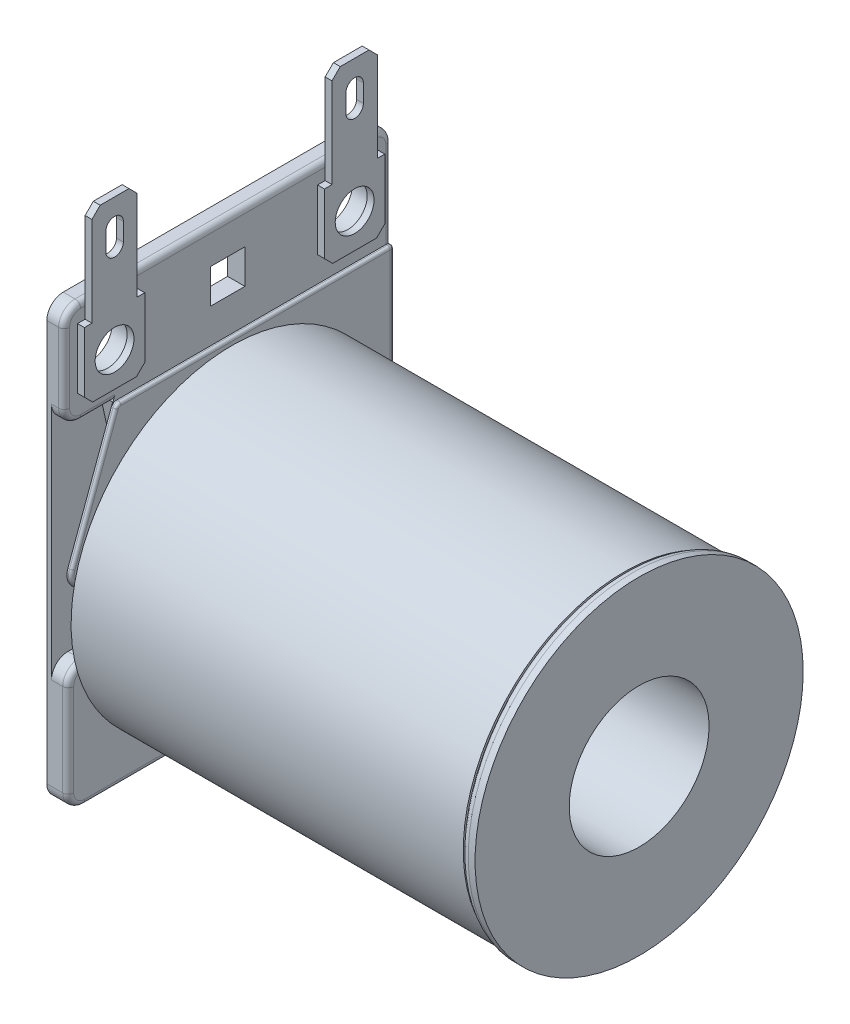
ISO-10303-21;
HEADER;
FILE_DESCRIPTION(('STEP AP214'),'2;1');
FILE_NAME('part.step','',(''),(''),'','','');
FILE_SCHEMA(('AUTOMOTIVE_DESIGN { 1 0 10303 214 1 1 1 1 }'));
ENDSEC;
DATA;
#1=APPLICATION_CONTEXT('core data for automotive mechanical design processes');
#2=APPLICATION_PROTOCOL_DEFINITION('international standard','automotive_design',2000,#1);
#3=PRODUCT_CONTEXT('',#1,'mechanical');
#4=PRODUCT('Part','Part','',(#3));
#5=PRODUCT_RELATED_PRODUCT_CATEGORY('part','',(#4));
#6=PRODUCT_DEFINITION_FORMATION('','',#4);
#7=PRODUCT_DEFINITION_CONTEXT('part definition',#1,'design');
#8=PRODUCT_DEFINITION('design','',#6,#7);
#9=PRODUCT_DEFINITION_SHAPE('','',#8);
#10=(LENGTH_UNIT() NAMED_UNIT(*) SI_UNIT(.MILLI.,.METRE.));
#11=(NAMED_UNIT(*) PLANE_ANGLE_UNIT() SI_UNIT($,.RADIAN.));
#12=(NAMED_UNIT(*) SI_UNIT($,.STERADIAN.) SOLID_ANGLE_UNIT());
#13=UNCERTAINTY_MEASURE_WITH_UNIT(LENGTH_MEASURE(1.E-05),#10,'distance_accuracy_value','');
#14=(GEOMETRIC_REPRESENTATION_CONTEXT(3) GLOBAL_UNCERTAINTY_ASSIGNED_CONTEXT((#13)) GLOBAL_UNIT_ASSIGNED_CONTEXT((#10,
#11,#12)) REPRESENTATION_CONTEXT('',''));
#15=CARTESIAN_POINT('',(0.,0.,0.));
#16=DIRECTION('',(0.,0.,1.));
#17=DIRECTION('',(1.,0.,0.));
#18=AXIS2_PLACEMENT_3D('',#15,#16,#17);
#19=CARTESIAN_POINT('',(2.2352,0.,0.));
#20=DIRECTION('',(-1.,0.,0.));
#21=DIRECTION('',(0.,0.,-1.));
#22=AXIS2_PLACEMENT_3D('',#19,#20,#21);
#23=PLANE('',#22);
#24=DIRECTION('',(0.,1.,0.));
#25=VECTOR('',#24,1.);
#26=CARTESIAN_POINT('',(2.2352,23.4061,-8.3185));
#27=LINE('',#26,#25);
#28=CARTESIAN_POINT('',(2.2352,17.8181,-8.3185));
#29=VERTEX_POINT('',#28);
#30=CARTESIAN_POINT('',(2.2352,23.4061,-8.3185));
#31=VERTEX_POINT('',#30);
#32=EDGE_CURVE('E536',#29,#31,#27,.T.);
#33=ORIENTED_EDGE('',*,*,#32,.F.);
#34=DIRECTION('',(0.,0.707106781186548,0.707106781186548));
#35=VECTOR('',#34,1.);
#36=CARTESIAN_POINT('',(2.2352,17.0561,-9.0805));
#37=LINE('',#36,#35);
#38=CARTESIAN_POINT('',(2.2352,17.0561,-9.0805));
#39=VERTEX_POINT('',#38);
#40=EDGE_CURVE('E1085',#29,#39,#37,.F.);
#41=ORIENTED_EDGE('',*,*,#40,.T.);
#42=DIRECTION('',(0.,0.,1.));
#43=VECTOR('',#42,1.);
#44=CARTESIAN_POINT('',(2.2352,17.0561,-13.9065));
#45=LINE('',#44,#43);
#46=CARTESIAN_POINT('',(2.2352,17.0561,-13.1445));
#47=VERTEX_POINT('',#46);
#48=EDGE_CURVE('E539',#47,#39,#45,.T.);
#49=ORIENTED_EDGE('',*,*,#48,.F.);
#50=DIRECTION('',(0.,-0.707106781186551,0.707106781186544));
#51=VECTOR('',#50,1.);
#52=CARTESIAN_POINT('',(2.2352,17.8181,-13.9065));
#53=LINE('',#52,#51);
#54=CARTESIAN_POINT('',(2.2352,17.8181,-13.9065));
#55=VERTEX_POINT('',#54);
#56=EDGE_CURVE('E1083',#47,#55,#53,.F.);
#57=ORIENTED_EDGE('',*,*,#56,.T.);
#58=DIRECTION('',(0.,-1.,0.));
#59=VECTOR('',#58,1.);
#60=CARTESIAN_POINT('',(2.2352,23.4061,-13.9065));
#61=LINE('',#60,#59);
#62=CARTESIAN_POINT('',(2.2352,23.4061,-13.9065));
#63=VERTEX_POINT('',#62);
#64=EDGE_CURVE('E542',#63,#55,#61,.T.);
#65=ORIENTED_EDGE('',*,*,#64,.F.);
#66=DIRECTION('',(0.,0.,-1.));
#67=VECTOR('',#66,1.);
#68=CARTESIAN_POINT('',(2.2352,23.4061,-13.9065));
#69=LINE('',#68,#67);
#70=CARTESIAN_POINT('',(2.2352,23.4061,-13.208));
#71=VERTEX_POINT('',#70);
#72=EDGE_CURVE('E545',#71,#63,#69,.T.);
#73=ORIENTED_EDGE('',*,*,#72,.F.);
#74=DIRECTION('',(0.,-1.,0.));
#75=VECTOR('',#74,1.);
#76=CARTESIAN_POINT('',(2.2352,32.4866,-13.208));
#77=LINE('',#76,#75);
#78=CARTESIAN_POINT('',(2.2352,31.7246,-13.208));
#79=VERTEX_POINT('',#78);
#80=EDGE_CURVE('E548',#79,#71,#77,.T.);
#81=ORIENTED_EDGE('',*,*,#80,.F.);
#82=DIRECTION('',(0.,-0.707106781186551,-0.707106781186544));
#83=VECTOR('',#82,1.);
#84=CARTESIAN_POINT('',(2.2352,32.4866,-12.446));
#85=LINE('',#84,#83);
#86=CARTESIAN_POINT('',(2.2352,32.4866,-12.446));
#87=VERTEX_POINT('',#86);
#88=EDGE_CURVE('E1079',#79,#87,#85,.F.);
#89=ORIENTED_EDGE('',*,*,#88,.T.);
#90=DIRECTION('',(0.,0.,-1.));
#91=VECTOR('',#90,1.);
#92=CARTESIAN_POINT('',(2.2352,32.4866,-13.208));
#93=LINE('',#92,#91);
#94=CARTESIAN_POINT('',(2.2352,32.4866,-9.779));
#95=VERTEX_POINT('',#94);
#96=EDGE_CURVE('E550',#95,#87,#93,.T.);
#97=ORIENTED_EDGE('',*,*,#96,.F.);
#98=DIRECTION('',(0.,0.707106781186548,-0.707106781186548));
#99=VECTOR('',#98,1.);
#100=CARTESIAN_POINT('',(2.2352,31.7246,-9.017));
#101=LINE('',#100,#99);
#102=CARTESIAN_POINT('',(2.2352,31.7246,-9.017));
#103=VERTEX_POINT('',#102);
#104=EDGE_CURVE('E1081',#95,#103,#101,.F.);
#105=ORIENTED_EDGE('',*,*,#104,.T.);
#106=DIRECTION('',(0.,1.,0.));
#107=VECTOR('',#106,1.);
#108=CARTESIAN_POINT('',(2.2352,32.4866,-9.017));
#109=LINE('',#108,#107);
#110=CARTESIAN_POINT('',(2.2352,23.4061,-9.017));
#111=VERTEX_POINT('',#110);
#112=EDGE_CURVE('E553',#111,#103,#109,.T.);
#113=ORIENTED_EDGE('',*,*,#112,.F.);
#114=DIRECTION('',(0.,0.,-1.));
#115=VECTOR('',#114,1.);
#116=CARTESIAN_POINT('',(2.2352,23.4061,-9.017));
#117=LINE('',#116,#115);
#118=EDGE_CURVE('E533',#31,#111,#117,.T.);
#119=ORIENTED_EDGE('',*,*,#118,.F.);
#120=EDGE_LOOP('',(#33,#41,#49,#57,#65,#73,#81,#89,#97,#105,#113,#119));
#121=FACE_BOUND('',#120,.T.);
#122=CARTESIAN_POINT('',(2.2352,20.2311,-11.1125));
#123=DIRECTION('',(-1.,0.,0.));
#124=DIRECTION('',(0.,0.,1.));
#125=AXIS2_PLACEMENT_3D('',#122,#123,#124);
#126=CIRCLE('',#125,1.79796878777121);
#127=CARTESIAN_POINT('',(2.2352,20.2311,-9.31453121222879));
#128=VERTEX_POINT('',#127);
#129=EDGE_CURVE('E527',#128,#128,#126,.T.);
#130=ORIENTED_EDGE('',*,*,#129,.T.);
#131=EDGE_LOOP('',(#130));
#132=FACE_BOUND('',#131,.T.);
#133=CARTESIAN_POINT('',(2.2352,30.1106671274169,-11.1125));
#134=DIRECTION('',(-1.,0.,0.));
#135=DIRECTION('',(0.,0.,1.));
#136=AXIS2_PLACEMENT_3D('',#133,#134,#135);
#137=CIRCLE('',#136,0.809964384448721);
#138=CARTESIAN_POINT('',(2.2352,30.1106671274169,-10.3025356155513));
#139=VERTEX_POINT('',#138);
#140=CARTESIAN_POINT('',(2.2352,30.1106671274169,-11.9224643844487));
#141=VERTEX_POINT('',#140);
#142=EDGE_CURVE('E514',#139,#141,#137,.T.);
#143=ORIENTED_EDGE('',*,*,#142,.T.);
#144=DIRECTION('',(0.,-1.,0.));
#145=VECTOR('',#144,1.);
#146=CARTESIAN_POINT('',(2.2352,30.1106671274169,-11.9224643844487));
#147=LINE('',#146,#145);
#148=CARTESIAN_POINT('',(2.2352,28.4666318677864,-11.9224643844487));
#149=VERTEX_POINT('',#148);
#150=EDGE_CURVE('E517',#141,#149,#147,.T.);
#151=ORIENTED_EDGE('',*,*,#150,.T.);
#152=CARTESIAN_POINT('',(2.2352,28.4666318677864,-11.1125));
#153=DIRECTION('',(-1.,0.,0.));
#154=DIRECTION('',(0.,0.,1.));
#155=AXIS2_PLACEMENT_3D('',#152,#153,#154);
#156=CIRCLE('',#155,0.809964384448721);
#157=CARTESIAN_POINT('',(2.2352,28.4666318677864,-10.3025356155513));
#158=VERTEX_POINT('',#157);
#159=EDGE_CURVE('E498',#149,#158,#156,.T.);
#160=ORIENTED_EDGE('',*,*,#159,.T.);
#161=DIRECTION('',(0.,1.,0.));
#162=VECTOR('',#161,1.);
#163=CARTESIAN_POINT('',(2.2352,30.1106671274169,-10.3025356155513));
#164=LINE('',#163,#162);
#165=EDGE_CURVE('E509',#158,#139,#164,.T.);
#166=ORIENTED_EDGE('',*,*,#165,.T.);
#167=EDGE_LOOP('',(#143,#151,#160,#166));
#168=FACE_BOUND('',#167,.T.);
#169=ADVANCED_FACE('F37',(#121,#132,#168),#23,.F.);
#170=CARTESIAN_POINT('',(1.6002,0.,0.));
#171=DIRECTION('',(-1.,0.,0.));
#172=DIRECTION('',(0.,0.,-1.));
#173=AXIS2_PLACEMENT_3D('',#170,#171,#172);
#174=PLANE('',#173);
#175=DIRECTION('',(0.,1.,0.));
#176=VECTOR('',#175,1.);
#177=CARTESIAN_POINT('',(1.6002,32.4866,-9.017));
#178=LINE('',#177,#176);
#179=CARTESIAN_POINT('',(1.6002,24.4856,-9.017));
#180=VERTEX_POINT('',#179);
#181=CARTESIAN_POINT('',(1.6002,31.7246,-9.017));
#182=VERTEX_POINT('',#181);
#183=EDGE_CURVE('E573',#180,#182,#178,.T.);
#184=ORIENTED_EDGE('',*,*,#183,.T.);
#185=DIRECTION('',(0.,-0.707106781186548,0.707106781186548));
#186=VECTOR('',#185,1.);
#187=CARTESIAN_POINT('',(1.6002,11.3538,11.3538));
#188=LINE('',#187,#186);
#189=CARTESIAN_POINT('',(1.6002,32.4866,-9.779));
#190=VERTEX_POINT('',#189);
#191=EDGE_CURVE('E60',#182,#190,#188,.F.);
#192=ORIENTED_EDGE('',*,*,#191,.T.);
#193=DIRECTION('',(0.,0.,-1.));
#194=VECTOR('',#193,1.);
#195=CARTESIAN_POINT('',(1.6002,32.4866,-13.208));
#196=LINE('',#195,#194);
#197=CARTESIAN_POINT('',(1.6002,32.4866,-12.446));
#198=VERTEX_POINT('',#197);
#199=EDGE_CURVE('E571',#190,#198,#196,.T.);
#200=ORIENTED_EDGE('',*,*,#199,.T.);
#201=DIRECTION('',(0.,0.707106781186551,0.707106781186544));
#202=VECTOR('',#201,1.);
#203=CARTESIAN_POINT('',(1.6002,22.4662999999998,-22.4663));
#204=LINE('',#203,#202);
#205=CARTESIAN_POINT('',(1.6002,31.7246,-13.208));
#206=VERTEX_POINT('',#205);
#207=EDGE_CURVE('E52',#198,#206,#204,.F.);
#208=ORIENTED_EDGE('',*,*,#207,.T.);
#209=DIRECTION('',(0.,-1.,0.));
#210=VECTOR('',#209,1.);
#211=CARTESIAN_POINT('',(1.6002,32.4866,-13.208));
#212=LINE('',#211,#210);
#213=CARTESIAN_POINT('',(1.6002,24.4856,-13.208));
#214=VERTEX_POINT('',#213);
#215=EDGE_CURVE('E569',#206,#214,#212,.T.);
#216=ORIENTED_EDGE('',*,*,#215,.T.);
#217=DIRECTION('',(0.,0.,-1.));
#218=VECTOR('',#217,1.);
#219=CARTESIAN_POINT('',(1.6002,24.4856,0.));
#220=LINE('',#219,#218);
#221=EDGE_CURVE('E858',#214,#180,#220,.F.);
#222=ORIENTED_EDGE('',*,*,#221,.T.);
#223=EDGE_LOOP('',(#184,#192,#200,#208,#216,#222));
#224=FACE_BOUND('',#223,.T.);
#225=DIRECTION('',(0.,1.,0.));
#226=VECTOR('',#225,1.);
#227=CARTESIAN_POINT('',(1.6002,0.,-11.9224643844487));
#228=LINE('',#227,#226);
#229=CARTESIAN_POINT('',(1.6002,28.4666318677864,-11.9224643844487));
#230=VERTEX_POINT('',#229);
#231=CARTESIAN_POINT('',(1.6002,30.1106671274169,-11.9224643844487));
#232=VERTEX_POINT('',#231);
#233=EDGE_CURVE('E1066',#230,#232,#228,.T.);
#234=ORIENTED_EDGE('',*,*,#233,.T.);
#235=CARTESIAN_POINT('',(1.6002,30.1106671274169,-11.1125));
#236=DIRECTION('',(-1.,0.,0.));
#237=DIRECTION('',(0.,0.,1.));
#238=AXIS2_PLACEMENT_3D('',#235,#236,#237);
#239=CIRCLE('',#238,0.809964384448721);
#240=CARTESIAN_POINT('',(1.6002,30.1106671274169,-10.3025356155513));
#241=VERTEX_POINT('',#240);
#242=EDGE_CURVE('E1069',#232,#241,#239,.F.);
#243=ORIENTED_EDGE('',*,*,#242,.T.);
#244=DIRECTION('',(0.,-1.,0.));
#245=VECTOR('',#244,1.);
#246=CARTESIAN_POINT('',(1.6002,0.,-10.3025356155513));
#247=LINE('',#246,#245);
#248=CARTESIAN_POINT('',(1.6002,28.4666318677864,-10.3025356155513));
#249=VERTEX_POINT('',#248);
#250=EDGE_CURVE('E1063',#241,#249,#247,.T.);
#251=ORIENTED_EDGE('',*,*,#250,.T.);
#252=CARTESIAN_POINT('',(1.6002,28.4666318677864,-11.1125));
#253=DIRECTION('',(-1.,0.,0.));
#254=DIRECTION('',(0.,0.,1.));
#255=AXIS2_PLACEMENT_3D('',#252,#253,#254);
#256=CIRCLE('',#255,0.809964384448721);
#257=EDGE_CURVE('E501',#249,#230,#256,.F.);
#258=ORIENTED_EDGE('',*,*,#257,.T.);
#259=EDGE_LOOP('',(#234,#243,#251,#258));
#260=FACE_BOUND('',#259,.T.);
#261=ADVANCED_FACE('F1141',(#224,#260),#174,.T.);
#262=CARTESIAN_POINT('',(1.6002,0.,0.));
#263=DIRECTION('',(-1.,0.,0.));
#264=DIRECTION('',(0.,0.,1.));
#265=AXIS2_PLACEMENT_3D('',#262,#263,#264);
#266=PLANE('',#265);
#267=DIRECTION('',(0.,0.,1.));
#268=VECTOR('',#267,1.);
#269=CARTESIAN_POINT('',(1.6002,21.8186,-1.5875));
#270=LINE('',#269,#268);
#271=CARTESIAN_POINT('',(1.6002,21.8186,-1.5875));
#272=VERTEX_POINT('',#271);
#273=CARTESIAN_POINT('',(1.6002,21.8186,1.5875));
#274=VERTEX_POINT('',#273);
#275=EDGE_CURVE('E698',#272,#274,#270,.T.);
#276=ORIENTED_EDGE('',*,*,#275,.F.);
#277=DIRECTION('',(0.,1.,0.));
#278=VECTOR('',#277,1.);
#279=CARTESIAN_POINT('',(1.6002,18.6436,-1.5875));
#280=LINE('',#279,#278);
#281=CARTESIAN_POINT('',(1.6002,18.6436,-1.5875));
#282=VERTEX_POINT('',#281);
#283=EDGE_CURVE('E702',#282,#272,#280,.T.);
#284=ORIENTED_EDGE('',*,*,#283,.F.);
#285=DIRECTION('',(0.,0.,-1.));
#286=VECTOR('',#285,1.);
#287=CARTESIAN_POINT('',(1.6002,18.6436,-1.5875));
#288=LINE('',#287,#286);
#289=CARTESIAN_POINT('',(1.6002,18.6436,1.5875));
#290=VERTEX_POINT('',#289);
#291=EDGE_CURVE('E705',#290,#282,#288,.T.);
#292=ORIENTED_EDGE('',*,*,#291,.F.);
#293=DIRECTION('',(0.,-1.,0.));
#294=VECTOR('',#293,1.);
#295=CARTESIAN_POINT('',(1.6002,18.6436,1.5875));
#296=LINE('',#295,#294);
#297=EDGE_CURVE('E708',#274,#290,#296,.T.);
#298=ORIENTED_EDGE('',*,*,#297,.F.);
#299=EDGE_LOOP('',(#276,#284,#292,#298));
#300=FACE_BOUND('',#299,.T.);
#301=CARTESIAN_POINT('',(1.6002,24.4856,-13.6271));
#302=VERTEX_POINT('',#301);
#303=EDGE_CURVE('E854',#302,#214,#220,.F.);
#304=ORIENTED_EDGE('',*,*,#303,.T.);
#305=CARTESIAN_POINT('',(1.6002,23.4061,-13.208));
#306=VERTEX_POINT('',#305);
#307=EDGE_CURVE('E568',#214,#306,#212,.T.);
#308=ORIENTED_EDGE('',*,*,#307,.T.);
#309=DIRECTION('',(0.,0.,-1.));
#310=VECTOR('',#309,1.);
#311=CARTESIAN_POINT('',(1.6002,23.4061,-13.9065));
#312=LINE('',#311,#310);
#313=CARTESIAN_POINT('',(1.6002,23.4061,-13.9065));
#314=VERTEX_POINT('',#313);
#315=EDGE_CURVE('E566',#306,#314,#312,.T.);
#316=ORIENTED_EDGE('',*,*,#315,.T.);
#317=DIRECTION('',(0.,-1.,0.));
#318=VECTOR('',#317,1.);
#319=CARTESIAN_POINT('',(1.6002,23.4061,-13.9065));
#320=LINE('',#319,#318);
#321=CARTESIAN_POINT('',(1.6002,17.8181,-13.9065));
#322=VERTEX_POINT('',#321);
#323=EDGE_CURVE('E563',#314,#322,#320,.T.);
#324=ORIENTED_EDGE('',*,*,#323,.T.);
#325=DIRECTION('',(0.,0.707106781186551,-0.707106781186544));
#326=VECTOR('',#325,1.);
#327=CARTESIAN_POINT('',(1.6002,1.95579999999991,1.95579999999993));
#328=LINE('',#327,#326);
#329=CARTESIAN_POINT('',(1.6002,17.0561,-13.1445));
#330=VERTEX_POINT('',#329);
#331=EDGE_CURVE('E11',#322,#330,#328,.F.);
#332=ORIENTED_EDGE('',*,*,#331,.T.);
#333=DIRECTION('',(0.,0.,1.));
#334=VECTOR('',#333,1.);
#335=CARTESIAN_POINT('',(1.6002,17.0561,-13.9065));
#336=LINE('',#335,#334);
#337=CARTESIAN_POINT('',(1.6002,17.0561,-9.0805));
#338=VERTEX_POINT('',#337);
#339=EDGE_CURVE('E560',#330,#338,#336,.T.);
#340=ORIENTED_EDGE('',*,*,#339,.T.);
#341=DIRECTION('',(0.,-0.707106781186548,-0.707106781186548));
#342=VECTOR('',#341,1.);
#343=CARTESIAN_POINT('',(1.6002,13.0683,-13.0683));
#344=LINE('',#343,#342);
#345=CARTESIAN_POINT('',(1.6002,17.8181,-8.3185));
#346=VERTEX_POINT('',#345);
#347=EDGE_CURVE('E45',#338,#346,#344,.F.);
#348=ORIENTED_EDGE('',*,*,#347,.T.);
#349=DIRECTION('',(0.,1.,0.));
#350=VECTOR('',#349,1.);
#351=CARTESIAN_POINT('',(1.6002,23.4061,-8.3185));
#352=LINE('',#351,#350);
#353=CARTESIAN_POINT('',(1.6002,23.4061,-8.3185));
#354=VERTEX_POINT('',#353);
#355=EDGE_CURVE('E558',#346,#354,#352,.T.);
#356=ORIENTED_EDGE('',*,*,#355,.T.);
#357=DIRECTION('',(0.,0.,-1.));
#358=VECTOR('',#357,1.);
#359=CARTESIAN_POINT('',(1.6002,23.4061,-9.017));
#360=LINE('',#359,#358);
#361=CARTESIAN_POINT('',(1.6002,23.4061,-9.017));
#362=VERTEX_POINT('',#361);
#363=EDGE_CURVE('E530',#354,#362,#360,.T.);
#364=ORIENTED_EDGE('',*,*,#363,.T.);
#365=EDGE_CURVE('E537',#362,#180,#178,.T.);
#366=ORIENTED_EDGE('',*,*,#365,.T.);
#367=CARTESIAN_POINT('',(1.6002,24.4856,9.017));
#368=VERTEX_POINT('',#367);
#369=EDGE_CURVE('E859',#180,#368,#220,.F.);
#370=ORIENTED_EDGE('',*,*,#369,.T.);
#371=DIRECTION('',(0.,1.,0.));
#372=VECTOR('',#371,1.);
#373=CARTESIAN_POINT('',(1.6002,32.4866,9.017));
#374=LINE('',#373,#372);
#375=CARTESIAN_POINT('',(1.6002,23.4061,9.017));
#376=VERTEX_POINT('',#375);
#377=EDGE_CURVE('E643',#376,#368,#374,.T.);
#378=ORIENTED_EDGE('',*,*,#377,.F.);
#379=DIRECTION('',(0.,0.,1.));
#380=VECTOR('',#379,1.);
#381=CARTESIAN_POINT('',(1.6002,23.4061,9.017));
#382=LINE('',#381,#380);
#383=CARTESIAN_POINT('',(1.6002,23.4061,8.3185));
#384=VERTEX_POINT('',#383);
#385=EDGE_CURVE('E614',#384,#376,#382,.T.);
#386=ORIENTED_EDGE('',*,*,#385,.F.);
#387=DIRECTION('',(0.,1.,0.));
#388=VECTOR('',#387,1.);
#389=CARTESIAN_POINT('',(1.6002,23.4061,8.3185));
#390=LINE('',#389,#388);
#391=CARTESIAN_POINT('',(1.6002,17.8181,8.3185));
#392=VERTEX_POINT('',#391);
#393=EDGE_CURVE('E621',#392,#384,#390,.T.);
#394=ORIENTED_EDGE('',*,*,#393,.F.);
#395=DIRECTION('',(0.,0.707106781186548,-0.707106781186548));
#396=VECTOR('',#395,1.);
#397=CARTESIAN_POINT('',(1.6002,13.0683,13.0683));
#398=LINE('',#397,#396);
#399=CARTESIAN_POINT('',(1.6002,17.0561,9.0805));
#400=VERTEX_POINT('',#399);
#401=EDGE_CURVE('E1059',#392,#400,#398,.F.);
#402=ORIENTED_EDGE('',*,*,#401,.T.);
#403=DIRECTION('',(0.,0.,-1.));
#404=VECTOR('',#403,1.);
#405=CARTESIAN_POINT('',(1.6002,17.0561,13.9065));
#406=LINE('',#405,#404);
#407=CARTESIAN_POINT('',(1.6002,17.0561,13.1445));
#408=VERTEX_POINT('',#407);
#409=EDGE_CURVE('E658',#408,#400,#406,.T.);
#410=ORIENTED_EDGE('',*,*,#409,.F.);
#411=DIRECTION('',(0.,-0.707106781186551,-0.707106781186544));
#412=VECTOR('',#411,1.);
#413=CARTESIAN_POINT('',(1.6002,1.95579999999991,-1.95579999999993));
#414=LINE('',#413,#412);
#415=CARTESIAN_POINT('',(1.6002,17.8181,13.9065));
#416=VERTEX_POINT('',#415);
#417=EDGE_CURVE('E1061',#408,#416,#414,.F.);
#418=ORIENTED_EDGE('',*,*,#417,.T.);
#419=DIRECTION('',(0.,-1.,0.));
#420=VECTOR('',#419,1.);
#421=CARTESIAN_POINT('',(1.6002,23.4061,13.9065));
#422=LINE('',#421,#420);
#423=CARTESIAN_POINT('',(1.6002,23.4061,13.9065));
#424=VERTEX_POINT('',#423);
#425=EDGE_CURVE('E655',#424,#416,#422,.T.);
#426=ORIENTED_EDGE('',*,*,#425,.F.);
#427=DIRECTION('',(0.,0.,1.));
#428=VECTOR('',#427,1.);
#429=CARTESIAN_POINT('',(1.6002,23.4061,13.9065));
#430=LINE('',#429,#428);
#431=CARTESIAN_POINT('',(1.6002,23.4061,13.208));
#432=VERTEX_POINT('',#431);
#433=EDGE_CURVE('E652',#432,#424,#430,.T.);
#434=ORIENTED_EDGE('',*,*,#433,.F.);
#435=DIRECTION('',(0.,-1.,0.));
#436=VECTOR('',#435,1.);
#437=CARTESIAN_POINT('',(1.6002,32.4866,13.208));
#438=LINE('',#437,#436);
#439=CARTESIAN_POINT('',(1.6002,24.4856,13.208));
#440=VERTEX_POINT('',#439);
#441=EDGE_CURVE('E649',#440,#432,#438,.T.);
#442=ORIENTED_EDGE('',*,*,#441,.F.);
#443=CARTESIAN_POINT('',(1.6002,24.4856,13.6271));
#444=VERTEX_POINT('',#443);
#445=EDGE_CURVE('E853',#440,#444,#220,.F.);
#446=ORIENTED_EDGE('',*,*,#445,.T.);
#447=CARTESIAN_POINT('',(1.6002,23.4696,13.6271));
#448=DIRECTION('',(-1.,0.,0.));
#449=DIRECTION('',(0.,0.,1.));
#450=AXIS2_PLACEMENT_3D('',#447,#448,#449);
#451=CIRCLE('',#450,1.016);
#452=CARTESIAN_POINT('',(1.6002,23.4696,14.6431));
#453=VERTEX_POINT('',#452);
#454=EDGE_CURVE('E851',#444,#453,#451,.F.);
#455=ORIENTED_EDGE('',*,*,#454,.T.);
#456=DIRECTION('',(0.,1.,0.));
#457=VECTOR('',#456,1.);
#458=CARTESIAN_POINT('',(1.6002,0.,14.6431));
#459=LINE('',#458,#457);
#460=CARTESIAN_POINT('',(1.6002,16.9926,14.6431));
#461=VERTEX_POINT('',#460);
#462=EDGE_CURVE('E849',#453,#461,#459,.F.);
#463=ORIENTED_EDGE('',*,*,#462,.T.);
#464=CARTESIAN_POINT('',(1.6002,16.9926,13.6271));
#465=DIRECTION('',(-1.,0.,0.));
#466=DIRECTION('',(0.,0.,1.));
#467=AXIS2_PLACEMENT_3D('',#464,#465,#466);
#468=CIRCLE('',#467,1.016);
#469=CARTESIAN_POINT('',(1.6002,15.9766,13.6271));
#470=VERTEX_POINT('',#469);
#471=EDGE_CURVE('E847',#461,#470,#468,.F.);
#472=ORIENTED_EDGE('',*,*,#471,.T.);
#473=DIRECTION('',(0.,0.,-1.));
#474=VECTOR('',#473,1.);
#475=CARTESIAN_POINT('',(1.6002,15.9766,0.));
#476=LINE('',#475,#474);
#477=CARTESIAN_POINT('',(1.6002,15.9766,10.4428112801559));
#478=VERTEX_POINT('',#477);
#479=EDGE_CURVE('E844',#470,#478,#476,.T.);
#480=ORIENTED_EDGE('',*,*,#479,.T.);
#481=DIRECTION('',(0.,-0.938384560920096,0.345592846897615));
#482=VECTOR('',#481,1.);
#483=CARTESIAN_POINT('',(1.6002,5.29474905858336,14.376775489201));
#484=LINE('',#483,#482);
#485=CARTESIAN_POINT('',(1.6002,15.136161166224,10.7523321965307));
#486=VERTEX_POINT('',#485);
#487=EDGE_CURVE('E841',#478,#486,#484,.T.);
#488=ORIENTED_EDGE('',*,*,#487,.T.);
#489=CARTESIAN_POINT('',(1.6002,14.9606,10.2756328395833));
#490=DIRECTION('',(-1.,0.,0.));
#491=DIRECTION('',(0.,0.,1.));
#492=AXIS2_PLACEMENT_3D('',#489,#490,#491);
#493=CIRCLE('',#492,0.508);
#494=CARTESIAN_POINT('',(1.6002,15.4686,10.2756328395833));
#495=VERTEX_POINT('',#494);
#496=EDGE_CURVE('E1795',#486,#495,#493,.T.);
#497=ORIENTED_EDGE('',*,*,#496,.T.);
#498=DIRECTION('',(0.,0.,-1.));
#499=VECTOR('',#498,1.);
#500=CARTESIAN_POINT('',(1.6002,15.4686,19.6984510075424));
#501=LINE('',#500,#499);
#502=CARTESIAN_POINT('',(1.6002,15.4686,-14.6431));
#503=VERTEX_POINT('',#502);
#504=EDGE_CURVE('E695',#495,#503,#501,.T.);
#505=ORIENTED_EDGE('',*,*,#504,.T.);
#506=DIRECTION('',(0.,-1.,0.));
#507=VECTOR('',#506,1.);
#508=CARTESIAN_POINT('',(1.6002,0.,-14.6431));
#509=LINE('',#508,#507);
#510=CARTESIAN_POINT('',(1.6002,23.4696,-14.6431));
#511=VERTEX_POINT('',#510);
#512=EDGE_CURVE('E862',#503,#511,#509,.F.);
#513=ORIENTED_EDGE('',*,*,#512,.T.);
#514=CARTESIAN_POINT('',(1.6002,23.4696,-13.6271));
#515=DIRECTION('',(-1.,0.,0.));
#516=DIRECTION('',(0.,0.,1.));
#517=AXIS2_PLACEMENT_3D('',#514,#515,#516);
#518=CIRCLE('',#517,1.016);
#519=EDGE_CURVE('E857',#511,#302,#518,.F.);
#520=ORIENTED_EDGE('',*,*,#519,.T.);
#521=EDGE_LOOP('',(#304,#308,#316,#324,#332,#340,#348,#356,#364,#366,#370,#378,#386,#394,#402,
#410,#418,#426,#434,#442,#446,#455,#463,#472,#480,#488,#497,#505,#513,#520));
#522=FACE_BOUND('',#521,.T.);
#523=ADVANCED_FACE('F1102',(#300,#522),#266,.F.);
#524=CARTESIAN_POINT('',(39.6875,0.,0.));
#525=DIRECTION('',(-1.,0.,0.));
#526=DIRECTION('',(0.,0.,1.));
#527=AXIS2_PLACEMENT_3D('',#524,#525,#526);
#528=CYLINDRICAL_SURFACE('',#527,7.239);
#529=CARTESIAN_POINT('',(1.9812,0.,0.));
#530=DIRECTION('',(1.,0.,0.));
#531=DIRECTION('',(0.,0.,-1.));
#532=AXIS2_PLACEMENT_3D('',#529,#530,#531);
#533=CIRCLE('',#532,7.239);
#534=CARTESIAN_POINT('',(1.9812,0.266808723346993,7.23408142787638));
#535=VERTEX_POINT('',#534);
#536=CARTESIAN_POINT('',(1.9812,-4.1148,5.95579901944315));
#537=VERTEX_POINT('',#536);
#538=EDGE_CURVE('E676',#535,#537,#533,.T.);
#539=ORIENTED_EDGE('',*,*,#538,.F.);
#540=CARTESIAN_POINT('',(1.9812,0.266808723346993,7.23408142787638));
#541=CARTESIAN_POINT('',(1.98120912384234,0.25128978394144,7.23465572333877));
#542=CARTESIAN_POINT('',(1.979895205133,0.235771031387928,7.23517621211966));
#543=CARTESIAN_POINT('',(1.97470195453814,0.205159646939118,7.23610790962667));
#544=CARTESIAN_POINT('',(1.97082172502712,0.190067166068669,7.23651908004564));
#545=CARTESIAN_POINT('',(1.96057313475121,0.160735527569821,7.23723031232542));
#546=CARTESIAN_POINT('',(1.9542030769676,0.146496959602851,7.23753029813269));
#547=CARTESIAN_POINT('',(1.93912662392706,0.119317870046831,7.23802932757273));
#548=CARTESIAN_POINT('',(1.9304212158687,0.106376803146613,7.23822841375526));
#549=CARTESIAN_POINT('',(1.91104884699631,0.0824159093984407,7.2385406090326));
#550=CARTESIAN_POINT('',(1.90041775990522,0.0713671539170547,7.23865512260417));
#551=CARTESIAN_POINT('',(1.87736762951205,0.0513142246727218,7.23882508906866));
#552=CARTESIAN_POINT('',(1.8649485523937,0.042310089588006,7.23888054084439));
#553=CARTESIAN_POINT('',(1.83929507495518,0.0270660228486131,7.23895324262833));
#554=CARTESIAN_POINT('',(1.82612539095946,0.0207170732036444,7.23897214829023));
#555=CARTESIAN_POINT('',(1.79887624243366,0.0104582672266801,7.23899428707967));
#556=CARTESIAN_POINT('',(1.78479807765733,0.00654500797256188,7.23899754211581));
#557=CARTESIAN_POINT('',(1.76335323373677,0.00262250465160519,7.2389996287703));
#558=CARTESIAN_POINT('',(1.75615271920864,0.00163957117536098,7.23899985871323));
#559=CARTESIAN_POINT('',(1.74170276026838,0.000328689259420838,7.23900000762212));
#560=CARTESIAN_POINT('',(1.73445340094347,-1.97484705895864E-07,7.23899992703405));
#561=CARTESIAN_POINT('',(1.7272,0.,7.23900000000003));
#562=B_SPLINE_CURVE_WITH_KNOTS('',3,(#540,#541,#542,#543,#544,#545,#546,#547,#548,#549,#550,
#551,#552,#553,#554,#555,#556,#557,#558,#559,#560,#561),.UNSPECIFIED.,.F.,.F.,(4,2,2,2,2,2,2,2,
2,2,4),(0.,0.0465307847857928,0.0930778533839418,0.139656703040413,0.186215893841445,
0.23198334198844,0.277751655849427,0.321392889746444,0.364973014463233,0.386749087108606,
0.408493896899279),.UNSPECIFIED.);
#563=CARTESIAN_POINT('',(1.7272,0.,7.239));
#564=VERTEX_POINT('',#563);
#565=EDGE_CURVE('E1015',#535,#564,#562,.T.);
#566=ORIENTED_EDGE('',*,*,#565,.T.);
#567=DIRECTION('',(-1.,0.,0.));
#568=VECTOR('',#567,1.);
#569=CARTESIAN_POINT('',(2.7178,0.,7.239));
#570=LINE('',#569,#568);
#571=CARTESIAN_POINT('',(1.5748,0.,7.239));
#572=VERTEX_POINT('',#571);
#573=EDGE_CURVE('E747',#564,#572,#570,.T.);
#574=ORIENTED_EDGE('',*,*,#573,.T.);
#575=DIRECTION('',(-1.,0.,0.));
#576=VECTOR('',#575,1.);
#577=CARTESIAN_POINT('',(1.5748,0.,7.239));
#578=LINE('',#577,#576);
#579=CARTESIAN_POINT('',(0.4318,0.,7.239));
#580=VERTEX_POINT('',#579);
#581=EDGE_CURVE('E773',#572,#580,#578,.T.);
#582=ORIENTED_EDGE('',*,*,#581,.T.);
#583=CARTESIAN_POINT('',(0.4318,0.,0.));
#584=DIRECTION('',(1.,0.,0.));
#585=DIRECTION('',(0.,0.,1.));
#586=AXIS2_PLACEMENT_3D('',#583,#584,#585);
#587=CIRCLE('',#586,7.239);
#588=CARTESIAN_POINT('',(0.4318,-3.6068,6.27647311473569));
#589=VERTEX_POINT('',#588);
#590=EDGE_CURVE('E765',#580,#589,#587,.T.);
#591=ORIENTED_EDGE('',*,*,#590,.T.);
#592=DIRECTION('',(-1.,0.,0.));
#593=VECTOR('',#592,1.);
#594=CARTESIAN_POINT('',(1.5748,-3.6068,6.27647311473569));
#595=LINE('',#594,#593);
#596=CARTESIAN_POINT('',(1.4732,-3.6068,6.27647311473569));
#597=VERTEX_POINT('',#596);
#598=EDGE_CURVE('E770',#597,#589,#595,.T.);
#599=ORIENTED_EDGE('',*,*,#598,.F.);
#600=CARTESIAN_POINT('',(1.4732,-3.6068,6.27647311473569));
#601=CARTESIAN_POINT('',(1.49895114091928,-3.60676618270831,6.27648795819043));
#602=CARTESIAN_POINT('',(1.52467640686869,-3.608755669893,6.27534928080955));
#603=CARTESIAN_POINT('',(1.57525413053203,-3.61651148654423,6.27088515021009));
#604=CARTESIAN_POINT('',(1.60010967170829,-3.62226265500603,6.26756847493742));
#605=CARTESIAN_POINT('',(1.64832861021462,-3.63727091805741,6.2588698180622));
#606=CARTESIAN_POINT('',(1.67169299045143,-3.64652567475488,6.25348921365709));
#607=CARTESIAN_POINT('',(1.71641246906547,-3.66811405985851,6.24085068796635));
#608=CARTESIAN_POINT('',(1.73776606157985,-3.68044997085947,6.23359137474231));
#609=CARTESIAN_POINT('',(1.77896514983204,-3.70832926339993,6.21704820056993));
#610=CARTESIAN_POINT('',(1.79869764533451,-3.72399315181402,6.20768718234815));
#611=CARTESIAN_POINT('',(1.83522493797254,-3.75756360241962,6.18742445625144));
#612=CARTESIAN_POINT('',(1.85201950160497,-3.77547034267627,6.17652262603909));
#613=CARTESIAN_POINT('',(1.88442812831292,-3.81531067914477,6.15200260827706));
#614=CARTESIAN_POINT('',(1.89963800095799,-3.83746830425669,6.13821522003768));
#615=CARTESIAN_POINT('',(1.92614510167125,-3.88326888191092,6.10934377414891));
#616=CARTESIAN_POINT('',(1.93743571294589,-3.90691426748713,6.09425757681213));
#617=CARTESIAN_POINT('',(1.95840305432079,-3.96093782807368,6.05931929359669));
#618=CARTESIAN_POINT('',(1.96701916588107,-3.9915546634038,6.03920055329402));
#619=CARTESIAN_POINT('',(1.97841095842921,-4.05312693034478,5.99805751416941));
#620=CARTESIAN_POINT('',(1.98120539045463,-4.08408095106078,5.97703634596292));
#621=CARTESIAN_POINT('',(1.9812,-4.1148,5.95579901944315));
#622=B_SPLINE_CURVE_WITH_KNOTS('',3,(#600,#601,#602,#603,#604,#605,#606,#607,#608,#609,#610,
#611,#612,#613,#614,#615,#616,#617,#618,#619,#620,#621),.UNSPECIFIED.,.F.,.F.,(4,2,2,2,2,2,2,2,
2,2,4),(0.,0.0771110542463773,0.153913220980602,0.230664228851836,0.307472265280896,
0.387778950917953,0.4680920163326,0.558357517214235,0.648774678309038,0.761185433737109,
0.873233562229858),.UNSPECIFIED.);
#623=EDGE_CURVE('E943',#597,#537,#622,.T.);
#624=ORIENTED_EDGE('',*,*,#623,.T.);
#625=EDGE_LOOP('',(#539,#566,#574,#582,#591,#599,#624));
#626=FACE_BOUND('',#625,.T.);
#627=ADVANCED_FACE('F953',(#626),#528,.T.);
#628=CARTESIAN_POINT('',(1.9812,0.,0.));
#629=DIRECTION('',(-1.,0.,0.));
#630=DIRECTION('',(0.,0.,1.));
#631=AXIS2_PLACEMENT_3D('',#628,#629,#630);
#632=PLANE('',#631);
#633=CARTESIAN_POINT('',(1.9812,0.,0.));
#634=DIRECTION('',(1.,0.,0.));
#635=DIRECTION('',(0.,0.,-1.));
#636=AXIS2_PLACEMENT_3D('',#633,#634,#635);
#637=CIRCLE('',#636,14.8844);
#638=CARTESIAN_POINT('',(1.9812,-4.32267713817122,14.2428868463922));
#639=VERTEX_POINT('',#638);
#640=CARTESIAN_POINT('',(1.9812,-14.6812,2.45106709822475));
#641=VERTEX_POINT('',#640);
#642=EDGE_CURVE('E2289',#639,#641,#637,.T.);
#643=ORIENTED_EDGE('',*,*,#642,.F.);
#644=CARTESIAN_POINT('',(1.9812,-5.1308,13.6271));
#645=DIRECTION('',(-1.,0.,0.));
#646=DIRECTION('',(0.,0.,1.));
#647=AXIS2_PLACEMENT_3D('',#644,#645,#646);
#648=CIRCLE('',#647,1.016);
#649=CARTESIAN_POINT('',(1.9812,-5.1308,14.6431));
#650=VERTEX_POINT('',#649);
#651=EDGE_CURVE('E922',#639,#650,#648,.F.);
#652=ORIENTED_EDGE('',*,*,#651,.T.);
#653=DIRECTION('',(0.,-1.,0.));
#654=VECTOR('',#653,1.);
#655=CARTESIAN_POINT('',(1.9812,0.,14.6431));
#656=LINE('',#655,#654);
#657=CARTESIAN_POINT('',(1.9812,-13.6652,14.6431));
#658=VERTEX_POINT('',#657);
#659=EDGE_CURVE('E920',#650,#658,#656,.T.);
#660=ORIENTED_EDGE('',*,*,#659,.T.);
#661=CARTESIAN_POINT('',(1.9812,-13.6652,13.6271));
#662=DIRECTION('',(-1.,0.,0.));
#663=DIRECTION('',(0.,0.,1.));
#664=AXIS2_PLACEMENT_3D('',#661,#662,#663);
#665=CIRCLE('',#664,1.016);
#666=CARTESIAN_POINT('',(1.9812,-14.6812,13.6271));
#667=VERTEX_POINT('',#666);
#668=EDGE_CURVE('E918',#658,#667,#665,.F.);
#669=ORIENTED_EDGE('',*,*,#668,.T.);
#670=DIRECTION('',(0.,0.,-1.));
#671=VECTOR('',#670,1.);
#672=CARTESIAN_POINT('',(1.9812,-14.6812,0.));
#673=LINE('',#672,#671);
#674=EDGE_CURVE('E915',#667,#641,#673,.T.);
#675=ORIENTED_EDGE('',*,*,#674,.T.);
#676=EDGE_LOOP('',(#643,#652,#660,#669,#675));
#677=FACE_BOUND('',#676,.T.);
#678=ADVANCED_FACE('F1611',(#677),#632,.F.);
#679=CARTESIAN_POINT('',(1.9812,-14.6812,-2.45106709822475));
#680=VERTEX_POINT('',#679);
#681=CARTESIAN_POINT('',(1.9812,-2.6692668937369,-14.6431));
#682=VERTEX_POINT('',#681);
#683=EDGE_CURVE('E2293',#680,#682,#637,.T.);
#684=ORIENTED_EDGE('',*,*,#683,.F.);
#685=CARTESIAN_POINT('',(1.9812,-14.6812,-13.6271));
#686=VERTEX_POINT('',#685);
#687=EDGE_CURVE('E914',#680,#686,#673,.T.);
#688=ORIENTED_EDGE('',*,*,#687,.T.);
#689=CARTESIAN_POINT('',(1.9812,-13.6652,-13.6271));
#690=DIRECTION('',(-1.,0.,0.));
#691=DIRECTION('',(0.,0.,1.));
#692=AXIS2_PLACEMENT_3D('',#689,#690,#691);
#693=CIRCLE('',#692,1.016);
#694=CARTESIAN_POINT('',(1.9812,-13.6652,-14.6431));
#695=VERTEX_POINT('',#694);
#696=EDGE_CURVE('E912',#686,#695,#693,.F.);
#697=ORIENTED_EDGE('',*,*,#696,.T.);
#698=DIRECTION('',(0.,1.,0.));
#699=VECTOR('',#698,1.);
#700=CARTESIAN_POINT('',(1.9812,0.,-14.6431));
#701=LINE('',#700,#699);
#702=EDGE_CURVE('E909',#695,#682,#701,.T.);
#703=ORIENTED_EDGE('',*,*,#702,.T.);
#704=EDGE_LOOP('',(#684,#688,#697,#703));
#705=FACE_BOUND('',#704,.T.);
#706=ADVANCED_FACE('F1626',(#705),#632,.F.);
#707=CARTESIAN_POINT('',(1.9812,2.6692668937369,-14.6431));
#708=VERTEX_POINT('',#707);
#709=CARTESIAN_POINT('',(1.9812,3.24741275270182,14.5258278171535));
#710=VERTEX_POINT('',#709);
#711=EDGE_CURVE('E681',#708,#710,#637,.T.);
#712=ORIENTED_EDGE('',*,*,#711,.F.);
#713=CARTESIAN_POINT('',(1.9812,15.2146,-14.6431));
#714=VERTEX_POINT('',#713);
#715=EDGE_CURVE('E908',#708,#714,#701,.T.);
#716=ORIENTED_EDGE('',*,*,#715,.T.);
#717=DIRECTION('',(0.,0.,-1.));
#718=VECTOR('',#717,1.);
#719=CARTESIAN_POINT('',(1.9812,15.2146,0.));
#720=LINE('',#719,#718);
#721=CARTESIAN_POINT('',(1.9812,15.2146,10.2756328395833));
#722=VERTEX_POINT('',#721);
#723=EDGE_CURVE('E2242',#714,#722,#720,.F.);
#724=ORIENTED_EDGE('',*,*,#723,.T.);
#725=CARTESIAN_POINT('',(1.9812,14.9606,10.2756328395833));
#726=DIRECTION('',(-1.,0.,0.));
#727=DIRECTION('',(0.,0.,1.));
#728=AXIS2_PLACEMENT_3D('',#725,#726,#727);
#729=CIRCLE('',#728,0.254);
#730=CARTESIAN_POINT('',(1.9812,15.048380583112,10.513982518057));
#731=VERTEX_POINT('',#730);
#732=EDGE_CURVE('E1813',#722,#731,#729,.F.);
#733=ORIENTED_EDGE('',*,*,#732,.T.);
#734=DIRECTION('',(0.,-0.938384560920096,0.345592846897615));
#735=VECTOR('',#734,1.);
#736=CARTESIAN_POINT('',(1.9812,5.20696847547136,14.1384258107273));
#737=LINE('',#736,#735);
#738=CARTESIAN_POINT('',(1.9812,4.13999733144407,14.5313751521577));
#739=VERTEX_POINT('',#738);
#740=EDGE_CURVE('E2223',#731,#739,#737,.T.);
#741=ORIENTED_EDGE('',*,*,#740,.T.);
#742=CARTESIAN_POINT('',(1.9812,3.70109441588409,13.3396267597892));
#743=DIRECTION('',(-1.,0.,0.));
#744=DIRECTION('',(0.,0.,1.));
#745=AXIS2_PLACEMENT_3D('',#742,#743,#744);
#746=CIRCLE('',#745,1.27);
#747=EDGE_CURVE('E2220',#739,#710,#746,.F.);
#748=ORIENTED_EDGE('',*,*,#747,.T.);
#749=EDGE_LOOP('',(#712,#716,#724,#733,#741,#748));
#750=FACE_BOUND('',#749,.T.);
#751=ADVANCED_FACE('F1629',(#750),#632,.F.);
#752=CARTESIAN_POINT('',(1.9812,-15.1892,15.1511));
#753=DIRECTION('',(0.,0.,-1.));
#754=DIRECTION('',(-1.,0.,0.));
#755=AXIS2_PLACEMENT_3D('',#752,#753,#754);
#756=PLANE('',#755);
#757=DIRECTION('',(-1.,0.,0.));
#758=VECTOR('',#757,1.);
#759=CARTESIAN_POINT('',(1.9812,-13.6652,15.1511));
#760=LINE('',#759,#758);
#761=CARTESIAN_POINT('',(0.,-13.6652,15.1511));
#762=VERTEX_POINT('',#761);
#763=CARTESIAN_POINT('',(1.4732,-13.6652,15.1511));
#764=VERTEX_POINT('',#763);
#765=EDGE_CURVE('E821',#762,#764,#760,.F.);
#766=ORIENTED_EDGE('',*,*,#765,.T.);
#767=DIRECTION('',(0.,-1.,0.));
#768=VECTOR('',#767,1.);
#769=CARTESIAN_POINT('',(1.4732,-15.1892,15.1511));
#770=LINE('',#769,#768);
#771=CARTESIAN_POINT('',(1.4732,-5.1308,15.1511));
#772=VERTEX_POINT('',#771);
#773=EDGE_CURVE('E933',#764,#772,#770,.F.);
#774=ORIENTED_EDGE('',*,*,#773,.T.);
#775=DIRECTION('',(-1.,0.,0.));
#776=VECTOR('',#775,1.);
#777=CARTESIAN_POINT('',(1.9812,-5.1308,15.1511));
#778=LINE('',#777,#776);
#779=CARTESIAN_POINT('',(0.4318,-5.1308,15.1511));
#780=VERTEX_POINT('',#779);
#781=EDGE_CURVE('E827',#772,#780,#778,.T.);
#782=ORIENTED_EDGE('',*,*,#781,.T.);
#783=DIRECTION('',(0.,1.,0.));
#784=VECTOR('',#783,1.);
#785=CARTESIAN_POINT('',(0.4318,15.4686,15.1511));
#786=LINE('',#785,#784);
#787=CARTESIAN_POINT('',(0.4318,16.9926,15.1511));
#788=VERTEX_POINT('',#787);
#789=EDGE_CURVE('E749',#780,#788,#786,.T.);
#790=ORIENTED_EDGE('',*,*,#789,.T.);
#791=DIRECTION('',(-1.,0.,0.));
#792=VECTOR('',#791,1.);
#793=CARTESIAN_POINT('',(1.9812,16.9926,15.1511));
#794=LINE('',#793,#792);
#795=CARTESIAN_POINT('',(1.0922,16.9926,15.1511));
#796=VERTEX_POINT('',#795);
#797=EDGE_CURVE('E824',#788,#796,#794,.F.);
#798=ORIENTED_EDGE('',*,*,#797,.T.);
#799=DIRECTION('',(0.,1.,0.));
#800=VECTOR('',#799,1.);
#801=CARTESIAN_POINT('',(1.0922,-15.1892,15.1511));
#802=LINE('',#801,#800);
#803=CARTESIAN_POINT('',(1.0922,23.4696,15.1511));
#804=VERTEX_POINT('',#803);
#805=EDGE_CURVE('E870',#796,#804,#802,.T.);
#806=ORIENTED_EDGE('',*,*,#805,.T.);
#807=DIRECTION('',(-1.,0.,0.));
#808=VECTOR('',#807,1.);
#809=CARTESIAN_POINT('',(1.9812,23.4696,15.1511));
#810=LINE('',#809,#808);
#811=CARTESIAN_POINT('',(0.,23.4696,15.1511));
#812=VERTEX_POINT('',#811);
#813=EDGE_CURVE('E819',#804,#812,#810,.T.);
#814=ORIENTED_EDGE('',*,*,#813,.T.);
#815=DIRECTION('',(0.,-1.,0.));
#816=VECTOR('',#815,1.);
#817=CARTESIAN_POINT('',(0.,-15.1892,15.1511));
#818=LINE('',#817,#816);
#819=EDGE_CURVE('E790',#812,#762,#818,.T.);
#820=ORIENTED_EDGE('',*,*,#819,.T.);
#821=EDGE_LOOP('',(#766,#774,#782,#790,#798,#806,#814,#820));
#822=FACE_BOUND('',#821,.T.);
#823=ADVANCED_FACE('F1642',(#822),#756,.F.);
#824=CARTESIAN_POINT('',(0.,0.,0.));
#825=DIRECTION('',(-1.,0.,0.));
#826=DIRECTION('',(0.,0.,1.));
#827=AXIS2_PLACEMENT_3D('',#824,#825,#826);
#828=PLANE('',#827);
#829=DIRECTION('',(0.,1.,0.));
#830=VECTOR('',#829,1.);
#831=CARTESIAN_POINT('',(0.,18.6436,1.5875));
#832=LINE('',#831,#830);
#833=CARTESIAN_POINT('',(0.,18.6436,1.5875));
#834=VERTEX_POINT('',#833);
#835=CARTESIAN_POINT('',(0.,21.8186,1.5875));
#836=VERTEX_POINT('',#835);
#837=EDGE_CURVE('E711',#834,#836,#832,.T.);
#838=ORIENTED_EDGE('',*,*,#837,.F.);
#839=DIRECTION('',(0.,0.,1.));
#840=VECTOR('',#839,1.);
#841=CARTESIAN_POINT('',(0.,18.6436,-1.5875));
#842=LINE('',#841,#840);
#843=CARTESIAN_POINT('',(0.,18.6436,-1.5875));
#844=VERTEX_POINT('',#843);
#845=EDGE_CURVE('E720',#844,#834,#842,.T.);
#846=ORIENTED_EDGE('',*,*,#845,.F.);
#847=DIRECTION('',(0.,-1.,0.));
#848=VECTOR('',#847,1.);
#849=CARTESIAN_POINT('',(0.,18.6436,-1.5875));
#850=LINE('',#849,#848);
#851=CARTESIAN_POINT('',(0.,21.8186,-1.5875));
#852=VERTEX_POINT('',#851);
#853=EDGE_CURVE('E717',#852,#844,#850,.T.);
#854=ORIENTED_EDGE('',*,*,#853,.F.);
#855=DIRECTION('',(0.,0.,-1.));
#856=VECTOR('',#855,1.);
#857=CARTESIAN_POINT('',(0.,21.8186,-1.5875));
#858=LINE('',#857,#856);
#859=EDGE_CURVE('E714',#836,#852,#858,.T.);
#860=ORIENTED_EDGE('',*,*,#859,.F.);
#861=EDGE_LOOP('',(#838,#846,#854,#860));
#862=FACE_BOUND('',#861,.T.);
#863=CARTESIAN_POINT('',(0.,20.2311,11.1125));
#864=DIRECTION('',(-1.,0.,0.));
#865=DIRECTION('',(0.,0.,-1.));
#866=AXIS2_PLACEMENT_3D('',#863,#864,#865);
#867=CIRCLE('',#866,2.032);
#868=CARTESIAN_POINT('',(0.,20.2311,9.0805));
#869=VERTEX_POINT('',#868);
#870=EDGE_CURVE('E726',#869,#869,#867,.T.);
#871=ORIENTED_EDGE('',*,*,#870,.F.);
#872=EDGE_LOOP('',(#871));
#873=FACE_BOUND('',#872,.T.);
#874=CARTESIAN_POINT('',(0.,20.2311,-11.1125));
#875=DIRECTION('',(-1.,0.,0.));
#876=DIRECTION('',(0.,0.,1.));
#877=AXIS2_PLACEMENT_3D('',#874,#875,#876);
#878=CIRCLE('',#877,2.032);
#879=CARTESIAN_POINT('',(0.,20.2311,-9.0805));
#880=VERTEX_POINT('',#879);
#881=EDGE_CURVE('E734',#880,#880,#878,.T.);
#882=ORIENTED_EDGE('',*,*,#881,.F.);
#883=EDGE_LOOP('',(#882));
#884=FACE_BOUND('',#883,.T.);
#885=DIRECTION('',(0.,1.,0.));
#886=VECTOR('',#885,1.);
#887=CARTESIAN_POINT('',(0.,-15.1892,-15.1511));
#888=LINE('',#887,#886);
#889=CARTESIAN_POINT('',(0.,-13.6652,-15.1511));
#890=VERTEX_POINT('',#889);
#891=CARTESIAN_POINT('',(0.,23.4696,-15.1511));
#892=VERTEX_POINT('',#891);
#893=EDGE_CURVE('E784',#890,#892,#888,.T.);
#894=ORIENTED_EDGE('',*,*,#893,.F.);
#895=CARTESIAN_POINT('',(0.,-13.6652,-13.6271));
#896=DIRECTION('',(-1.,0.,0.));
#897=DIRECTION('',(0.,0.,1.));
#898=AXIS2_PLACEMENT_3D('',#895,#896,#897);
#899=CIRCLE('',#898,1.524);
#900=CARTESIAN_POINT('',(0.,-15.1892,-13.6271));
#901=VERTEX_POINT('',#900);
#902=EDGE_CURVE('E807',#890,#901,#899,.T.);
#903=ORIENTED_EDGE('',*,*,#902,.T.);
#904=DIRECTION('',(0.,0.,-1.));
#905=VECTOR('',#904,1.);
#906=CARTESIAN_POINT('',(0.,-15.1892,15.1511));
#907=LINE('',#906,#905);
#908=CARTESIAN_POINT('',(0.,-15.1892,13.6271));
#909=VERTEX_POINT('',#908);
#910=EDGE_CURVE('E793',#909,#901,#907,.T.);
#911=ORIENTED_EDGE('',*,*,#910,.F.);
#912=CARTESIAN_POINT('',(0.,-13.6652,13.6271));
#913=DIRECTION('',(-1.,0.,0.));
#914=DIRECTION('',(0.,0.,1.));
#915=AXIS2_PLACEMENT_3D('',#912,#913,#914);
#916=CIRCLE('',#915,1.524);
#917=EDGE_CURVE('E803',#909,#762,#916,.T.);
#918=ORIENTED_EDGE('',*,*,#917,.T.);
#919=ORIENTED_EDGE('',*,*,#819,.F.);
#920=CARTESIAN_POINT('',(0.,23.4696,13.6271));
#921=DIRECTION('',(-1.,0.,0.));
#922=DIRECTION('',(0.,0.,1.));
#923=AXIS2_PLACEMENT_3D('',#920,#921,#922);
#924=CIRCLE('',#923,1.524);
#925=CARTESIAN_POINT('',(0.,24.9936,13.6271));
#926=VERTEX_POINT('',#925);
#927=EDGE_CURVE('E801',#812,#926,#924,.T.);
#928=ORIENTED_EDGE('',*,*,#927,.T.);
#929=DIRECTION('',(0.,0.,1.));
#930=VECTOR('',#929,1.);
#931=CARTESIAN_POINT('',(0.,24.9936,15.1511));
#932=LINE('',#931,#930);
#933=CARTESIAN_POINT('',(0.,24.9936,-13.6271));
#934=VERTEX_POINT('',#933);
#935=EDGE_CURVE('E787',#934,#926,#932,.T.);
#936=ORIENTED_EDGE('',*,*,#935,.F.);
#937=CARTESIAN_POINT('',(0.,23.4696,-13.6271));
#938=DIRECTION('',(-1.,0.,0.));
#939=DIRECTION('',(0.,0.,1.));
#940=AXIS2_PLACEMENT_3D('',#937,#938,#939);
#941=CIRCLE('',#940,1.524);
#942=EDGE_CURVE('E805',#934,#892,#941,.T.);
#943=ORIENTED_EDGE('',*,*,#942,.T.);
#944=EDGE_LOOP('',(#894,#903,#911,#918,#919,#928,#936,#943));
#945=FACE_BOUND('',#944,.T.);
#946=CARTESIAN_POINT('',(0.,0.,0.));
#947=DIRECTION('',(1.,0.,0.));
#948=DIRECTION('',(0.,0.,-1.));
#949=AXIS2_PLACEMENT_3D('',#946,#947,#948);
#950=CIRCLE('',#949,6.477);
#951=CARTESIAN_POINT('',(0.,0.,-6.477));
#952=VERTEX_POINT('',#951);
#953=EDGE_CURVE('E781',#952,#952,#950,.T.);
#954=ORIENTED_EDGE('',*,*,#953,.T.);
#955=EDGE_LOOP('',(#954));
#956=FACE_BOUND('',#955,.T.);
#957=ADVANCED_FACE('F1170',(#862,#873,#884,#945,#956),#828,.T.);
#958=CARTESIAN_POINT('',(1.9812,-15.1892,-15.1511));
#959=DIRECTION('',(0.,0.,1.));
#960=DIRECTION('',(1.,0.,0.));
#961=AXIS2_PLACEMENT_3D('',#958,#959,#960);
#962=PLANE('',#961);
#963=DIRECTION('',(1.,0.,0.));
#964=VECTOR('',#963,1.);
#965=CARTESIAN_POINT('',(1.9812,14.9606,-15.1511));
#966=LINE('',#965,#964);
#967=CARTESIAN_POINT('',(1.0922,14.9606,-15.1511));
#968=VERTEX_POINT('',#967);
#969=CARTESIAN_POINT('',(1.4732,14.9606,-15.1511));
#970=VERTEX_POINT('',#969);
#971=EDGE_CURVE('E882',#968,#970,#966,.T.);
#972=ORIENTED_EDGE('',*,*,#971,.T.);
#973=DIRECTION('',(0.,1.,0.));
#974=VECTOR('',#973,1.);
#975=CARTESIAN_POINT('',(1.4732,-15.1892,-15.1511));
#976=LINE('',#975,#974);
#977=CARTESIAN_POINT('',(1.4732,-13.6652,-15.1511));
#978=VERTEX_POINT('',#977);
#979=EDGE_CURVE('E941',#970,#978,#976,.F.);
#980=ORIENTED_EDGE('',*,*,#979,.T.);
#981=DIRECTION('',(-1.,0.,0.));
#982=VECTOR('',#981,1.);
#983=CARTESIAN_POINT('',(1.9812,-13.6652,-15.1511));
#984=LINE('',#983,#982);
#985=EDGE_CURVE('E799',#978,#890,#984,.T.);
#986=ORIENTED_EDGE('',*,*,#985,.T.);
#987=ORIENTED_EDGE('',*,*,#893,.T.);
#988=DIRECTION('',(-1.,0.,0.));
#989=VECTOR('',#988,1.);
#990=CARTESIAN_POINT('',(1.9812,23.4696,-15.1511));
#991=LINE('',#990,#989);
#992=CARTESIAN_POINT('',(1.0922,23.4696,-15.1511));
#993=VERTEX_POINT('',#992);
#994=EDGE_CURVE('E796',#892,#993,#991,.F.);
#995=ORIENTED_EDGE('',*,*,#994,.T.);
#996=DIRECTION('',(0.,-1.,0.));
#997=VECTOR('',#996,1.);
#998=CARTESIAN_POINT('',(1.0922,-15.1892,-15.1511));
#999=LINE('',#998,#997);
#1000=EDGE_CURVE('E839',#993,#968,#999,.T.);
#1001=ORIENTED_EDGE('',*,*,#1000,.T.);
#1002=EDGE_LOOP('',(#972,#980,#986,#987,#995,#1001));
#1003=FACE_BOUND('',#1002,.T.);
#1004=ADVANCED_FACE('F1165',(#1003),#962,.F.);
#1005=CARTESIAN_POINT('',(1.9812,24.9936,15.1511));
#1006=DIRECTION('',(0.,-1.,0.));
#1007=DIRECTION('',(0.,0.,-1.));
#1008=AXIS2_PLACEMENT_3D('',#1005,#1006,#1007);
#1009=PLANE('',#1008);
#1010=DIRECTION('',(-1.,0.,0.));
#1011=VECTOR('',#1010,1.);
#1012=CARTESIAN_POINT('',(1.9812,24.9936,13.6271));
#1013=LINE('',#1012,#1011);
#1014=CARTESIAN_POINT('',(1.0922,24.9936,13.6271));
#1015=VERTEX_POINT('',#1014);
#1016=EDGE_CURVE('E814',#926,#1015,#1013,.F.);
#1017=ORIENTED_EDGE('',*,*,#1016,.T.);
#1018=DIRECTION('',(0.,0.,-1.));
#1019=VECTOR('',#1018,1.);
#1020=CARTESIAN_POINT('',(1.0922,24.9936,15.1511));
#1021=LINE('',#1020,#1019);
#1022=CARTESIAN_POINT('',(1.0922,24.9936,-13.6271));
#1023=VERTEX_POINT('',#1022);
#1024=EDGE_CURVE('E866',#1015,#1023,#1021,.T.);
#1025=ORIENTED_EDGE('',*,*,#1024,.T.);
#1026=DIRECTION('',(-1.,0.,0.));
#1027=VECTOR('',#1026,1.);
#1028=CARTESIAN_POINT('',(1.9812,24.9936,-13.6271));
#1029=LINE('',#1028,#1027);
#1030=EDGE_CURVE('E817',#1023,#934,#1029,.T.);
#1031=ORIENTED_EDGE('',*,*,#1030,.T.);
#1032=ORIENTED_EDGE('',*,*,#935,.T.);
#1033=EDGE_LOOP('',(#1017,#1025,#1031,#1032));
#1034=FACE_BOUND('',#1033,.T.);
#1035=ADVANCED_FACE('F1178',(#1034),#1009,.F.);
#1036=CARTESIAN_POINT('',(1.9812,-15.1892,15.1511));
#1037=DIRECTION('',(0.,1.,0.));
#1038=DIRECTION('',(0.,0.,1.));
#1039=AXIS2_PLACEMENT_3D('',#1036,#1037,#1038);
#1040=PLANE('',#1039);
#1041=DIRECTION('',(-1.,0.,0.));
#1042=VECTOR('',#1041,1.);
#1043=CARTESIAN_POINT('',(1.9812,-15.1892,-13.6271));
#1044=LINE('',#1043,#1042);
#1045=CARTESIAN_POINT('',(1.4732,-15.1892,-13.6271));
#1046=VERTEX_POINT('',#1045);
#1047=EDGE_CURVE('E811',#901,#1046,#1044,.F.);
#1048=ORIENTED_EDGE('',*,*,#1047,.T.);
#1049=DIRECTION('',(0.,0.,-1.));
#1050=VECTOR('',#1049,1.);
#1051=CARTESIAN_POINT('',(1.4732,-15.1892,15.1511));
#1052=LINE('',#1051,#1050);
#1053=CARTESIAN_POINT('',(1.4732,-15.1892,13.6271));
#1054=VERTEX_POINT('',#1053);
#1055=EDGE_CURVE('E937',#1046,#1054,#1052,.F.);
#1056=ORIENTED_EDGE('',*,*,#1055,.T.);
#1057=DIRECTION('',(-1.,0.,0.));
#1058=VECTOR('',#1057,1.);
#1059=CARTESIAN_POINT('',(1.9812,-15.1892,13.6271));
#1060=LINE('',#1059,#1058);
#1061=EDGE_CURVE('E809',#1054,#909,#1060,.T.);
#1062=ORIENTED_EDGE('',*,*,#1061,.T.);
#1063=ORIENTED_EDGE('',*,*,#910,.T.);
#1064=EDGE_LOOP('',(#1048,#1056,#1062,#1063));
#1065=FACE_BOUND('',#1064,.T.);
#1066=ADVANCED_FACE('F1959',(#1065),#1040,.F.);
#1067=CARTESIAN_POINT('',(1.9812,0.,0.));
#1068=DIRECTION('',(-1.,0.,0.));
#1069=DIRECTION('',(0.,0.,1.));
#1070=AXIS2_PLACEMENT_3D('',#1067,#1068,#1069);
#1071=CYLINDRICAL_SURFACE('',#1070,6.477);
#1072=CARTESIAN_POINT('',(39.6875,0.,0.));
#1073=DIRECTION('',(1.,0.,0.));
#1074=DIRECTION('',(0.,0.,-1.));
#1075=AXIS2_PLACEMENT_3D('',#1072,#1073,#1074);
#1076=CIRCLE('',#1075,6.477);
#1077=CARTESIAN_POINT('',(39.6875,0.,-6.477));
#1078=VERTEX_POINT('',#1077);
#1079=EDGE_CURVE('E778',#1078,#1078,#1076,.T.);
#1080=ORIENTED_EDGE('',*,*,#1079,.T.);
#1081=EDGE_LOOP('',(#1080));
#1082=FACE_BOUND('',#1081,.T.);
#1083=ORIENTED_EDGE('',*,*,#953,.F.);
#1084=EDGE_LOOP('',(#1083));
#1085=FACE_BOUND('',#1084,.T.);
#1086=ADVANCED_FACE('F1951',(#1082,#1085),#1071,.F.);
#1087=CARTESIAN_POINT('',(1.9812,-13.6652,-13.6271));
#1088=DIRECTION('',(-1.,0.,0.));
#1089=DIRECTION('',(0.,0.,1.));
#1090=AXIS2_PLACEMENT_3D('',#1087,#1088,#1089);
#1091=CYLINDRICAL_SURFACE('',#1090,1.524);
#1092=ORIENTED_EDGE('',*,*,#985,.F.);
#1093=CARTESIAN_POINT('',(1.4732,-13.6652,-13.6271));
#1094=DIRECTION('',(-1.,0.,0.));
#1095=DIRECTION('',(0.,0.,1.));
#1096=AXIS2_PLACEMENT_3D('',#1093,#1094,#1095);
#1097=CIRCLE('',#1096,1.524);
#1098=EDGE_CURVE('E939',#978,#1046,#1097,.T.);
#1099=ORIENTED_EDGE('',*,*,#1098,.T.);
#1100=ORIENTED_EDGE('',*,*,#1047,.F.);
#1101=ORIENTED_EDGE('',*,*,#902,.F.);
#1102=EDGE_LOOP('',(#1092,#1099,#1100,#1101));
#1103=FACE_BOUND('',#1102,.T.);
#1104=ADVANCED_FACE('F1946',(#1103),#1091,.T.);
#1105=CARTESIAN_POINT('',(1.9812,23.4696,-13.6271));
#1106=DIRECTION('',(-1.,0.,0.));
#1107=DIRECTION('',(0.,0.,1.));
#1108=AXIS2_PLACEMENT_3D('',#1105,#1106,#1107);
#1109=CYLINDRICAL_SURFACE('',#1108,1.524);
#1110=ORIENTED_EDGE('',*,*,#1030,.F.);
#1111=CARTESIAN_POINT('',(1.0922,23.4696,-13.6271));
#1112=DIRECTION('',(-1.,0.,0.));
#1113=DIRECTION('',(0.,0.,1.));
#1114=AXIS2_PLACEMENT_3D('',#1111,#1112,#1113);
#1115=CIRCLE('',#1114,1.524);
#1116=EDGE_CURVE('E864',#1023,#993,#1115,.T.);
#1117=ORIENTED_EDGE('',*,*,#1116,.T.);
#1118=ORIENTED_EDGE('',*,*,#994,.F.);
#1119=ORIENTED_EDGE('',*,*,#942,.F.);
#1120=EDGE_LOOP('',(#1110,#1117,#1118,#1119));
#1121=FACE_BOUND('',#1120,.T.);
#1122=ADVANCED_FACE('F1162',(#1121),#1109,.T.);
#1123=CARTESIAN_POINT('',(1.9812,-13.6652,13.6271));
#1124=DIRECTION('',(-1.,0.,0.));
#1125=DIRECTION('',(0.,0.,1.));
#1126=AXIS2_PLACEMENT_3D('',#1123,#1124,#1125);
#1127=CYLINDRICAL_SURFACE('',#1126,1.524);
#1128=ORIENTED_EDGE('',*,*,#1061,.F.);
#1129=CARTESIAN_POINT('',(1.4732,-13.6652,13.6271));
#1130=DIRECTION('',(-1.,0.,0.));
#1131=DIRECTION('',(0.,0.,1.));
#1132=AXIS2_PLACEMENT_3D('',#1129,#1130,#1131);
#1133=CIRCLE('',#1132,1.524);
#1134=EDGE_CURVE('E935',#1054,#764,#1133,.T.);
#1135=ORIENTED_EDGE('',*,*,#1134,.T.);
#1136=ORIENTED_EDGE('',*,*,#765,.F.);
#1137=ORIENTED_EDGE('',*,*,#917,.F.);
#1138=EDGE_LOOP('',(#1128,#1135,#1136,#1137));
#1139=FACE_BOUND('',#1138,.T.);
#1140=ADVANCED_FACE('F1713',(#1139),#1127,.T.);
#1141=CARTESIAN_POINT('',(1.9812,23.4696,13.6271));
#1142=DIRECTION('',(-1.,0.,0.));
#1143=DIRECTION('',(0.,0.,1.));
#1144=AXIS2_PLACEMENT_3D('',#1141,#1142,#1143);
#1145=CYLINDRICAL_SURFACE('',#1144,1.524);
#1146=ORIENTED_EDGE('',*,*,#813,.F.);
#1147=CARTESIAN_POINT('',(1.0922,23.4696,13.6271));
#1148=DIRECTION('',(-1.,0.,0.));
#1149=DIRECTION('',(0.,0.,1.));
#1150=AXIS2_PLACEMENT_3D('',#1147,#1148,#1149);
#1151=CIRCLE('',#1150,1.524);
#1152=EDGE_CURVE('E868',#804,#1015,#1151,.T.);
#1153=ORIENTED_EDGE('',*,*,#1152,.T.);
#1154=ORIENTED_EDGE('',*,*,#1016,.F.);
#1155=ORIENTED_EDGE('',*,*,#927,.F.);
#1156=EDGE_LOOP('',(#1146,#1153,#1154,#1155));
#1157=FACE_BOUND('',#1156,.T.);
#1158=ADVANCED_FACE('F1182',(#1157),#1145,.T.);
#1159=CARTESIAN_POINT('',(39.6875,0.,0.));
#1160=DIRECTION('',(1.,0.,0.));
#1161=DIRECTION('',(0.,0.,-1.));
#1162=AXIS2_PLACEMENT_3D('',#1159,#1160,#1161);
#1163=PLANE('',#1162);
#1164=ORIENTED_EDGE('',*,*,#1079,.F.);
#1165=EDGE_LOOP('',(#1164));
#1166=FACE_BOUND('',#1165,.T.);
#1167=CARTESIAN_POINT('',(39.6875,0.,0.));
#1168=DIRECTION('',(1.,0.,0.));
#1169=DIRECTION('',(0.,0.,-1.));
#1170=AXIS2_PLACEMENT_3D('',#1167,#1168,#1169);
#1171=CIRCLE('',#1170,15.1892);
#1172=CARTESIAN_POINT('',(39.6875,0.,-15.1892));
#1173=VERTEX_POINT('',#1172);
#1174=EDGE_CURVE('E772',#1173,#1173,#1171,.T.);
#1175=ORIENTED_EDGE('',*,*,#1174,.T.);
#1176=EDGE_LOOP('',(#1175));
#1177=FACE_BOUND('',#1176,.T.);
#1178=ADVANCED_FACE('F1703',(#1166,#1177),#1163,.T.);
#1179=CARTESIAN_POINT('',(38.2905,0.,0.));
#1180=DIRECTION('',(1.,0.,0.));
#1181=DIRECTION('',(0.,0.,-1.));
#1182=AXIS2_PLACEMENT_3D('',#1179,#1180,#1181);
#1183=CYLINDRICAL_SURFACE('',#1182,15.1892);
#1184=CARTESIAN_POINT('',(39.0525,0.,0.));
#1185=DIRECTION('',(1.,0.,0.));
#1186=DIRECTION('',(0.,0.,-1.));
#1187=AXIS2_PLACEMENT_3D('',#1184,#1185,#1186);
#1188=CIRCLE('',#1187,15.1892);
#1189=CARTESIAN_POINT('',(39.0525,0.,-15.1892));
#1190=VERTEX_POINT('',#1189);
#1191=EDGE_CURVE('E1011',#1190,#1190,#1188,.T.);
#1192=ORIENTED_EDGE('',*,*,#1191,.T.);
#1193=EDGE_LOOP('',(#1192));
#1194=FACE_BOUND('',#1193,.T.);
#1195=ORIENTED_EDGE('',*,*,#1174,.F.);
#1196=EDGE_LOOP('',(#1195));
#1197=FACE_BOUND('',#1196,.T.);
#1198=ADVANCED_FACE('F1700',(#1194,#1197),#1183,.T.);
#1199=CARTESIAN_POINT('',(1.5748,-3.6068,6.27647311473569));
#1200=DIRECTION('',(0.,-1.,0.));
#1201=DIRECTION('',(0.,0.,-1.));
#1202=AXIS2_PLACEMENT_3D('',#1199,#1200,#1201);
#1203=PLANE('',#1202);
#1204=DIRECTION('',(-1.,0.,0.));
#1205=VECTOR('',#1204,1.);
#1206=CARTESIAN_POINT('',(1.5748,-3.6068,13.6271));
#1207=LINE('',#1206,#1205);
#1208=CARTESIAN_POINT('',(0.4318,-3.6068,13.6271));
#1209=VERTEX_POINT('',#1208);
#1210=CARTESIAN_POINT('',(1.4732,-3.6068,13.6271));
#1211=VERTEX_POINT('',#1210);
#1212=EDGE_CURVE('E829',#1209,#1211,#1207,.F.);
#1213=ORIENTED_EDGE('',*,*,#1212,.T.);
#1214=DIRECTION('',(0.,0.,1.));
#1215=VECTOR('',#1214,1.);
#1216=CARTESIAN_POINT('',(1.4732,-3.6068,6.27647311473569));
#1217=LINE('',#1216,#1215);
#1218=EDGE_CURVE('E929',#1211,#597,#1217,.F.);
#1219=ORIENTED_EDGE('',*,*,#1218,.T.);
#1220=ORIENTED_EDGE('',*,*,#598,.T.);
#1221=DIRECTION('',(0.,0.,1.));
#1222=VECTOR('',#1221,1.);
#1223=CARTESIAN_POINT('',(0.4318,-3.6068,6.27647311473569));
#1224=LINE('',#1223,#1222);
#1225=EDGE_CURVE('E757',#589,#1209,#1224,.T.);
#1226=ORIENTED_EDGE('',*,*,#1225,.T.);
#1227=EDGE_LOOP('',(#1213,#1219,#1220,#1226));
#1228=FACE_BOUND('',#1227,.T.);
#1229=ADVANCED_FACE('F1702',(#1228),#1203,.F.);
#1230=CARTESIAN_POINT('',(1.5748,15.4686,10.6299));
#1231=DIRECTION('',(0.,0.214127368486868,-0.976805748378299));
#1232=DIRECTION('',(0.,0.976805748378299,0.214127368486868));
#1233=AXIS2_PLACEMENT_3D('',#1230,#1231,#1232);
#1234=PLANE('',#1233);
#1235=DIRECTION('',(0.,-0.976805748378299,-0.214127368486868));
#1236=VECTOR('',#1235,1.);
#1237=CARTESIAN_POINT('',(0.4318,15.4686,10.6299));
#1238=LINE('',#1237,#1236);
#1239=CARTESIAN_POINT('',(0.4318,15.4686,10.6299));
#1240=VERTEX_POINT('',#1239);
#1241=EDGE_CURVE('E762',#1240,#580,#1238,.T.);
#1242=ORIENTED_EDGE('',*,*,#1241,.T.);
#1243=ORIENTED_EDGE('',*,*,#581,.F.);
#1244=DIRECTION('',(0.,-0.976805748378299,-0.214127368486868));
#1245=VECTOR('',#1244,1.);
#1246=CARTESIAN_POINT('',(1.5748,15.4686,10.6299));
#1247=LINE('',#1246,#1245);
#1248=CARTESIAN_POINT('',(1.5748,15.4686,10.6299));
#1249=VERTEX_POINT('',#1248);
#1250=EDGE_CURVE('E753',#1249,#572,#1247,.T.);
#1251=ORIENTED_EDGE('',*,*,#1250,.F.);
#1252=DIRECTION('',(-1.,0.,0.));
#1253=VECTOR('',#1252,1.);
#1254=CARTESIAN_POINT('',(1.5748,15.4686,10.6299));
#1255=LINE('',#1254,#1253);
#1256=CARTESIAN_POINT('',(1.0922,15.4686,10.6299));
#1257=VERTEX_POINT('',#1256);
#1258=EDGE_CURVE('E879',#1249,#1257,#1255,.T.);
#1259=ORIENTED_EDGE('',*,*,#1258,.T.);
#1260=DIRECTION('',(-1.,0.,0.));
#1261=VECTOR('',#1260,1.);
#1262=CARTESIAN_POINT('',(1.5748,15.4686,10.6299));
#1263=LINE('',#1262,#1261);
#1264=EDGE_CURVE('E756',#1257,#1240,#1263,.T.);
#1265=ORIENTED_EDGE('',*,*,#1264,.T.);
#1266=EDGE_LOOP('',(#1242,#1243,#1251,#1259,#1265));
#1267=FACE_BOUND('',#1266,.T.);
#1268=ADVANCED_FACE('F1721',(#1267),#1234,.F.);
#1269=CARTESIAN_POINT('',(1.5748,15.4686,15.1511));
#1270=DIRECTION('',(0.,1.,0.));
#1271=DIRECTION('',(0.,0.,1.));
#1272=AXIS2_PLACEMENT_3D('',#1269,#1270,#1271);
#1273=PLANE('',#1272);
#1274=ORIENTED_EDGE('',*,*,#1264,.F.);
#1275=DIRECTION('',(0.,0.,-1.));
#1276=VECTOR('',#1275,1.);
#1277=CARTESIAN_POINT('',(1.0922,15.4686,15.1511));
#1278=LINE('',#1277,#1276);
#1279=CARTESIAN_POINT('',(1.0922,15.4686,13.6271));
#1280=VERTEX_POINT('',#1279);
#1281=EDGE_CURVE('E874',#1257,#1280,#1278,.F.);
#1282=ORIENTED_EDGE('',*,*,#1281,.T.);
#1283=DIRECTION('',(-1.,0.,0.));
#1284=VECTOR('',#1283,1.);
#1285=CARTESIAN_POINT('',(1.5748,15.4686,13.6271));
#1286=LINE('',#1285,#1284);
#1287=CARTESIAN_POINT('',(0.4318,15.4686,13.6271));
#1288=VERTEX_POINT('',#1287);
#1289=EDGE_CURVE('E832',#1280,#1288,#1286,.T.);
#1290=ORIENTED_EDGE('',*,*,#1289,.T.);
#1291=DIRECTION('',(0.,0.,-1.));
#1292=VECTOR('',#1291,1.);
#1293=CARTESIAN_POINT('',(0.4318,15.4686,15.1511));
#1294=LINE('',#1293,#1292);
#1295=EDGE_CURVE('E759',#1288,#1240,#1294,.T.);
#1296=ORIENTED_EDGE('',*,*,#1295,.T.);
#1297=EDGE_LOOP('',(#1274,#1282,#1290,#1296));
#1298=FACE_BOUND('',#1297,.T.);
#1299=ADVANCED_FACE('F1717',(#1298),#1273,.F.);
#1300=CARTESIAN_POINT('',(1.5748,0.,0.));
#1301=DIRECTION('',(-1.,0.,0.));
#1302=DIRECTION('',(0.,0.,1.));
#1303=AXIS2_PLACEMENT_3D('',#1300,#1301,#1302);
#1304=PLANE('',#1303);
#1305=DIRECTION('',(0.,-0.324114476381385,-0.946017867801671));
#1306=VECTOR('',#1305,1.);
#1307=CARTESIAN_POINT('',(1.5748,0.,7.239));
#1308=LINE('',#1307,#1306);
#1309=CARTESIAN_POINT('',(1.5748,2.25936318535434,13.8335772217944));
#1310=VERTEX_POINT('',#1309);
#1311=EDGE_CURVE('E743',#1310,#572,#1308,.T.);
#1312=ORIENTED_EDGE('',*,*,#1311,.F.);
#1313=CARTESIAN_POINT('',(1.5748,3.70109441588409,13.3396267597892));
#1314=DIRECTION('',(1.,0.,0.));
#1315=DIRECTION('',(0.,0.,1.));
#1316=AXIS2_PLACEMENT_3D('',#1313,#1314,#1315);
#1317=CIRCLE('',#1316,1.524);
#1318=CARTESIAN_POINT('',(1.5748,4.22777791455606,14.7697248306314));
#1319=VERTEX_POINT('',#1318);
#1320=EDGE_CURVE('E740',#1319,#1310,#1317,.T.);
#1321=ORIENTED_EDGE('',*,*,#1320,.F.);
#1322=DIRECTION('',(0.,-0.938384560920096,0.345592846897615));
#1323=VECTOR('',#1322,1.);
#1324=CARTESIAN_POINT('',(1.5748,15.4686,10.6299));
#1325=LINE('',#1324,#1323);
#1326=EDGE_CURVE('E737',#1249,#1319,#1325,.T.);
#1327=ORIENTED_EDGE('',*,*,#1326,.F.);
#1328=ORIENTED_EDGE('',*,*,#1250,.T.);
#1329=EDGE_LOOP('',(#1312,#1321,#1327,#1328));
#1330=FACE_BOUND('',#1329,.T.);
#1331=ADVANCED_FACE('F1720',(#1330),#1304,.T.);
#1332=CARTESIAN_POINT('',(0.4318,0.,0.));
#1333=DIRECTION('',(-1.,0.,0.));
#1334=DIRECTION('',(0.,0.,1.));
#1335=AXIS2_PLACEMENT_3D('',#1332,#1333,#1334);
#1336=PLANE('',#1335);
#1337=ORIENTED_EDGE('',*,*,#789,.F.);
#1338=CARTESIAN_POINT('',(0.4318,-5.1308,13.6271));
#1339=DIRECTION('',(-1.,0.,0.));
#1340=DIRECTION('',(0.,0.,1.));
#1341=AXIS2_PLACEMENT_3D('',#1338,#1339,#1340);
#1342=CIRCLE('',#1341,1.524);
#1343=EDGE_CURVE('E834',#780,#1209,#1342,.T.);
#1344=ORIENTED_EDGE('',*,*,#1343,.T.);
#1345=ORIENTED_EDGE('',*,*,#1225,.F.);
#1346=ORIENTED_EDGE('',*,*,#590,.F.);
#1347=ORIENTED_EDGE('',*,*,#1241,.F.);
#1348=ORIENTED_EDGE('',*,*,#1295,.F.);
#1349=CARTESIAN_POINT('',(0.4318,16.9926,13.6271));
#1350=DIRECTION('',(-1.,0.,0.));
#1351=DIRECTION('',(0.,0.,1.));
#1352=AXIS2_PLACEMENT_3D('',#1349,#1350,#1351);
#1353=CIRCLE('',#1352,1.524);
#1354=EDGE_CURVE('E836',#1288,#788,#1353,.T.);
#1355=ORIENTED_EDGE('',*,*,#1354,.T.);
#1356=EDGE_LOOP('',(#1337,#1344,#1345,#1346,#1347,#1348,#1355));
#1357=FACE_BOUND('',#1356,.T.);
#1358=ADVANCED_FACE('F1729',(#1357),#1336,.F.);
#1359=CARTESIAN_POINT('',(2.7178,0.,7.239));
#1360=DIRECTION('',(0.,0.946017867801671,-0.324114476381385));
#1361=DIRECTION('',(0.,0.324114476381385,0.946017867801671));
#1362=AXIS2_PLACEMENT_3D('',#1359,#1360,#1361);
#1363=PLANE('',#1362);
#1364=ORIENTED_EDGE('',*,*,#573,.F.);
#1365=DIRECTION('',(0.,-0.324114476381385,-0.946017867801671));
#1366=VECTOR('',#1365,1.);
#1367=CARTESIAN_POINT('',(1.7272,0.,7.239));
#1368=LINE('',#1367,#1366);
#1369=CARTESIAN_POINT('',(1.7272,2.25936318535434,13.8335772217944));
#1370=VERTEX_POINT('',#1369);
#1371=EDGE_CURVE('E2226',#564,#1370,#1368,.F.);
#1372=ORIENTED_EDGE('',*,*,#1371,.T.);
#1373=DIRECTION('',(-1.,0.,0.));
#1374=VECTOR('',#1373,1.);
#1375=CARTESIAN_POINT('',(2.7178,2.25936318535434,13.8335772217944));
#1376=LINE('',#1375,#1374);
#1377=EDGE_CURVE('E750',#1370,#1310,#1376,.T.);
#1378=ORIENTED_EDGE('',*,*,#1377,.T.);
#1379=ORIENTED_EDGE('',*,*,#1311,.T.);
#1380=EDGE_LOOP('',(#1364,#1372,#1378,#1379));
#1381=FACE_BOUND('',#1380,.T.);
#1382=ADVANCED_FACE('F1732',(#1381),#1363,.F.);
#1383=CARTESIAN_POINT('',(2.7178,3.70109441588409,13.3396267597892));
#1384=DIRECTION('',(-1.,0.,0.));
#1385=DIRECTION('',(0.,0.,1.));
#1386=AXIS2_PLACEMENT_3D('',#1383,#1384,#1385);
#1387=CYLINDRICAL_SURFACE('',#1386,1.524);
#1388=ORIENTED_EDGE('',*,*,#1377,.F.);
#1389=CARTESIAN_POINT('',(1.7272,3.70109441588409,13.3396267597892));
#1390=DIRECTION('',(-1.,0.,0.));
#1391=DIRECTION('',(0.,0.,1.));
#1392=AXIS2_PLACEMENT_3D('',#1389,#1390,#1391);
#1393=CIRCLE('',#1392,1.524);
#1394=CARTESIAN_POINT('',(1.7272,4.22777791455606,14.7697248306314));
#1395=VERTEX_POINT('',#1394);
#1396=EDGE_CURVE('E2216',#1370,#1395,#1393,.T.);
#1397=ORIENTED_EDGE('',*,*,#1396,.T.);
#1398=DIRECTION('',(-1.,0.,0.));
#1399=VECTOR('',#1398,1.);
#1400=CARTESIAN_POINT('',(2.7178,4.22777791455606,14.7697248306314));
#1401=LINE('',#1400,#1399);
#1402=EDGE_CURVE('E746',#1395,#1319,#1401,.T.);
#1403=ORIENTED_EDGE('',*,*,#1402,.T.);
#1404=ORIENTED_EDGE('',*,*,#1320,.T.);
#1405=EDGE_LOOP('',(#1388,#1397,#1403,#1404));
#1406=FACE_BOUND('',#1405,.T.);
#1407=ADVANCED_FACE('F1741',(#1406),#1387,.T.);
#1408=CARTESIAN_POINT('',(2.7178,15.4686,10.6299));
#1409=DIRECTION('',(0.,-0.345592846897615,-0.938384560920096));
#1410=DIRECTION('',(0.,0.938384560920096,-0.345592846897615));
#1411=AXIS2_PLACEMENT_3D('',#1408,#1409,#1410);
#1412=PLANE('',#1411);
#1413=ORIENTED_EDGE('',*,*,#1402,.F.);
#1414=DIRECTION('',(0.,-0.938384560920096,0.345592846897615));
#1415=VECTOR('',#1414,1.);
#1416=CARTESIAN_POINT('',(1.7272,15.4686,10.6299));
#1417=LINE('',#1416,#1415);
#1418=CARTESIAN_POINT('',(1.7272,15.136161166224,10.7523321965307));
#1419=VERTEX_POINT('',#1418);
#1420=EDGE_CURVE('E2211',#1395,#1419,#1417,.F.);
#1421=ORIENTED_EDGE('',*,*,#1420,.T.);
#1422=DIRECTION('',(-1.,0.,0.));
#1423=VECTOR('',#1422,1.);
#1424=CARTESIAN_POINT('',(2.7178,15.136161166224,10.7523321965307));
#1425=LINE('',#1424,#1423);
#1426=EDGE_CURVE('E950',#1419,#486,#1425,.T.);
#1427=ORIENTED_EDGE('',*,*,#1426,.T.);
#1428=ORIENTED_EDGE('',*,*,#487,.F.);
#1429=CARTESIAN_POINT('',(1.0922,15.9766,10.4428112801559));
#1430=DIRECTION('',(0.,-0.345592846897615,-0.938384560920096));
#1431=DIRECTION('',(0.,0.938384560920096,-0.345592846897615));
#1432=AXIS2_PLACEMENT_3D('',#1429,#1430,#1431);
#1433=ELLIPSE('',#1432,0.541355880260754,0.508);
#1434=EDGE_CURVE('E876',#478,#1257,#1433,.T.);
#1435=ORIENTED_EDGE('',*,*,#1434,.T.);
#1436=ORIENTED_EDGE('',*,*,#1258,.F.);
#1437=ORIENTED_EDGE('',*,*,#1326,.T.);
#1438=EDGE_LOOP('',(#1413,#1421,#1427,#1428,#1435,#1436,#1437));
#1439=FACE_BOUND('',#1438,.T.);
#1440=ADVANCED_FACE('F1737',(#1439),#1412,.F.);
#1441=CARTESIAN_POINT('',(2.032,20.2311,-11.1125));
#1442=DIRECTION('',(-1.,0.,0.));
#1443=DIRECTION('',(0.,0.,1.));
#1444=AXIS2_PLACEMENT_3D('',#1441,#1442,#1443);
#1445=CYLINDRICAL_SURFACE('',#1444,2.032);
#1446=CARTESIAN_POINT('',(1.6002,20.2311,-11.1125));
#1447=DIRECTION('',(-1.,0.,0.));
#1448=DIRECTION('',(0.,0.,1.));
#1449=AXIS2_PLACEMENT_3D('',#1446,#1447,#1448);
#1450=CIRCLE('',#1449,2.032);
#1451=CARTESIAN_POINT('',(1.6002,20.2311,-9.0805));
#1452=VERTEX_POINT('',#1451);
#1453=EDGE_CURVE('E587',#1452,#1452,#1450,.F.);
#1454=ORIENTED_EDGE('',*,*,#1453,.T.);
#1455=EDGE_LOOP('',(#1454));
#1456=FACE_BOUND('',#1455,.T.);
#1457=ORIENTED_EDGE('',*,*,#881,.T.);
#1458=EDGE_LOOP('',(#1457));
#1459=FACE_BOUND('',#1458,.T.);
#1460=ADVANCED_FACE('F1740',(#1456,#1459),#1445,.F.);
#1461=CARTESIAN_POINT('',(2.032,20.2311,11.1125));
#1462=DIRECTION('',(-1.,0.,0.));
#1463=DIRECTION('',(0.,0.,1.));
#1464=AXIS2_PLACEMENT_3D('',#1461,#1462,#1463);
#1465=CYLINDRICAL_SURFACE('',#1464,2.032);
#1466=CARTESIAN_POINT('',(1.6002,20.2311,11.1125));
#1467=DIRECTION('',(-1.,0.,0.));
#1468=DIRECTION('',(0.,0.,1.));
#1469=AXIS2_PLACEMENT_3D('',#1466,#1467,#1468);
#1470=CIRCLE('',#1469,2.032);
#1471=CARTESIAN_POINT('',(1.6002,20.2311,13.1445));
#1472=VERTEX_POINT('',#1471);
#1473=EDGE_CURVE('E673',#1472,#1472,#1470,.F.);
#1474=ORIENTED_EDGE('',*,*,#1473,.T.);
#1475=EDGE_LOOP('',(#1474));
#1476=FACE_BOUND('',#1475,.T.);
#1477=ORIENTED_EDGE('',*,*,#870,.T.);
#1478=EDGE_LOOP('',(#1477));
#1479=FACE_BOUND('',#1478,.T.);
#1480=ADVANCED_FACE('F1751',(#1476,#1479),#1465,.F.);
#1481=CARTESIAN_POINT('',(2.032,18.6436,1.5875));
#1482=DIRECTION('',(0.,0.,1.));
#1483=DIRECTION('',(1.,0.,0.));
#1484=AXIS2_PLACEMENT_3D('',#1481,#1482,#1483);
#1485=PLANE('',#1484);
#1486=DIRECTION('',(-1.,0.,0.));
#1487=VECTOR('',#1486,1.);
#1488=CARTESIAN_POINT('',(2.032,21.8186,1.5875));
#1489=LINE('',#1488,#1487);
#1490=EDGE_CURVE('E723',#274,#836,#1489,.T.);
#1491=ORIENTED_EDGE('',*,*,#1490,.F.);
#1492=ORIENTED_EDGE('',*,*,#297,.T.);
#1493=DIRECTION('',(-1.,0.,0.));
#1494=VECTOR('',#1493,1.);
#1495=CARTESIAN_POINT('',(2.032,18.6436,1.5875));
#1496=LINE('',#1495,#1494);
#1497=EDGE_CURVE('E724',#290,#834,#1496,.T.);
#1498=ORIENTED_EDGE('',*,*,#1497,.T.);
#1499=ORIENTED_EDGE('',*,*,#837,.T.);
#1500=EDGE_LOOP('',(#1491,#1492,#1498,#1499));
#1501=FACE_BOUND('',#1500,.T.);
#1502=ADVANCED_FACE('F1755',(#1501),#1485,.F.);
#1503=CARTESIAN_POINT('',(2.032,18.6436,-1.5875));
#1504=DIRECTION('',(0.,-1.,0.));
#1505=DIRECTION('',(0.,0.,-1.));
#1506=AXIS2_PLACEMENT_3D('',#1503,#1504,#1505);
#1507=PLANE('',#1506);
#1508=ORIENTED_EDGE('',*,*,#1497,.F.);
#1509=ORIENTED_EDGE('',*,*,#291,.T.);
#1510=DIRECTION('',(-1.,0.,0.));
#1511=VECTOR('',#1510,1.);
#1512=CARTESIAN_POINT('',(2.032,18.6436,-1.5875));
#1513=LINE('',#1512,#1511);
#1514=EDGE_CURVE('E727',#282,#844,#1513,.T.);
#1515=ORIENTED_EDGE('',*,*,#1514,.T.);
#1516=ORIENTED_EDGE('',*,*,#845,.T.);
#1517=EDGE_LOOP('',(#1508,#1509,#1515,#1516));
#1518=FACE_BOUND('',#1517,.T.);
#1519=ADVANCED_FACE('F1759',(#1518),#1507,.F.);
#1520=CARTESIAN_POINT('',(2.032,18.6436,-1.5875));
#1521=DIRECTION('',(0.,0.,-1.));
#1522=DIRECTION('',(-1.,0.,0.));
#1523=AXIS2_PLACEMENT_3D('',#1520,#1521,#1522);
#1524=PLANE('',#1523);
#1525=ORIENTED_EDGE('',*,*,#1514,.F.);
#1526=ORIENTED_EDGE('',*,*,#283,.T.);
#1527=DIRECTION('',(-1.,0.,0.));
#1528=VECTOR('',#1527,1.);
#1529=CARTESIAN_POINT('',(2.032,21.8186,-1.5875));
#1530=LINE('',#1529,#1528);
#1531=EDGE_CURVE('E729',#272,#852,#1530,.T.);
#1532=ORIENTED_EDGE('',*,*,#1531,.T.);
#1533=ORIENTED_EDGE('',*,*,#853,.T.);
#1534=EDGE_LOOP('',(#1525,#1526,#1532,#1533));
#1535=FACE_BOUND('',#1534,.T.);
#1536=ADVANCED_FACE('F1765',(#1535),#1524,.F.);
#1537=CARTESIAN_POINT('',(2.032,21.8186,-1.5875));
#1538=DIRECTION('',(0.,1.,0.));
#1539=DIRECTION('',(0.,0.,1.));
#1540=AXIS2_PLACEMENT_3D('',#1537,#1538,#1539);
#1541=PLANE('',#1540);
#1542=ORIENTED_EDGE('',*,*,#1531,.F.);
#1543=ORIENTED_EDGE('',*,*,#275,.T.);
#1544=ORIENTED_EDGE('',*,*,#1490,.T.);
#1545=ORIENTED_EDGE('',*,*,#859,.T.);
#1546=EDGE_LOOP('',(#1542,#1543,#1544,#1545));
#1547=FACE_BOUND('',#1546,.T.);
#1548=ADVANCED_FACE('F1761',(#1547),#1541,.F.);
#1549=CARTESIAN_POINT('',(1.9812,-5.1308,13.6271));
#1550=DIRECTION('',(-1.,0.,0.));
#1551=DIRECTION('',(0.,0.,1.));
#1552=AXIS2_PLACEMENT_3D('',#1549,#1550,#1551);
#1553=CYLINDRICAL_SURFACE('',#1552,1.524);
#1554=ORIENTED_EDGE('',*,*,#781,.F.);
#1555=CARTESIAN_POINT('',(1.4732,-5.1308,13.6271));
#1556=DIRECTION('',(-1.,0.,0.));
#1557=DIRECTION('',(0.,0.,1.));
#1558=AXIS2_PLACEMENT_3D('',#1555,#1556,#1557);
#1559=CIRCLE('',#1558,1.524);
#1560=EDGE_CURVE('E931',#772,#1211,#1559,.T.);
#1561=ORIENTED_EDGE('',*,*,#1560,.T.);
#1562=ORIENTED_EDGE('',*,*,#1212,.F.);
#1563=ORIENTED_EDGE('',*,*,#1343,.F.);
#1564=EDGE_LOOP('',(#1554,#1561,#1562,#1563));
#1565=FACE_BOUND('',#1564,.T.);
#1566=ADVANCED_FACE('F1764',(#1565),#1553,.T.);
#1567=CARTESIAN_POINT('',(1.5748,16.9926,13.6271));
#1568=DIRECTION('',(-1.,0.,0.));
#1569=DIRECTION('',(0.,0.,1.));
#1570=AXIS2_PLACEMENT_3D('',#1567,#1568,#1569);
#1571=CYLINDRICAL_SURFACE('',#1570,1.524);
#1572=ORIENTED_EDGE('',*,*,#1289,.F.);
#1573=CARTESIAN_POINT('',(1.0922,16.9926,13.6271));
#1574=DIRECTION('',(-1.,0.,0.));
#1575=DIRECTION('',(0.,0.,1.));
#1576=AXIS2_PLACEMENT_3D('',#1573,#1574,#1575);
#1577=CIRCLE('',#1576,1.524);
#1578=EDGE_CURVE('E872',#1280,#796,#1577,.T.);
#1579=ORIENTED_EDGE('',*,*,#1578,.T.);
#1580=ORIENTED_EDGE('',*,*,#797,.F.);
#1581=ORIENTED_EDGE('',*,*,#1354,.F.);
#1582=EDGE_LOOP('',(#1572,#1579,#1580,#1581));
#1583=FACE_BOUND('',#1582,.T.);
#1584=ADVANCED_FACE('F1776',(#1583),#1571,.T.);
#1585=CARTESIAN_POINT('',(1.6002,15.4686,19.6984510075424));
#1586=DIRECTION('',(0.,-1.,0.));
#1587=DIRECTION('',(0.,0.,-1.));
#1588=AXIS2_PLACEMENT_3D('',#1585,#1586,#1587);
#1589=PLANE('',#1588);
#1590=DIRECTION('',(-1.,0.,0.));
#1591=VECTOR('',#1590,1.);
#1592=CARTESIAN_POINT('',(1.6002,15.4686,10.2756328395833));
#1593=LINE('',#1592,#1591);
#1594=CARTESIAN_POINT('',(1.7272,15.4686,10.2756328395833));
#1595=VERTEX_POINT('',#1594);
#1596=EDGE_CURVE('E1789',#495,#1595,#1593,.F.);
#1597=ORIENTED_EDGE('',*,*,#1596,.T.);
#1598=DIRECTION('',(0.,0.,-1.));
#1599=VECTOR('',#1598,1.);
#1600=CARTESIAN_POINT('',(1.7272,15.4686,19.6984510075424));
#1601=LINE('',#1600,#1599);
#1602=CARTESIAN_POINT('',(1.7272,15.4686,-14.6431));
#1603=VERTEX_POINT('',#1602);
#1604=EDGE_CURVE('E1791',#1595,#1603,#1601,.T.);
#1605=ORIENTED_EDGE('',*,*,#1604,.T.);
#1606=DIRECTION('',(1.,0.,0.));
#1607=VECTOR('',#1606,1.);
#1608=CARTESIAN_POINT('',(1.6002,15.4686,-14.6431));
#1609=LINE('',#1608,#1607);
#1610=EDGE_CURVE('E903',#1603,#503,#1609,.F.);
#1611=ORIENTED_EDGE('',*,*,#1610,.T.);
#1612=ORIENTED_EDGE('',*,*,#504,.F.);
#1613=EDGE_LOOP('',(#1597,#1605,#1611,#1612));
#1614=FACE_BOUND('',#1613,.T.);
#1615=ADVANCED_FACE('F1773',(#1614),#1589,.F.);
#1616=CARTESIAN_POINT('',(1.0922,15.9766,0.));
#1617=DIRECTION('',(0.,0.,-1.));
#1618=DIRECTION('',(-1.,0.,0.));
#1619=AXIS2_PLACEMENT_3D('',#1616,#1617,#1618);
#1620=CYLINDRICAL_SURFACE('',#1619,0.508);
#1621=ORIENTED_EDGE('',*,*,#1434,.F.);
#1622=ORIENTED_EDGE('',*,*,#479,.F.);
#1623=CARTESIAN_POINT('',(1.0922,15.9766,13.6271));
#1624=DIRECTION('',(0.,0.,1.));
#1625=DIRECTION('',(1.,0.,0.));
#1626=AXIS2_PLACEMENT_3D('',#1623,#1624,#1625);
#1627=CIRCLE('',#1626,0.508);
#1628=EDGE_CURVE('E699',#1280,#470,#1627,.T.);
#1629=ORIENTED_EDGE('',*,*,#1628,.F.);
#1630=ORIENTED_EDGE('',*,*,#1281,.F.);
#1631=EDGE_LOOP('',(#1621,#1622,#1629,#1630));
#1632=FACE_BOUND('',#1631,.T.);
#1633=ADVANCED_FACE('F1775',(#1632),#1620,.T.);
#1634=CARTESIAN_POINT('',(1.0922,16.9926,13.6271));
#1635=DIRECTION('',(-1.,0.,0.));
#1636=DIRECTION('',(0.,0.,1.));
#1637=AXIS2_PLACEMENT_3D('',#1634,#1635,#1636);
#1638=TOROIDAL_SURFACE('',#1637,1.016,0.508);
#1639=ORIENTED_EDGE('',*,*,#1628,.T.);
#1640=ORIENTED_EDGE('',*,*,#471,.F.);
#1641=CARTESIAN_POINT('',(1.0922,16.9926,14.6431));
#1642=DIRECTION('',(0.,1.,0.));
#1643=DIRECTION('',(0.,0.,1.));
#1644=AXIS2_PLACEMENT_3D('',#1641,#1642,#1643);
#1645=CIRCLE('',#1644,0.508);
#1646=EDGE_CURVE('E896',#796,#461,#1645,.T.);
#1647=ORIENTED_EDGE('',*,*,#1646,.F.);
#1648=ORIENTED_EDGE('',*,*,#1578,.F.);
#1649=EDGE_LOOP('',(#1639,#1640,#1647,#1648));
#1650=FACE_BOUND('',#1649,.T.);
#1651=ADVANCED_FACE('F1782',(#1650),#1638,.T.);
#1652=CARTESIAN_POINT('',(1.0922,-15.1892,14.6431));
#1653=DIRECTION('',(0.,1.,0.));
#1654=DIRECTION('',(0.,0.,1.));
#1655=AXIS2_PLACEMENT_3D('',#1652,#1653,#1654);
#1656=CYLINDRICAL_SURFACE('',#1655,0.508);
#1657=ORIENTED_EDGE('',*,*,#1646,.T.);
#1658=ORIENTED_EDGE('',*,*,#462,.F.);
#1659=CARTESIAN_POINT('',(1.0922,23.4696,14.6431));
#1660=DIRECTION('',(0.,1.,0.));
#1661=DIRECTION('',(0.,0.,1.));
#1662=AXIS2_PLACEMENT_3D('',#1659,#1660,#1661);
#1663=CIRCLE('',#1662,0.508);
#1664=EDGE_CURVE('E893',#804,#453,#1663,.T.);
#1665=ORIENTED_EDGE('',*,*,#1664,.F.);
#1666=ORIENTED_EDGE('',*,*,#805,.F.);
#1667=EDGE_LOOP('',(#1657,#1658,#1665,#1666));
#1668=FACE_BOUND('',#1667,.T.);
#1669=ADVANCED_FACE('F2001',(#1668),#1656,.T.);
#1670=CARTESIAN_POINT('',(1.0922,23.4696,13.6271));
#1671=DIRECTION('',(-1.,0.,0.));
#1672=DIRECTION('',(0.,0.,1.));
#1673=AXIS2_PLACEMENT_3D('',#1670,#1671,#1672);
#1674=TOROIDAL_SURFACE('',#1673,1.016,0.508);
#1675=ORIENTED_EDGE('',*,*,#1664,.T.);
#1676=ORIENTED_EDGE('',*,*,#454,.F.);
#1677=CARTESIAN_POINT('',(1.0922,24.4856,13.6271));
#1678=DIRECTION('',(0.,0.,-1.));
#1679=DIRECTION('',(-1.,0.,0.));
#1680=AXIS2_PLACEMENT_3D('',#1677,#1678,#1679);
#1681=CIRCLE('',#1680,0.508);
#1682=EDGE_CURVE('E890',#1015,#444,#1681,.T.);
#1683=ORIENTED_EDGE('',*,*,#1682,.F.);
#1684=ORIENTED_EDGE('',*,*,#1152,.F.);
#1685=EDGE_LOOP('',(#1675,#1676,#1683,#1684));
#1686=FACE_BOUND('',#1685,.T.);
#1687=ADVANCED_FACE('F1186',(#1686),#1674,.T.);
#1688=CARTESIAN_POINT('',(1.0922,24.4856,15.1511));
#1689=DIRECTION('',(0.,0.,-1.));
#1690=DIRECTION('',(-1.,0.,0.));
#1691=AXIS2_PLACEMENT_3D('',#1688,#1689,#1690);
#1692=CYLINDRICAL_SURFACE('',#1691,0.508);
#1693=ORIENTED_EDGE('',*,*,#1682,.T.);
#1694=ORIENTED_EDGE('',*,*,#445,.F.);
#1695=EDGE_CURVE('E860',#368,#440,#220,.F.);
#1696=ORIENTED_EDGE('',*,*,#1695,.F.);
#1697=ORIENTED_EDGE('',*,*,#369,.F.);
#1698=ORIENTED_EDGE('',*,*,#221,.F.);
#1699=ORIENTED_EDGE('',*,*,#303,.F.);
#1700=CARTESIAN_POINT('',(1.0922,24.4856,-13.6271));
#1701=DIRECTION('',(0.,0.,-1.));
#1702=DIRECTION('',(-1.,0.,0.));
#1703=AXIS2_PLACEMENT_3D('',#1700,#1701,#1702);
#1704=CIRCLE('',#1703,0.508);
#1705=EDGE_CURVE('E886',#1023,#302,#1704,.T.);
#1706=ORIENTED_EDGE('',*,*,#1705,.F.);
#1707=ORIENTED_EDGE('',*,*,#1024,.F.);
#1708=EDGE_LOOP('',(#1693,#1694,#1696,#1697,#1698,#1699,#1706,#1707));
#1709=FACE_BOUND('',#1708,.T.);
#1710=ADVANCED_FACE('F1152',(#1709),#1692,.T.);
#1711=CARTESIAN_POINT('',(1.0922,23.4696,-13.6271));
#1712=DIRECTION('',(-1.,0.,0.));
#1713=DIRECTION('',(0.,0.,1.));
#1714=AXIS2_PLACEMENT_3D('',#1711,#1712,#1713);
#1715=TOROIDAL_SURFACE('',#1714,1.016,0.508);
#1716=ORIENTED_EDGE('',*,*,#1705,.T.);
#1717=ORIENTED_EDGE('',*,*,#519,.F.);
#1718=CARTESIAN_POINT('',(1.0922,23.4696,-14.6431));
#1719=DIRECTION('',(0.,-1.,0.));
#1720=DIRECTION('',(0.,0.,-1.));
#1721=AXIS2_PLACEMENT_3D('',#1718,#1719,#1720);
#1722=CIRCLE('',#1721,0.508);
#1723=EDGE_CURVE('E883',#993,#511,#1722,.T.);
#1724=ORIENTED_EDGE('',*,*,#1723,.F.);
#1725=ORIENTED_EDGE('',*,*,#1116,.F.);
#1726=EDGE_LOOP('',(#1716,#1717,#1724,#1725));
#1727=FACE_BOUND('',#1726,.T.);
#1728=ADVANCED_FACE('F1156',(#1727),#1715,.T.);
#1729=CARTESIAN_POINT('',(1.0922,-15.1892,-14.6431));
#1730=DIRECTION('',(0.,-1.,0.));
#1731=DIRECTION('',(0.,0.,-1.));
#1732=AXIS2_PLACEMENT_3D('',#1729,#1730,#1731);
#1733=CYLINDRICAL_SURFACE('',#1732,0.508);
#1734=ORIENTED_EDGE('',*,*,#1723,.T.);
#1735=ORIENTED_EDGE('',*,*,#512,.F.);
#1736=CARTESIAN_POINT('',(1.0922,14.9606,-14.6431));
#1737=DIRECTION('',(0.707106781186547,-0.707106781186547,0.));
#1738=DIRECTION('',(0.707106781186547,0.707106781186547,0.));
#1739=AXIS2_PLACEMENT_3D('',#1736,#1737,#1738);
#1740=ELLIPSE('',#1739,0.718420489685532,0.508);
#1741=EDGE_CURVE('E905',#503,#968,#1740,.F.);
#1742=ORIENTED_EDGE('',*,*,#1741,.T.);
#1743=ORIENTED_EDGE('',*,*,#1000,.F.);
#1744=EDGE_LOOP('',(#1734,#1735,#1742,#1743));
#1745=FACE_BOUND('',#1744,.T.);
#1746=ADVANCED_FACE('F1850',(#1745),#1733,.T.);
#1747=CARTESIAN_POINT('',(1.9812,14.9606,-14.6431));
#1748=DIRECTION('',(1.,0.,0.));
#1749=DIRECTION('',(0.,0.,-1.));
#1750=AXIS2_PLACEMENT_3D('',#1747,#1748,#1749);
#1751=CYLINDRICAL_SURFACE('',#1750,0.508);
#1752=ORIENTED_EDGE('',*,*,#1610,.F.);
#1753=CARTESIAN_POINT('',(1.4732,14.9606,-14.6431));
#1754=DIRECTION('',(-0.894427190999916,0.447213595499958,0.));
#1755=DIRECTION('',(0.447213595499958,0.894427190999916,0.));
#1756=AXIS2_PLACEMENT_3D('',#1753,#1754,#1755);
#1757=ELLIPSE('',#1756,0.567961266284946,0.508);
#1758=EDGE_CURVE('E2234',#1603,#970,#1757,.T.);
#1759=ORIENTED_EDGE('',*,*,#1758,.T.);
#1760=ORIENTED_EDGE('',*,*,#971,.F.);
#1761=ORIENTED_EDGE('',*,*,#1741,.F.);
#1762=EDGE_LOOP('',(#1752,#1759,#1760,#1761));
#1763=FACE_BOUND('',#1762,.T.);
#1764=ADVANCED_FACE('F965',(#1763),#1751,.T.);
#1765=CARTESIAN_POINT('',(1.4732,0.,-14.6431));
#1766=DIRECTION('',(0.,1.,0.));
#1767=DIRECTION('',(0.,0.,1.));
#1768=AXIS2_PLACEMENT_3D('',#1765,#1766,#1767);
#1769=CYLINDRICAL_SURFACE('',#1768,0.508);
#1770=ORIENTED_EDGE('',*,*,#979,.F.);
#1771=CARTESIAN_POINT('',(1.4732,14.9606,-14.6431));
#1772=DIRECTION('',(-0.447213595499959,0.894427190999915,0.));
#1773=DIRECTION('',(0.894427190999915,0.447213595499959,0.));
#1774=AXIS2_PLACEMENT_3D('',#1771,#1772,#1773);
#1775=ELLIPSE('',#1774,0.567961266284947,0.508);
#1776=EDGE_CURVE('E1805',#970,#714,#1775,.F.);
#1777=ORIENTED_EDGE('',*,*,#1776,.T.);
#1778=ORIENTED_EDGE('',*,*,#715,.F.);
#1779=DIRECTION('',(0.,1.,0.));
#1780=VECTOR('',#1779,1.);
#1781=CARTESIAN_POINT('',(1.9812,0.,-14.6431));
#1782=LINE('',#1781,#1780);
#1783=EDGE_CURVE('E692',#708,#682,#1782,.F.);
#1784=ORIENTED_EDGE('',*,*,#1783,.T.);
#1785=ORIENTED_EDGE('',*,*,#702,.F.);
#1786=CARTESIAN_POINT('',(1.4732,-13.6652,-14.6431));
#1787=DIRECTION('',(0.,-1.,0.));
#1788=DIRECTION('',(0.,0.,-1.));
#1789=AXIS2_PLACEMENT_3D('',#1786,#1787,#1788);
#1790=CIRCLE('',#1789,0.508);
#1791=EDGE_CURVE('E887',#978,#695,#1790,.T.);
#1792=ORIENTED_EDGE('',*,*,#1791,.F.);
#1793=EDGE_LOOP('',(#1770,#1777,#1778,#1784,#1785,#1792));
#1794=FACE_BOUND('',#1793,.T.);
#1795=ADVANCED_FACE('F986',(#1794),#1769,.T.);
#1796=CARTESIAN_POINT('',(1.4732,-13.6652,-13.6271));
#1797=DIRECTION('',(-1.,0.,0.));
#1798=DIRECTION('',(0.,0.,1.));
#1799=AXIS2_PLACEMENT_3D('',#1796,#1797,#1798);
#1800=TOROIDAL_SURFACE('',#1799,1.016,0.508);
#1801=ORIENTED_EDGE('',*,*,#1791,.T.);
#1802=ORIENTED_EDGE('',*,*,#696,.F.);
#1803=CARTESIAN_POINT('',(1.4732,-14.6812,-13.6271));
#1804=DIRECTION('',(0.,0.,1.));
#1805=DIRECTION('',(1.,0.,0.));
#1806=AXIS2_PLACEMENT_3D('',#1803,#1804,#1805);
#1807=CIRCLE('',#1806,0.508);
#1808=EDGE_CURVE('E2249',#1046,#686,#1807,.T.);
#1809=ORIENTED_EDGE('',*,*,#1808,.F.);
#1810=ORIENTED_EDGE('',*,*,#1098,.F.);
#1811=EDGE_LOOP('',(#1801,#1802,#1809,#1810));
#1812=FACE_BOUND('',#1811,.T.);
#1813=ADVANCED_FACE('F982',(#1812),#1800,.T.);
#1814=CARTESIAN_POINT('',(1.4732,-14.6812,0.));
#1815=DIRECTION('',(0.,0.,-1.));
#1816=DIRECTION('',(-1.,0.,0.));
#1817=AXIS2_PLACEMENT_3D('',#1814,#1815,#1816);
#1818=CYLINDRICAL_SURFACE('',#1817,0.508);
#1819=ORIENTED_EDGE('',*,*,#1808,.T.);
#1820=ORIENTED_EDGE('',*,*,#687,.F.);
#1821=DIRECTION('',(0.,0.,-1.));
#1822=VECTOR('',#1821,1.);
#1823=CARTESIAN_POINT('',(1.9812,-14.6812,0.));
#1824=LINE('',#1823,#1822);
#1825=EDGE_CURVE('E690',#680,#641,#1824,.F.);
#1826=ORIENTED_EDGE('',*,*,#1825,.T.);
#1827=ORIENTED_EDGE('',*,*,#674,.F.);
#1828=CARTESIAN_POINT('',(1.4732,-14.6812,13.6271));
#1829=DIRECTION('',(0.,0.,1.));
#1830=DIRECTION('',(1.,0.,0.));
#1831=AXIS2_PLACEMENT_3D('',#1828,#1829,#1830);
#1832=CIRCLE('',#1831,0.508);
#1833=EDGE_CURVE('E2252',#1054,#667,#1832,.T.);
#1834=ORIENTED_EDGE('',*,*,#1833,.F.);
#1835=ORIENTED_EDGE('',*,*,#1055,.F.);
#1836=EDGE_LOOP('',(#1819,#1820,#1826,#1827,#1834,#1835));
#1837=FACE_BOUND('',#1836,.T.);
#1838=ADVANCED_FACE('F978',(#1837),#1818,.T.);
#1839=CARTESIAN_POINT('',(1.4732,-13.6652,13.6271));
#1840=DIRECTION('',(-1.,0.,0.));
#1841=DIRECTION('',(0.,0.,1.));
#1842=AXIS2_PLACEMENT_3D('',#1839,#1840,#1841);
#1843=TOROIDAL_SURFACE('',#1842,1.016,0.508);
#1844=ORIENTED_EDGE('',*,*,#1833,.T.);
#1845=ORIENTED_EDGE('',*,*,#668,.F.);
#1846=CARTESIAN_POINT('',(1.4732,-13.6652,14.6431));
#1847=DIRECTION('',(0.,1.,0.));
#1848=DIRECTION('',(0.,0.,1.));
#1849=AXIS2_PLACEMENT_3D('',#1846,#1847,#1848);
#1850=CIRCLE('',#1849,0.508);
#1851=EDGE_CURVE('E2255',#764,#658,#1850,.T.);
#1852=ORIENTED_EDGE('',*,*,#1851,.F.);
#1853=ORIENTED_EDGE('',*,*,#1134,.F.);
#1854=EDGE_LOOP('',(#1844,#1845,#1852,#1853));
#1855=FACE_BOUND('',#1854,.T.);
#1856=ADVANCED_FACE('F974',(#1855),#1843,.T.);
#1857=CARTESIAN_POINT('',(1.4732,0.,14.6431));
#1858=DIRECTION('',(0.,-1.,0.));
#1859=DIRECTION('',(0.,0.,-1.));
#1860=AXIS2_PLACEMENT_3D('',#1857,#1858,#1859);
#1861=CYLINDRICAL_SURFACE('',#1860,0.508);
#1862=ORIENTED_EDGE('',*,*,#1851,.T.);
#1863=ORIENTED_EDGE('',*,*,#659,.F.);
#1864=CARTESIAN_POINT('',(1.4732,-5.1308,14.6431));
#1865=DIRECTION('',(0.,1.,0.));
#1866=DIRECTION('',(0.,0.,1.));
#1867=AXIS2_PLACEMENT_3D('',#1864,#1865,#1866);
#1868=CIRCLE('',#1867,0.508);
#1869=EDGE_CURVE('E2257',#772,#650,#1868,.T.);
#1870=ORIENTED_EDGE('',*,*,#1869,.F.);
#1871=ORIENTED_EDGE('',*,*,#773,.F.);
#1872=EDGE_LOOP('',(#1862,#1863,#1870,#1871));
#1873=FACE_BOUND('',#1872,.T.);
#1874=ADVANCED_FACE('F970',(#1873),#1861,.T.);
#1875=CARTESIAN_POINT('',(1.4732,-5.1308,13.6271));
#1876=DIRECTION('',(-1.,0.,0.));
#1877=DIRECTION('',(0.,0.,1.));
#1878=AXIS2_PLACEMENT_3D('',#1875,#1876,#1877);
#1879=TOROIDAL_SURFACE('',#1878,1.016,0.508);
#1880=ORIENTED_EDGE('',*,*,#1869,.T.);
#1881=ORIENTED_EDGE('',*,*,#651,.F.);
#1882=CARTESIAN_POINT('',(1.9812,-4.1148,13.6271));
#1883=VERTEX_POINT('',#1882);
#1884=EDGE_CURVE('E923',#1883,#639,#648,.F.);
#1885=ORIENTED_EDGE('',*,*,#1884,.F.);
#1886=CARTESIAN_POINT('',(1.4732,-4.1148,13.6271));
#1887=DIRECTION('',(0.,0.,-1.));
#1888=DIRECTION('',(-1.,0.,0.));
#1889=AXIS2_PLACEMENT_3D('',#1886,#1887,#1888);
#1890=CIRCLE('',#1889,0.508);
#1891=EDGE_CURVE('E951',#1211,#1883,#1890,.T.);
#1892=ORIENTED_EDGE('',*,*,#1891,.F.);
#1893=ORIENTED_EDGE('',*,*,#1560,.F.);
#1894=EDGE_LOOP('',(#1880,#1881,#1885,#1892,#1893));
#1895=FACE_BOUND('',#1894,.T.);
#1896=ADVANCED_FACE('F963',(#1895),#1879,.T.);
#1897=CARTESIAN_POINT('',(1.4732,-4.1148,0.));
#1898=DIRECTION('',(0.,0.,1.));
#1899=DIRECTION('',(0.,-1.,0.));
#1900=AXIS2_PLACEMENT_3D('',#1897,#1898,#1899);
#1901=CYLINDRICAL_SURFACE('',#1900,0.508);
#1902=ORIENTED_EDGE('',*,*,#623,.F.);
#1903=ORIENTED_EDGE('',*,*,#1218,.F.);
#1904=ORIENTED_EDGE('',*,*,#1891,.T.);
#1905=DIRECTION('',(0.,0.,1.));
#1906=VECTOR('',#1905,1.);
#1907=CARTESIAN_POINT('',(1.9812,-4.1148,0.));
#1908=LINE('',#1907,#1906);
#1909=EDGE_CURVE('E926',#537,#1883,#1908,.T.);
#1910=ORIENTED_EDGE('',*,*,#1909,.F.);
#1911=EDGE_LOOP('',(#1902,#1903,#1904,#1910));
#1912=FACE_BOUND('',#1911,.T.);
#1913=ADVANCED_FACE('F957',(#1912),#1901,.T.);
#1914=CARTESIAN_POINT('',(2.7178,14.9606,10.2756328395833));
#1915=DIRECTION('',(-1.,0.,0.));
#1916=DIRECTION('',(0.,0.,1.));
#1917=AXIS2_PLACEMENT_3D('',#1914,#1915,#1916);
#1918=CYLINDRICAL_SURFACE('',#1917,0.508);
#1919=ORIENTED_EDGE('',*,*,#1426,.F.);
#1920=CARTESIAN_POINT('',(1.7272,14.9606,10.2756328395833));
#1921=DIRECTION('',(-1.,0.,0.));
#1922=DIRECTION('',(0.,0.,1.));
#1923=AXIS2_PLACEMENT_3D('',#1920,#1921,#1922);
#1924=CIRCLE('',#1923,0.508);
#1925=EDGE_CURVE('E1811',#1419,#1595,#1924,.T.);
#1926=ORIENTED_EDGE('',*,*,#1925,.T.);
#1927=ORIENTED_EDGE('',*,*,#1596,.F.);
#1928=ORIENTED_EDGE('',*,*,#496,.F.);
#1929=EDGE_LOOP('',(#1919,#1926,#1927,#1928));
#1930=FACE_BOUND('',#1929,.T.);
#1931=ADVANCED_FACE('F962',(#1930),#1918,.T.);
#1932=CARTESIAN_POINT('',(1.4732,14.9606,-15.1511));
#1933=CARTESIAN_POINT('',(1.4732,14.9606,-15.1511));
#1934=CARTESIAN_POINT('',(1.4732,14.9606,-15.1511));
#1935=CARTESIAN_POINT('',(1.48426544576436,14.9827308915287,-15.1510910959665));
#1936=CARTESIAN_POINT('',(1.4898013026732,14.9772013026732,-15.1510942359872));
#1937=CARTESIAN_POINT('',(1.49533089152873,14.9716654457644,-15.1510910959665));
#1938=CARTESIAN_POINT('',(1.49533371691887,15.0048674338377,-15.1496530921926));
#1939=CARTESIAN_POINT('',(1.50644858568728,14.9938485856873,-15.1503751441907));
#1940=CARTESIAN_POINT('',(1.51746743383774,14.9827337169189,-15.1496530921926));
#1941=CARTESIAN_POINT('',(1.51727992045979,15.0487598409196,-15.1438795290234));
#1942=CARTESIAN_POINT('',(1.53964997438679,15.0270499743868,-15.1474642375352));
#1943=CARTESIAN_POINT('',(1.56135984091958,15.0046799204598,-15.1438795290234));
#1944=CARTESIAN_POINT('',(1.52815867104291,15.0705173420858,-15.1395687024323));
#1945=CARTESIAN_POINT('',(1.55629824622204,15.043698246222,-15.1452683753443));
#1946=CARTESIAN_POINT('',(1.58311734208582,15.0155586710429,-15.1395687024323));
#1947=CARTESIAN_POINT('',(1.54954056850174,15.1132811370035,-15.1281088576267));
#1948=CARTESIAN_POINT('',(1.58950631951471,15.0769063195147,-15.1393335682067));
#1949=CARTESIAN_POINT('',(1.62588113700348,15.0369405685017,-15.1281088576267));
#1950=CARTESIAN_POINT('',(1.56004695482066,15.1342939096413,-15.1210086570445));
#1951=CARTESIAN_POINT('',(1.60615907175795,15.0935590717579,-15.13558677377));
#1952=CARTESIAN_POINT('',(1.64689390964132,15.0474469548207,-15.1210086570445));
#1953=CARTESIAN_POINT('',(1.58050114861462,15.1752022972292,-15.1040642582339));
#1954=CARTESIAN_POINT('',(1.63938727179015,15.1267872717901,-15.1263942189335));
#1955=CARTESIAN_POINT('',(1.68780229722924,15.0679011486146,-15.1040642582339));
#1956=CARTESIAN_POINT('',(1.59045634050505,15.1951126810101,-15.094291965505));
#1957=CARTESIAN_POINT('',(1.65605242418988,15.1434524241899,-15.1209378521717));
#1958=CARTESIAN_POINT('',(1.7077126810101,15.0778563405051,-15.094291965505));
#1959=CARTESIAN_POINT('',(1.60963351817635,15.2334670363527,-15.0721479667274));
#1960=CARTESIAN_POINT('',(1.68931119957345,15.1767111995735,-15.1080620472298));
#1961=CARTESIAN_POINT('',(1.74606703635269,15.0970335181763,-15.0721479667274));
#1962=CARTESIAN_POINT('',(1.61886875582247,15.2519375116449,-15.059868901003));
#1963=CARTESIAN_POINT('',(1.7059884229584,15.1933884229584,-15.1006314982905));
#1964=CARTESIAN_POINT('',(1.76453751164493,15.1062687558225,-15.059868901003));
#1965=CARTESIAN_POINT('',(1.63644175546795,15.2870835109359,-15.0329003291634));
#1966=CARTESIAN_POINT('',(1.73924124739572,15.2266412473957,-15.0833896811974));
#1967=CARTESIAN_POINT('',(1.7996835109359,15.1238417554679,-15.0329003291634));
#1968=CARTESIAN_POINT('',(1.64480028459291,15.3038005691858,-15.0183201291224));
#1969=CARTESIAN_POINT('',(1.75588980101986,15.2432898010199,-15.0735715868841));
#1970=CARTESIAN_POINT('',(1.81640056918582,15.1322002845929,-15.0183201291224));
#1971=CARTESIAN_POINT('',(1.66046893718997,15.3351378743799,-14.9869824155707));
#1972=CARTESIAN_POINT('',(1.78895484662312,15.2763548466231,-15.0509492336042));
#1973=CARTESIAN_POINT('',(1.84773787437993,15.14786893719,-14.9869824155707));
#1974=CARTESIAN_POINT('',(1.66780855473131,15.3498171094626,-14.9703441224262));
#1975=CARTESIAN_POINT('',(1.80542744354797,15.292827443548,-15.0381514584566));
#1976=CARTESIAN_POINT('',(1.86241710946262,15.1552085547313,-14.9703441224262));
#1977=CARTESIAN_POINT('',(1.68130465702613,15.3768093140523,-14.9351662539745));
#1978=CARTESIAN_POINT('',(1.83780036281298,15.325200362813,-15.0087896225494));
#1979=CARTESIAN_POINT('',(1.88940931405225,15.1687046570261,-14.9351662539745));
#1980=CARTESIAN_POINT('',(1.68749949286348,15.389198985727,-14.9167457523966));
#1981=CARTESIAN_POINT('',(1.85373283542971,15.3411328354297,-14.9922607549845));
#1982=CARTESIAN_POINT('',(1.90179898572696,15.1748994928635,-14.9167457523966));
#1983=CARTESIAN_POINT('',(1.698590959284,15.411381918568,-14.8783218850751));
#1984=CARTESIAN_POINT('',(1.88433246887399,15.371732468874,-14.95462010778));
#1985=CARTESIAN_POINT('',(1.923981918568,15.185990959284,-14.8783218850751));
#1986=CARTESIAN_POINT('',(1.70353284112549,15.421265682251,-14.8584243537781));
#1987=CARTESIAN_POINT('',(1.89900238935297,15.386402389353,-14.9335951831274));
#1988=CARTESIAN_POINT('',(1.93386568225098,15.1909328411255,-14.8584243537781));
#1989=CARTESIAN_POINT('',(1.71202737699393,15.4382547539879,-14.8174057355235));
#1990=CARTESIAN_POINT('',(1.92592903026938,15.4133290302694,-14.8864601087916));
#1991=CARTESIAN_POINT('',(1.95085475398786,15.1994273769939,-14.8174057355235));
#1992=CARTESIAN_POINT('',(1.71562706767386,15.4454541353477,-14.7963636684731));
#1993=CARTESIAN_POINT('',(1.93816035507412,15.4255603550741,-14.8605158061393));
#1994=CARTESIAN_POINT('',(1.95805413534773,15.2030270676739,-14.7963636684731));
#1995=CARTESIAN_POINT('',(1.72137563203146,15.4569512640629,-14.7534505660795));
#1996=CARTESIAN_POINT('',(1.95871109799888,15.4461110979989,-14.8038985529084));
#1997=CARTESIAN_POINT('',(1.96955126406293,15.2087756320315,-14.7534505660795));
#1998=CARTESIAN_POINT('',(1.72356482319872,15.4613296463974,-14.7316233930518));
#1999=CARTESIAN_POINT('',(1.96699034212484,15.4543903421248,-14.7734895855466));
#2000=CARTESIAN_POINT('',(1.97392964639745,15.2109648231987,-14.7316233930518));
#2001=CARTESIAN_POINT('',(1.72646517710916,15.4671303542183,-14.6875557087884));
#2002=CARTESIAN_POINT('',(1.97825009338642,15.4656500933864,-14.7095838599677));
#2003=CARTESIAN_POINT('',(1.97973035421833,15.2138651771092,-14.6875557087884));
#2004=CARTESIAN_POINT('',(1.7272,15.4686,-14.6653278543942));
#2005=CARTESIAN_POINT('',(1.9812,15.4686,-14.6764389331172));
#2006=CARTESIAN_POINT('',(1.9812,15.2146,-14.6653278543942));
#2007=CARTESIAN_POINT('',(1.7272,15.4686,-14.6208721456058));
#2008=CARTESIAN_POINT('',(1.9812,15.4686,-14.6097610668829));
#2009=CARTESIAN_POINT('',(1.9812,15.2146,-14.6208721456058));
#2010=CARTESIAN_POINT('',(1.72646517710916,15.4671303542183,-14.5986442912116));
#2011=CARTESIAN_POINT('',(1.97825009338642,15.4656500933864,-14.5766161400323));
#2012=CARTESIAN_POINT('',(1.97973035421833,15.2138651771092,-14.5986442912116));
#2013=CARTESIAN_POINT('',(1.72356482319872,15.4613296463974,-14.5545766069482));
#2014=CARTESIAN_POINT('',(1.96699034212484,15.4543903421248,-14.5127104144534));
#2015=CARTESIAN_POINT('',(1.97392964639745,15.2109648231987,-14.5545766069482));
#2016=CARTESIAN_POINT('',(1.72137563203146,15.4569512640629,-14.5327494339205));
#2017=CARTESIAN_POINT('',(1.95871109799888,15.4461110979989,-14.4823014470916));
#2018=CARTESIAN_POINT('',(1.96955126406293,15.2087756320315,-14.5327494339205));
#2019=CARTESIAN_POINT('',(1.71562706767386,15.4454541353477,-14.4898363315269));
#2020=CARTESIAN_POINT('',(1.93816035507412,15.4255603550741,-14.4256841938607));
#2021=CARTESIAN_POINT('',(1.95805413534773,15.2030270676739,-14.4898363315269));
#2022=CARTESIAN_POINT('',(1.71202737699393,15.4382547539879,-14.4687942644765));
#2023=CARTESIAN_POINT('',(1.92592903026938,15.4133290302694,-14.3997398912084));
#2024=CARTESIAN_POINT('',(1.95085475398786,15.1994273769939,-14.4687942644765));
#2025=CARTESIAN_POINT('',(1.70353284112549,15.421265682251,-14.427775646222));
#2026=CARTESIAN_POINT('',(1.89900238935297,15.386402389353,-14.3526048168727));
#2027=CARTESIAN_POINT('',(1.93386568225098,15.1909328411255,-14.427775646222));
#2028=CARTESIAN_POINT('',(1.698590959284,15.411381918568,-14.4078781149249));
#2029=CARTESIAN_POINT('',(1.88433246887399,15.371732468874,-14.33157989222));
#2030=CARTESIAN_POINT('',(1.923981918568,15.185990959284,-14.4078781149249));
#2031=CARTESIAN_POINT('',(1.68749949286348,15.389198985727,-14.3694542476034));
#2032=CARTESIAN_POINT('',(1.85373283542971,15.3411328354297,-14.2939392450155));
#2033=CARTESIAN_POINT('',(1.90179898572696,15.1748994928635,-14.3694542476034));
#2034=CARTESIAN_POINT('',(1.68130465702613,15.3768093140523,-14.3510337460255));
#2035=CARTESIAN_POINT('',(1.83780036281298,15.325200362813,-14.2774103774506));
#2036=CARTESIAN_POINT('',(1.88940931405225,15.1687046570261,-14.3510337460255));
#2037=CARTESIAN_POINT('',(1.66780855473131,15.3498171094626,-14.3158558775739));
#2038=CARTESIAN_POINT('',(1.80542744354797,15.292827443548,-14.2480485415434));
#2039=CARTESIAN_POINT('',(1.86241710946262,15.1552085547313,-14.3158558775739));
#2040=CARTESIAN_POINT('',(1.66046893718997,15.3351378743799,-14.2992175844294));
#2041=CARTESIAN_POINT('',(1.78895484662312,15.2763548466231,-14.2352507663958));
#2042=CARTESIAN_POINT('',(1.84773787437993,15.14786893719,-14.2992175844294));
#2043=CARTESIAN_POINT('',(1.64480028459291,15.3038005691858,-14.2678798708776));
#2044=CARTESIAN_POINT('',(1.75588980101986,15.2432898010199,-14.2126284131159));
#2045=CARTESIAN_POINT('',(1.81640056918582,15.1322002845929,-14.2678798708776));
#2046=CARTESIAN_POINT('',(1.63644175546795,15.2870835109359,-14.2532996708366));
#2047=CARTESIAN_POINT('',(1.73924124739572,15.2266412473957,-14.2028103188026));
#2048=CARTESIAN_POINT('',(1.7996835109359,15.1238417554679,-14.2532996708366));
#2049=CARTESIAN_POINT('',(1.61886875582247,15.2519375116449,-14.226331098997));
#2050=CARTESIAN_POINT('',(1.7059884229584,15.1933884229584,-14.1855685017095));
#2051=CARTESIAN_POINT('',(1.76453751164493,15.1062687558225,-14.226331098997));
#2052=CARTESIAN_POINT('',(1.60963351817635,15.2334670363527,-14.2140520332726));
#2053=CARTESIAN_POINT('',(1.68931119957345,15.1767111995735,-14.1781379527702));
#2054=CARTESIAN_POINT('',(1.74606703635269,15.0970335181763,-14.2140520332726));
#2055=CARTESIAN_POINT('',(1.59045634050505,15.1951126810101,-14.191908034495));
#2056=CARTESIAN_POINT('',(1.65605242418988,15.1434524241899,-14.1652621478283));
#2057=CARTESIAN_POINT('',(1.7077126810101,15.0778563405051,-14.191908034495));
#2058=CARTESIAN_POINT('',(1.58050114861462,15.1752022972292,-14.1821357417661));
#2059=CARTESIAN_POINT('',(1.63938727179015,15.1267872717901,-14.1598057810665));
#2060=CARTESIAN_POINT('',(1.68780229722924,15.0679011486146,-14.1821357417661));
#2061=CARTESIAN_POINT('',(1.56004695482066,15.1342939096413,-14.1651913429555));
#2062=CARTESIAN_POINT('',(1.60615907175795,15.0935590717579,-14.15061322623));
#2063=CARTESIAN_POINT('',(1.64689390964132,15.0474469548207,-14.1651913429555));
#2064=CARTESIAN_POINT('',(1.54954056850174,15.1132811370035,-14.1580911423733));
#2065=CARTESIAN_POINT('',(1.58950631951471,15.0769063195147,-14.1468664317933));
#2066=CARTESIAN_POINT('',(1.62588113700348,15.0369405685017,-14.1580911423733));
#2067=CARTESIAN_POINT('',(1.52815867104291,15.0705173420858,-14.1466312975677));
#2068=CARTESIAN_POINT('',(1.55629824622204,15.043698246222,-14.1409316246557));
#2069=CARTESIAN_POINT('',(1.58311734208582,15.0155586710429,-14.1466312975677));
#2070=CARTESIAN_POINT('',(1.51727992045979,15.0487598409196,-14.1423204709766));
#2071=CARTESIAN_POINT('',(1.53964997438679,15.0270499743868,-14.1387357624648));
#2072=CARTESIAN_POINT('',(1.56135984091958,15.0046799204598,-14.1423204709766));
#2073=CARTESIAN_POINT('',(1.49533371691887,15.0048674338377,-14.1365469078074));
#2074=CARTESIAN_POINT('',(1.50644858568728,14.9938485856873,-14.1358248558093));
#2075=CARTESIAN_POINT('',(1.51746743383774,14.9827337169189,-14.1365469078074));
#2076=CARTESIAN_POINT('',(1.48426544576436,14.9827308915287,-14.1351089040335));
#2077=CARTESIAN_POINT('',(1.4898013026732,14.9772013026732,-14.1351057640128));
#2078=CARTESIAN_POINT('',(1.49533089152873,14.9716654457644,-14.1351089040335));
#2079=CARTESIAN_POINT('',(1.4732,14.9606,-14.1351));
#2080=CARTESIAN_POINT('',(1.4732,14.9606,-14.1351));
#2081=CARTESIAN_POINT('',(1.4732,14.9606,-14.1351));
#2082=(BOUNDED_SURFACE() B_SPLINE_SURFACE(3,2,((#1932,#1933,#1934),(#1935,#1936,#1937),(#1938,
#1939,#1940),(#1941,#1942,#1943),(#1944,#1945,#1946),(#1947,#1948,#1949),(#1950,#1951,#1952),
(#1953,#1954,#1955),(#1956,#1957,#1958),(#1959,#1960,#1961),(#1962,#1963,#1964),(#1965,#1966,
#1967),(#1968,#1969,#1970),(#1971,#1972,#1973),(#1974,#1975,#1976),(#1977,#1978,#1979),(#1980,
#1981,#1982),(#1983,#1984,#1985),(#1986,#1987,#1988),(#1989,#1990,#1991),(#1992,#1993,#1994),
(#1995,#1996,#1997),(#1998,#1999,#2000),(#2001,#2002,#2003),(#2004,#2005,#2006),(#2007,#2008,
#2009),(#2010,#2011,#2012),(#2013,#2014,#2015),(#2016,#2017,#2018),(#2019,#2020,#2021),(#2022,
#2023,#2024),(#2025,#2026,#2027),(#2028,#2029,#2030),(#2031,#2032,#2033),(#2034,#2035,#2036),
(#2037,#2038,#2039),(#2040,#2041,#2042),(#2043,#2044,#2045),(#2046,#2047,#2048),(#2049,#2050,
#2051),(#2052,#2053,#2054),(#2055,#2056,#2057),(#2058,#2059,#2060),(#2061,#2062,#2063),(#2064,
#2065,#2066),(#2067,#2068,#2069),(#2070,#2071,#2072),(#2073,#2074,#2075),(#2076,#2077,#2078),
(#2079,#2080,#2081)),.UNSPECIFIED.,.F.,.F.,.F.) B_SPLINE_SURFACE_WITH_KNOTS((4,2,2,2,2,2,2,2,2,
2,2,2,2,2,2,2,2,2,2,2,2,2,2,2,4),(3,3),(0.,0.0469366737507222,0.0934743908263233,
0.139231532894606,0.183861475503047,0.227070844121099,0.26863853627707,0.30843535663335,
0.346443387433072,0.38277282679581,0.417671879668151,0.45152303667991,0.484818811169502,
0.518114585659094,0.551965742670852,0.586864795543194,0.623194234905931,0.661202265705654,
0.700999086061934,0.742566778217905,0.785776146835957,0.830406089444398,0.87616323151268,
0.922700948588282,0.969637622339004),(0.,1.),
.UNSPECIFIED.) GEOMETRIC_REPRESENTATION_ITEM() RATIONAL_B_SPLINE_SURFACE(((1.,1.,1.),(1.,
1.00000566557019,1.),(1.,0.998576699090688,1.),(1.,0.992910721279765,1.),(1.,0.988697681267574,
1.),(1.,0.977617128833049,1.),(1.,0.970795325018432,1.),(1.,0.954789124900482,1.),(1.,
0.94566706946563,1.),(1.,0.925487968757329,1.),(1.,0.914501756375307,1.),(1.,0.891169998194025,
1.),(1.,0.878891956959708,1.),(1.,0.853706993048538,1.),(1.,0.84084914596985,1.),(1.,
0.81538745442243,1.),(1.,0.802798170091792,1.),(1.,0.77888073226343,1.),(1.,0.767521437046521,
1.),(1.,0.747118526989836,1.),(1.,0.738001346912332,1.),(1.,0.723039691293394,1.),(1.,
0.717105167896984,1.),(1.,0.709170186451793,1.),(1.,0.707106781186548,1.),(1.,0.707106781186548,
1.),(1.,0.709170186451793,1.),(1.,0.717105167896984,1.),(1.,0.723039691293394,1.),(1.,
0.738001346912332,1.),(1.,0.747118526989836,1.),(1.,0.767521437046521,1.),(1.,0.77888073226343,
1.),(1.,0.802798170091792,1.),(1.,0.81538745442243,1.),(1.,0.84084914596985,1.),(1.,
0.853706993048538,1.),(1.,0.878891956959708,1.),(1.,0.891169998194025,1.),(1.,0.914501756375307,
1.),(1.,0.925487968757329,1.),(1.,0.94566706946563,1.),(1.,0.954789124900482,1.),(1.,
0.970795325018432,1.),(1.,0.97761712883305,1.),(1.,0.988697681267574,1.),(1.,0.992910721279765,
1.),(1.,0.998576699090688,1.),(1.,1.00000566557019,1.),(1.,1.,1.))) REPRESENTATION_ITEM('') SURFACE());
#2083=ORIENTED_EDGE('',*,*,#1776,.F.);
#2084=ORIENTED_EDGE('',*,*,#1758,.F.);
#2085=CARTESIAN_POINT('',(1.7272,15.2146,-14.6431));
#2086=DIRECTION('',(0.,0.,1.));
#2087=DIRECTION('',(0.,-1.,0.));
#2088=AXIS2_PLACEMENT_3D('',#2085,#2086,#2087);
#2089=CIRCLE('',#2088,0.254);
#2090=EDGE_CURVE('E1009',#714,#1603,#2089,.T.);
#2091=ORIENTED_EDGE('',*,*,#2090,.F.);
#2092=EDGE_LOOP('',(#2083,#2084,#2091));
#2093=FACE_BOUND('',#2092,.T.);
#2094=ADVANCED_FACE('F994',(#2093),#2082,.T.);
#2095=CARTESIAN_POINT('',(1.7272,15.2146,19.6984510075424));
#2096=DIRECTION('',(0.,0.,-1.));
#2097=DIRECTION('',(-1.,0.,0.));
#2098=AXIS2_PLACEMENT_3D('',#2095,#2096,#2097);
#2099=CYLINDRICAL_SURFACE('',#2098,0.254);
#2100=ORIENTED_EDGE('',*,*,#2090,.T.);
#2101=ORIENTED_EDGE('',*,*,#1604,.F.);
#2102=CARTESIAN_POINT('',(1.7272,15.2146,10.2756328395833));
#2103=DIRECTION('',(0.,0.,1.));
#2104=DIRECTION('',(1.,0.,0.));
#2105=AXIS2_PLACEMENT_3D('',#2102,#2103,#2104);
#2106=CIRCLE('',#2105,0.254);
#2107=EDGE_CURVE('E1802',#722,#1595,#2106,.T.);
#2108=ORIENTED_EDGE('',*,*,#2107,.F.);
#2109=ORIENTED_EDGE('',*,*,#723,.F.);
#2110=EDGE_LOOP('',(#2100,#2101,#2108,#2109));
#2111=FACE_BOUND('',#2110,.T.);
#2112=ADVANCED_FACE('F1001',(#2111),#2099,.T.);
#2113=CARTESIAN_POINT('',(1.7272,14.9606,10.2756328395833));
#2114=DIRECTION('',(-1.,0.,0.));
#2115=DIRECTION('',(0.,0.,1.));
#2116=AXIS2_PLACEMENT_3D('',#2113,#2114,#2115);
#2117=DEGENERATE_TOROIDAL_SURFACE('',#2116,0.254,0.254,.T.);
#2118=ORIENTED_EDGE('',*,*,#2107,.T.);
#2119=ORIENTED_EDGE('',*,*,#1925,.F.);
#2120=CARTESIAN_POINT('',(1.7272,15.048380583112,10.513982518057));
#2121=DIRECTION('',(0.,-0.938384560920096,0.345592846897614));
#2122=DIRECTION('',(0.,-0.345592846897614,-0.938384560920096));
#2123=AXIS2_PLACEMENT_3D('',#2120,#2121,#2122);
#2124=CIRCLE('',#2123,0.254);
#2125=EDGE_CURVE('E1814',#731,#1419,#2124,.T.);
#2126=ORIENTED_EDGE('',*,*,#2125,.F.);
#2127=ORIENTED_EDGE('',*,*,#732,.F.);
#2128=EDGE_LOOP('',(#2118,#2119,#2126,#2127));
#2129=FACE_BOUND('',#2128,.T.);
#2130=ADVANCED_FACE('F1809',(#2129),#2117,.T.);
#2131=CARTESIAN_POINT('',(1.7272,5.20696847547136,14.1384258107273));
#2132=DIRECTION('',(0.,-0.938384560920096,0.345592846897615));
#2133=DIRECTION('',(0.,-0.345592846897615,-0.938384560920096));
#2134=AXIS2_PLACEMENT_3D('',#2131,#2132,#2133);
#2135=CYLINDRICAL_SURFACE('',#2134,0.254);
#2136=ORIENTED_EDGE('',*,*,#2125,.T.);
#2137=ORIENTED_EDGE('',*,*,#1420,.F.);
#2138=CARTESIAN_POINT('',(1.7272,4.13999733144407,14.5313751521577));
#2139=DIRECTION('',(0.,-0.938384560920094,0.34559284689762));
#2140=DIRECTION('',(0.,-0.34559284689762,-0.938384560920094));
#2141=AXIS2_PLACEMENT_3D('',#2138,#2139,#2140);
#2142=CIRCLE('',#2141,0.254);
#2143=EDGE_CURVE('E1815',#739,#1395,#2142,.T.);
#2144=ORIENTED_EDGE('',*,*,#2143,.F.);
#2145=ORIENTED_EDGE('',*,*,#740,.F.);
#2146=EDGE_LOOP('',(#2136,#2137,#2144,#2145));
#2147=FACE_BOUND('',#2146,.T.);
#2148=ADVANCED_FACE('F1670',(#2147),#2135,.T.);
#2149=CARTESIAN_POINT('',(1.7272,3.70109441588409,13.3396267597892));
#2150=DIRECTION('',(-1.,0.,0.));
#2151=DIRECTION('',(0.,0.,1.));
#2152=AXIS2_PLACEMENT_3D('',#2149,#2150,#2151);
#2153=TOROIDAL_SURFACE('',#2152,1.27,0.254);
#2154=ORIENTED_EDGE('',*,*,#2143,.T.);
#2155=ORIENTED_EDGE('',*,*,#1396,.F.);
#2156=CARTESIAN_POINT('',(1.7272,2.49965172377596,13.7512521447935));
#2157=DIRECTION('',(0.,-0.324114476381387,-0.946017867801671));
#2158=DIRECTION('',(0.,0.946017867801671,-0.324114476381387));
#2159=AXIS2_PLACEMENT_3D('',#2156,#2157,#2158);
#2160=CIRCLE('',#2159,0.254);
#2161=CARTESIAN_POINT('',(1.9812,2.49965172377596,13.7512521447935));
#2162=VERTEX_POINT('',#2161);
#2163=EDGE_CURVE('E694',#2162,#1370,#2160,.T.);
#2164=ORIENTED_EDGE('',*,*,#2163,.F.);
#2165=CARTESIAN_POINT('',(1.9812,3.70109441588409,13.3396267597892));
#2166=DIRECTION('',(-1.,0.,0.));
#2167=DIRECTION('',(0.,0.,1.));
#2168=AXIS2_PLACEMENT_3D('',#2165,#2166,#2167);
#2169=CIRCLE('',#2168,1.27);
#2170=EDGE_CURVE('E680',#710,#2162,#2169,.F.);
#2171=ORIENTED_EDGE('',*,*,#2170,.F.);
#2172=ORIENTED_EDGE('',*,*,#747,.F.);
#2173=EDGE_LOOP('',(#2154,#2155,#2164,#2171,#2172));
#2174=FACE_BOUND('',#2173,.T.);
#2175=ADVANCED_FACE('F1666',(#2174),#2153,.T.);
#2176=CARTESIAN_POINT('',(1.7272,-1.97931978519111,0.67813327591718));
#2177=DIRECTION('',(0.,-0.324114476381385,-0.946017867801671));
#2178=DIRECTION('',(0.,0.946017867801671,-0.324114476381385));
#2179=AXIS2_PLACEMENT_3D('',#2176,#2177,#2178);
#2180=CYLINDRICAL_SURFACE('',#2179,0.254);
#2181=ORIENTED_EDGE('',*,*,#2163,.T.);
#2182=ORIENTED_EDGE('',*,*,#1371,.F.);
#2183=ORIENTED_EDGE('',*,*,#565,.F.);
#2184=DIRECTION('',(0.,-0.324114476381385,-0.946017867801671));
#2185=VECTOR('',#2184,1.);
#2186=CARTESIAN_POINT('',(1.9812,-1.97931978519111,0.67813327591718));
#2187=LINE('',#2186,#2185);
#2188=EDGE_CURVE('E2222',#2162,#535,#2187,.T.);
#2189=ORIENTED_EDGE('',*,*,#2188,.F.);
#2190=EDGE_LOOP('',(#2181,#2182,#2183,#2189));
#2191=FACE_BOUND('',#2190,.T.);
#2192=ADVANCED_FACE('F1669',(#2191),#2180,.T.);
#2193=CARTESIAN_POINT('',(39.0525,0.,0.));
#2194=DIRECTION('',(1.,0.,0.));
#2195=DIRECTION('',(0.,0.,-1.));
#2196=AXIS2_PLACEMENT_3D('',#2193,#2194,#2195);
#2197=TOROIDAL_SURFACE('',#2196,14.4272,0.762);
#2198=CARTESIAN_POINT('',(38.2905,0.,0.));
#2199=DIRECTION('',(1.,0.,0.));
#2200=DIRECTION('',(0.,0.,-1.));
#2201=AXIS2_PLACEMENT_3D('',#2198,#2199,#2200);
#2202=CIRCLE('',#2201,14.4272);
#2203=CARTESIAN_POINT('',(38.2905,0.,-14.4272));
#2204=VERTEX_POINT('',#2203);
#2205=EDGE_CURVE('E1014',#2204,#2204,#2202,.F.);
#2206=ORIENTED_EDGE('',*,*,#2205,.F.);
#2207=EDGE_LOOP('',(#2206));
#2208=FACE_BOUND('',#2207,.T.);
#2209=ORIENTED_EDGE('',*,*,#1191,.F.);
#2210=EDGE_LOOP('',(#2209));
#2211=FACE_BOUND('',#2210,.T.);
#2212=ADVANCED_FACE('F1004',(#2208,#2211),#2197,.T.);
#2213=CARTESIAN_POINT('',(1.9812,0.,0.));
#2214=DIRECTION('',(1.,0.,0.));
#2215=DIRECTION('',(0.,0.,-1.));
#2216=AXIS2_PLACEMENT_3D('',#2213,#2214,#2215);
#2217=PLANE('',#2216);
#2218=ORIENTED_EDGE('',*,*,#1783,.F.);
#2219=EDGE_CURVE('E684',#682,#708,#637,.T.);
#2220=ORIENTED_EDGE('',*,*,#2219,.F.);
#2221=EDGE_LOOP('',(#2218,#2220));
#2222=FACE_BOUND('',#2221,.T.);
#2223=ADVANCED_FACE('F1581',(#2222),#2217,.F.);
#2224=ORIENTED_EDGE('',*,*,#1909,.T.);
#2225=ORIENTED_EDGE('',*,*,#1884,.T.);
#2226=EDGE_CURVE('E687',#710,#639,#637,.T.);
#2227=ORIENTED_EDGE('',*,*,#2226,.F.);
#2228=ORIENTED_EDGE('',*,*,#2170,.T.);
#2229=ORIENTED_EDGE('',*,*,#2188,.T.);
#2230=ORIENTED_EDGE('',*,*,#538,.T.);
#2231=EDGE_LOOP('',(#2224,#2225,#2227,#2228,#2229,#2230));
#2232=FACE_BOUND('',#2231,.T.);
#2233=ADVANCED_FACE('F1582',(#2232),#2217,.F.);
#2234=CARTESIAN_POINT('',(80.3899406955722,0.,0.));
#2235=DIRECTION('',(-1.,0.,0.));
#2236=DIRECTION('',(0.,0.,1.));
#2237=AXIS2_PLACEMENT_3D('',#2234,#2235,#2236);
#2238=CYLINDRICAL_SURFACE('',#2237,14.8844);
#2239=ORIENTED_EDGE('',*,*,#711,.T.);
#2240=ORIENTED_EDGE('',*,*,#2226,.T.);
#2241=ORIENTED_EDGE('',*,*,#642,.T.);
#2242=EDGE_CURVE('E2291',#641,#680,#637,.T.);
#2243=ORIENTED_EDGE('',*,*,#2242,.T.);
#2244=ORIENTED_EDGE('',*,*,#683,.T.);
#2245=ORIENTED_EDGE('',*,*,#2219,.T.);
#2246=EDGE_LOOP('',(#2239,#2240,#2241,#2243,#2244,#2245));
#2247=FACE_BOUND('',#2246,.T.);
#2248=CARTESIAN_POINT('',(38.2905,0.,0.));
#2249=DIRECTION('',(1.,0.,0.));
#2250=DIRECTION('',(0.,0.,-1.));
#2251=AXIS2_PLACEMENT_3D('',#2248,#2249,#2250);
#2252=CIRCLE('',#2251,14.8844);
#2253=CARTESIAN_POINT('',(38.2905,0.,-14.8844));
#2254=VERTEX_POINT('',#2253);
#2255=EDGE_CURVE('E677',#2254,#2254,#2252,.T.);
#2256=ORIENTED_EDGE('',*,*,#2255,.F.);
#2257=EDGE_LOOP('',(#2256));
#2258=FACE_BOUND('',#2257,.T.);
#2259=ADVANCED_FACE('F1578',(#2247,#2258),#2238,.T.);
#2260=ORIENTED_EDGE('',*,*,#1825,.F.);
#2261=ORIENTED_EDGE('',*,*,#2242,.F.);
#2262=EDGE_LOOP('',(#2260,#2261));
#2263=FACE_BOUND('',#2262,.T.);
#2264=ADVANCED_FACE('F1569',(#2263),#2217,.F.);
#2265=CARTESIAN_POINT('',(38.2905,0.,0.));
#2266=DIRECTION('',(1.,0.,0.));
#2267=DIRECTION('',(0.,0.,-1.));
#2268=AXIS2_PLACEMENT_3D('',#2265,#2266,#2267);
#2269=PLANE('',#2268);
#2270=ORIENTED_EDGE('',*,*,#2205,.T.);
#2271=EDGE_LOOP('',(#2270));
#2272=FACE_BOUND('',#2271,.T.);
#2273=ORIENTED_EDGE('',*,*,#2255,.T.);
#2274=EDGE_LOOP('',(#2273));
#2275=FACE_BOUND('',#2274,.T.);
#2276=ADVANCED_FACE('F1553',(#2272,#2275),#2269,.T.);
#2277=CARTESIAN_POINT('',(1.6002,0.,0.));
#2278=DIRECTION('',(-1.,0.,0.));
#2279=DIRECTION('',(0.,0.,1.));
#2280=AXIS2_PLACEMENT_3D('',#2277,#2278,#2279);
#2281=PLANE('',#2280);
#2282=CARTESIAN_POINT('',(1.6002,20.2311,11.1125));
#2283=DIRECTION('',(1.,0.,0.));
#2284=DIRECTION('',(0.,0.,-1.));
#2285=AXIS2_PLACEMENT_3D('',#2282,#2283,#2284);
#2286=CIRCLE('',#2285,1.79796878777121);
#2287=CARTESIAN_POINT('',(1.6002,20.2311,9.31453121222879));
#2288=VERTEX_POINT('',#2287);
#2289=EDGE_CURVE('E604',#2288,#2288,#2286,.T.);
#2290=ORIENTED_EDGE('',*,*,#2289,.T.);
#2291=EDGE_LOOP('',(#2290));
#2292=FACE_BOUND('',#2291,.T.);
#2293=ORIENTED_EDGE('',*,*,#1473,.F.);
#2294=EDGE_LOOP('',(#2293));
#2295=FACE_BOUND('',#2294,.T.);
#2296=ADVANCED_FACE('F1540',(#2292,#2295),#2281,.T.);
#2297=CARTESIAN_POINT('',(2.2352,0.,0.));
#2298=DIRECTION('',(-1.,0.,0.));
#2299=DIRECTION('',(0.,0.,1.));
#2300=AXIS2_PLACEMENT_3D('',#2297,#2298,#2299);
#2301=PLANE('',#2300);
#2302=DIRECTION('',(0.,-1.,0.));
#2303=VECTOR('',#2302,1.);
#2304=CARTESIAN_POINT('',(2.2352,30.1106671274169,11.9224643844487));
#2305=LINE('',#2304,#2303);
#2306=CARTESIAN_POINT('',(2.2352,30.1106671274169,11.9224643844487));
#2307=VERTEX_POINT('',#2306);
#2308=CARTESIAN_POINT('',(2.2352,28.4666318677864,11.9224643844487));
#2309=VERTEX_POINT('',#2308);
#2310=EDGE_CURVE('E592',#2307,#2309,#2305,.T.);
#2311=ORIENTED_EDGE('',*,*,#2310,.F.);
#2312=CARTESIAN_POINT('',(2.2352,30.1106671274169,11.1125));
#2313=DIRECTION('',(1.,0.,0.));
#2314=DIRECTION('',(0.,0.,-1.));
#2315=AXIS2_PLACEMENT_3D('',#2312,#2313,#2314);
#2316=CIRCLE('',#2315,0.809964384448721);
#2317=CARTESIAN_POINT('',(2.2352,30.1106671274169,10.3025356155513));
#2318=VERTEX_POINT('',#2317);
#2319=EDGE_CURVE('E590',#2318,#2307,#2316,.T.);
#2320=ORIENTED_EDGE('',*,*,#2319,.F.);
#2321=DIRECTION('',(0.,1.,0.));
#2322=VECTOR('',#2321,1.);
#2323=CARTESIAN_POINT('',(2.2352,30.1106671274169,10.3025356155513));
#2324=LINE('',#2323,#2322);
#2325=CARTESIAN_POINT('',(2.2352,28.4666318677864,10.3025356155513));
#2326=VERTEX_POINT('',#2325);
#2327=EDGE_CURVE('E598',#2326,#2318,#2324,.T.);
#2328=ORIENTED_EDGE('',*,*,#2327,.F.);
#2329=CARTESIAN_POINT('',(2.2352,28.4666318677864,11.1125));
#2330=DIRECTION('',(1.,0.,0.));
#2331=DIRECTION('',(0.,0.,-1.));
#2332=AXIS2_PLACEMENT_3D('',#2329,#2330,#2331);
#2333=CIRCLE('',#2332,0.809964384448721);
#2334=EDGE_CURVE('E595',#2309,#2326,#2333,.T.);
#2335=ORIENTED_EDGE('',*,*,#2334,.F.);
#2336=EDGE_LOOP('',(#2311,#2320,#2328,#2335));
#2337=FACE_BOUND('',#2336,.T.);
#2338=DIRECTION('',(0.,0.,-1.));
#2339=VECTOR('',#2338,1.);
#2340=CARTESIAN_POINT('',(2.2352,17.0561,13.9065));
#2341=LINE('',#2340,#2339);
#2342=CARTESIAN_POINT('',(2.2352,17.0561,13.1445));
#2343=VERTEX_POINT('',#2342);
#2344=CARTESIAN_POINT('',(2.2352,17.0561,9.0805));
#2345=VERTEX_POINT('',#2344);
#2346=EDGE_CURVE('E634',#2343,#2345,#2341,.T.);
#2347=ORIENTED_EDGE('',*,*,#2346,.T.);
#2348=DIRECTION('',(0.,-0.707106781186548,0.707106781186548));
#2349=VECTOR('',#2348,1.);
#2350=CARTESIAN_POINT('',(2.2352,17.8181,8.3185));
#2351=LINE('',#2350,#2349);
#2352=CARTESIAN_POINT('',(2.2352,17.8181,8.3185));
#2353=VERTEX_POINT('',#2352);
#2354=EDGE_CURVE('E1041',#2345,#2353,#2351,.F.);
#2355=ORIENTED_EDGE('',*,*,#2354,.T.);
#2356=DIRECTION('',(0.,1.,0.));
#2357=VECTOR('',#2356,1.);
#2358=CARTESIAN_POINT('',(2.2352,23.4061,8.3185));
#2359=LINE('',#2358,#2357);
#2360=CARTESIAN_POINT('',(2.2352,23.4061,8.3185));
#2361=VERTEX_POINT('',#2360);
#2362=EDGE_CURVE('E637',#2353,#2361,#2359,.T.);
#2363=ORIENTED_EDGE('',*,*,#2362,.T.);
#2364=DIRECTION('',(0.,0.,1.));
#2365=VECTOR('',#2364,1.);
#2366=CARTESIAN_POINT('',(2.2352,23.4061,9.017));
#2367=LINE('',#2366,#2365);
#2368=CARTESIAN_POINT('',(2.2352,23.4061,9.017));
#2369=VERTEX_POINT('',#2368);
#2370=EDGE_CURVE('E617',#2361,#2369,#2367,.T.);
#2371=ORIENTED_EDGE('',*,*,#2370,.T.);
#2372=DIRECTION('',(0.,1.,0.));
#2373=VECTOR('',#2372,1.);
#2374=CARTESIAN_POINT('',(2.2352,32.4866,9.017));
#2375=LINE('',#2374,#2373);
#2376=CARTESIAN_POINT('',(2.2352,31.7246,9.017));
#2377=VERTEX_POINT('',#2376);
#2378=EDGE_CURVE('E620',#2369,#2377,#2375,.T.);
#2379=ORIENTED_EDGE('',*,*,#2378,.T.);
#2380=DIRECTION('',(0.,-0.707106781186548,-0.707106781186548));
#2381=VECTOR('',#2380,1.);
#2382=CARTESIAN_POINT('',(2.2352,32.4866,9.779));
#2383=LINE('',#2382,#2381);
#2384=CARTESIAN_POINT('',(2.2352,32.4866,9.779));
#2385=VERTEX_POINT('',#2384);
#2386=EDGE_CURVE('E1037',#2377,#2385,#2383,.F.);
#2387=ORIENTED_EDGE('',*,*,#2386,.T.);
#2388=DIRECTION('',(0.,0.,1.));
#2389=VECTOR('',#2388,1.);
#2390=CARTESIAN_POINT('',(2.2352,32.4866,13.208));
#2391=LINE('',#2390,#2389);
#2392=CARTESIAN_POINT('',(2.2352,32.4866,12.446));
#2393=VERTEX_POINT('',#2392);
#2394=EDGE_CURVE('E624',#2385,#2393,#2391,.T.);
#2395=ORIENTED_EDGE('',*,*,#2394,.T.);
#2396=DIRECTION('',(0.,0.707106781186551,-0.707106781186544));
#2397=VECTOR('',#2396,1.);
#2398=CARTESIAN_POINT('',(2.2352,31.7246,13.208));
#2399=LINE('',#2398,#2397);
#2400=CARTESIAN_POINT('',(2.2352,31.7246,13.208));
#2401=VERTEX_POINT('',#2400);
#2402=EDGE_CURVE('E1035',#2393,#2401,#2399,.F.);
#2403=ORIENTED_EDGE('',*,*,#2402,.T.);
#2404=DIRECTION('',(0.,-1.,0.));
#2405=VECTOR('',#2404,1.);
#2406=CARTESIAN_POINT('',(2.2352,32.4866,13.208));
#2407=LINE('',#2406,#2405);
#2408=CARTESIAN_POINT('',(2.2352,23.4061,13.208));
#2409=VERTEX_POINT('',#2408);
#2410=EDGE_CURVE('E627',#2401,#2409,#2407,.T.);
#2411=ORIENTED_EDGE('',*,*,#2410,.T.);
#2412=DIRECTION('',(0.,0.,1.));
#2413=VECTOR('',#2412,1.);
#2414=CARTESIAN_POINT('',(2.2352,23.4061,13.9065));
#2415=LINE('',#2414,#2413);
#2416=CARTESIAN_POINT('',(2.2352,23.4061,13.9065));
#2417=VERTEX_POINT('',#2416);
#2418=EDGE_CURVE('E629',#2409,#2417,#2415,.T.);
#2419=ORIENTED_EDGE('',*,*,#2418,.T.);
#2420=DIRECTION('',(0.,-1.,0.));
#2421=VECTOR('',#2420,1.);
#2422=CARTESIAN_POINT('',(2.2352,23.4061,13.9065));
#2423=LINE('',#2422,#2421);
#2424=CARTESIAN_POINT('',(2.2352,17.8181,13.9065));
#2425=VERTEX_POINT('',#2424);
#2426=EDGE_CURVE('E631',#2417,#2425,#2423,.T.);
#2427=ORIENTED_EDGE('',*,*,#2426,.T.);
#2428=DIRECTION('',(0.,0.707106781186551,0.707106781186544));
#2429=VECTOR('',#2428,1.);
#2430=CARTESIAN_POINT('',(2.2352,17.0561,13.1445));
#2431=LINE('',#2430,#2429);
#2432=EDGE_CURVE('E1039',#2425,#2343,#2431,.F.);
#2433=ORIENTED_EDGE('',*,*,#2432,.T.);
#2434=EDGE_LOOP('',(#2347,#2355,#2363,#2371,#2379,#2387,#2395,#2403,#2411,#2419,#2427,#2433));
#2435=FACE_BOUND('',#2434,.T.);
#2436=CARTESIAN_POINT('',(2.2352,20.2311,11.1125));
#2437=DIRECTION('',(1.,0.,0.));
#2438=DIRECTION('',(0.,0.,-1.));
#2439=AXIS2_PLACEMENT_3D('',#2436,#2437,#2438);
#2440=CIRCLE('',#2439,1.79796878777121);
#2441=CARTESIAN_POINT('',(2.2352,20.2311,9.31453121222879));
#2442=VERTEX_POINT('',#2441);
#2443=EDGE_CURVE('E611',#2442,#2442,#2440,.T.);
#2444=ORIENTED_EDGE('',*,*,#2443,.F.);
#2445=EDGE_LOOP('',(#2444));
#2446=FACE_BOUND('',#2445,.T.);
#2447=ADVANCED_FACE('F1537',(#2337,#2435,#2446),#2301,.F.);
#2448=CARTESIAN_POINT('',(1.6002,30.1106671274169,11.1125));
#2449=DIRECTION('',(-1.,0.,0.));
#2450=DIRECTION('',(0.,0.,1.));
#2451=AXIS2_PLACEMENT_3D('',#2448,#2449,#2450);
#2452=CIRCLE('',#2451,0.809964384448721);
#2453=CARTESIAN_POINT('',(1.6002,30.1106671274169,11.9224643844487));
#2454=VERTEX_POINT('',#2453);
#2455=CARTESIAN_POINT('',(1.6002,30.1106671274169,10.3025356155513));
#2456=VERTEX_POINT('',#2455);
#2457=EDGE_CURVE('E1025',#2454,#2456,#2452,.T.);
#2458=ORIENTED_EDGE('',*,*,#2457,.F.);
#2459=DIRECTION('',(0.,1.,0.));
#2460=VECTOR('',#2459,1.);
#2461=CARTESIAN_POINT('',(1.6002,0.,11.9224643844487));
#2462=LINE('',#2461,#2460);
#2463=CARTESIAN_POINT('',(1.6002,28.4666318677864,11.9224643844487));
#2464=VERTEX_POINT('',#2463);
#2465=EDGE_CURVE('E1018',#2464,#2454,#2462,.T.);
#2466=ORIENTED_EDGE('',*,*,#2465,.F.);
#2467=CARTESIAN_POINT('',(1.6002,28.4666318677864,11.1125));
#2468=DIRECTION('',(-1.,0.,0.));
#2469=DIRECTION('',(0.,0.,1.));
#2470=AXIS2_PLACEMENT_3D('',#2467,#2468,#2469);
#2471=CIRCLE('',#2470,0.809964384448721);
#2472=CARTESIAN_POINT('',(1.6002,28.4666318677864,10.3025356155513));
#2473=VERTEX_POINT('',#2472);
#2474=EDGE_CURVE('E1020',#2473,#2464,#2471,.T.);
#2475=ORIENTED_EDGE('',*,*,#2474,.F.);
#2476=DIRECTION('',(0.,-1.,0.));
#2477=VECTOR('',#2476,1.);
#2478=CARTESIAN_POINT('',(1.6002,0.,10.3025356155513));
#2479=LINE('',#2478,#2477);
#2480=EDGE_CURVE('E1023',#2456,#2473,#2479,.T.);
#2481=ORIENTED_EDGE('',*,*,#2480,.F.);
#2482=EDGE_LOOP('',(#2458,#2466,#2475,#2481));
#2483=FACE_BOUND('',#2482,.T.);
#2484=DIRECTION('',(0.,0.,1.));
#2485=VECTOR('',#2484,1.);
#2486=CARTESIAN_POINT('',(1.6002,32.4866,13.208));
#2487=LINE('',#2486,#2485);
#2488=CARTESIAN_POINT('',(1.6002,32.4866,9.77900000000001));
#2489=VERTEX_POINT('',#2488);
#2490=CARTESIAN_POINT('',(1.6002,32.4866,12.446));
#2491=VERTEX_POINT('',#2490);
#2492=EDGE_CURVE('E646',#2489,#2491,#2487,.T.);
#2493=ORIENTED_EDGE('',*,*,#2492,.F.);
#2494=DIRECTION('',(0.,0.707106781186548,0.707106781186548));
#2495=VECTOR('',#2494,1.);
#2496=CARTESIAN_POINT('',(1.6002,11.3538,-11.3538));
#2497=LINE('',#2496,#2495);
#2498=CARTESIAN_POINT('',(1.6002,31.7246,9.017));
#2499=VERTEX_POINT('',#2498);
#2500=EDGE_CURVE('E1052',#2489,#2499,#2497,.F.);
#2501=ORIENTED_EDGE('',*,*,#2500,.T.);
#2502=EDGE_CURVE('E642',#368,#2499,#374,.T.);
#2503=ORIENTED_EDGE('',*,*,#2502,.F.);
#2504=ORIENTED_EDGE('',*,*,#1695,.T.);
#2505=CARTESIAN_POINT('',(1.6002,31.7246,13.208));
#2506=VERTEX_POINT('',#2505);
#2507=EDGE_CURVE('E650',#2506,#440,#438,.T.);
#2508=ORIENTED_EDGE('',*,*,#2507,.F.);
#2509=DIRECTION('',(0.,-0.707106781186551,0.707106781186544));
#2510=VECTOR('',#2509,1.);
#2511=CARTESIAN_POINT('',(1.6002,22.4662999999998,22.4663000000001));
#2512=LINE('',#2511,#2510);
#2513=EDGE_CURVE('E1050',#2506,#2491,#2512,.F.);
#2514=ORIENTED_EDGE('',*,*,#2513,.T.);
#2515=EDGE_LOOP('',(#2493,#2501,#2503,#2504,#2508,#2514));
#2516=FACE_BOUND('',#2515,.T.);
#2517=ADVANCED_FACE('F1199',(#2483,#2516),#2281,.T.);
#2518=CARTESIAN_POINT('',(2.2352,23.4061,9.017));
#2519=DIRECTION('',(0.,-1.,0.));
#2520=DIRECTION('',(0.,0.,-1.));
#2521=AXIS2_PLACEMENT_3D('',#2518,#2519,#2520);
#2522=PLANE('',#2521);
#2523=ORIENTED_EDGE('',*,*,#385,.T.);
#2524=DIRECTION('',(-1.,0.,0.));
#2525=VECTOR('',#2524,1.);
#2526=CARTESIAN_POINT('',(2.2352,23.4061,9.017));
#2527=LINE('',#2526,#2525);
#2528=EDGE_CURVE('E670',#2369,#376,#2527,.T.);
#2529=ORIENTED_EDGE('',*,*,#2528,.F.);
#2530=ORIENTED_EDGE('',*,*,#2370,.F.);
#2531=DIRECTION('',(-1.,0.,0.));
#2532=VECTOR('',#2531,1.);
#2533=CARTESIAN_POINT('',(2.2352,23.4061,8.3185));
#2534=LINE('',#2533,#2532);
#2535=EDGE_CURVE('E639',#2361,#384,#2534,.T.);
#2536=ORIENTED_EDGE('',*,*,#2535,.T.);
#2537=EDGE_LOOP('',(#2523,#2529,#2530,#2536));
#2538=FACE_BOUND('',#2537,.T.);
#2539=ADVANCED_FACE('F1520',(#2538),#2522,.F.);
#2540=CARTESIAN_POINT('',(2.2352,32.4866,9.017));
#2541=DIRECTION('',(0.,0.,1.));
#2542=DIRECTION('',(0.,-1.,0.));
#2543=AXIS2_PLACEMENT_3D('',#2540,#2541,#2542);
#2544=PLANE('',#2543);
#2545=ORIENTED_EDGE('',*,*,#2502,.T.);
#2546=DIRECTION('',(1.,0.,0.));
#2547=VECTOR('',#2546,1.);
#2548=CARTESIAN_POINT('',(2.2352,31.7246,9.017));
#2549=LINE('',#2548,#2547);
#2550=EDGE_CURVE('E1054',#2499,#2377,#2549,.T.);
#2551=ORIENTED_EDGE('',*,*,#2550,.T.);
#2552=ORIENTED_EDGE('',*,*,#2378,.F.);
#2553=ORIENTED_EDGE('',*,*,#2528,.T.);
#2554=ORIENTED_EDGE('',*,*,#377,.T.);
#2555=EDGE_LOOP('',(#2545,#2551,#2552,#2553,#2554));
#2556=FACE_BOUND('',#2555,.T.);
#2557=ADVANCED_FACE('F1511',(#2556),#2544,.F.);
#2558=CARTESIAN_POINT('',(2.2352,32.4866,13.208));
#2559=DIRECTION('',(0.,-1.,0.));
#2560=DIRECTION('',(0.,0.,-1.));
#2561=AXIS2_PLACEMENT_3D('',#2558,#2559,#2560);
#2562=PLANE('',#2561);
#2563=ORIENTED_EDGE('',*,*,#2394,.F.);
#2564=DIRECTION('',(-1.,0.,0.));
#2565=VECTOR('',#2564,1.);
#2566=CARTESIAN_POINT('',(2.2352,32.4866,9.779));
#2567=LINE('',#2566,#2565);
#2568=EDGE_CURVE('E1047',#2385,#2489,#2567,.T.);
#2569=ORIENTED_EDGE('',*,*,#2568,.T.);
#2570=ORIENTED_EDGE('',*,*,#2492,.T.);
#2571=DIRECTION('',(1.,0.,0.));
#2572=VECTOR('',#2571,1.);
#2573=CARTESIAN_POINT('',(2.2352,32.4866,12.446));
#2574=LINE('',#2573,#2572);
#2575=EDGE_CURVE('E1045',#2491,#2393,#2574,.T.);
#2576=ORIENTED_EDGE('',*,*,#2575,.T.);
#2577=EDGE_LOOP('',(#2563,#2569,#2570,#2576));
#2578=FACE_BOUND('',#2577,.T.);
#2579=ADVANCED_FACE('F1503',(#2578),#2562,.F.);
#2580=CARTESIAN_POINT('',(2.2352,32.4866,13.208));
#2581=DIRECTION('',(0.,0.,-1.));
#2582=DIRECTION('',(-1.,0.,0.));
#2583=AXIS2_PLACEMENT_3D('',#2580,#2581,#2582);
#2584=PLANE('',#2583);
#2585=ORIENTED_EDGE('',*,*,#2410,.F.);
#2586=DIRECTION('',(-1.,0.,0.));
#2587=VECTOR('',#2586,1.);
#2588=CARTESIAN_POINT('',(2.2352,31.7246,13.208));
#2589=LINE('',#2588,#2587);
#2590=EDGE_CURVE('E1056',#2401,#2506,#2589,.T.);
#2591=ORIENTED_EDGE('',*,*,#2590,.T.);
#2592=ORIENTED_EDGE('',*,*,#2507,.T.);
#2593=ORIENTED_EDGE('',*,*,#441,.T.);
#2594=DIRECTION('',(-1.,0.,0.));
#2595=VECTOR('',#2594,1.);
#2596=CARTESIAN_POINT('',(2.2352,23.4061,13.208));
#2597=LINE('',#2596,#2595);
#2598=EDGE_CURVE('E667',#2409,#432,#2597,.T.);
#2599=ORIENTED_EDGE('',*,*,#2598,.F.);
#2600=EDGE_LOOP('',(#2585,#2591,#2592,#2593,#2599));
#2601=FACE_BOUND('',#2600,.T.);
#2602=ADVANCED_FACE('F1494',(#2601),#2584,.F.);
#2603=CARTESIAN_POINT('',(2.2352,23.4061,13.9065));
#2604=DIRECTION('',(0.,-1.,0.));
#2605=DIRECTION('',(0.,0.,-1.));
#2606=AXIS2_PLACEMENT_3D('',#2603,#2604,#2605);
#2607=PLANE('',#2606);
#2608=ORIENTED_EDGE('',*,*,#433,.T.);
#2609=DIRECTION('',(-1.,0.,0.));
#2610=VECTOR('',#2609,1.);
#2611=CARTESIAN_POINT('',(2.2352,23.4061,13.9065));
#2612=LINE('',#2611,#2610);
#2613=EDGE_CURVE('E664',#2417,#424,#2612,.T.);
#2614=ORIENTED_EDGE('',*,*,#2613,.F.);
#2615=ORIENTED_EDGE('',*,*,#2418,.F.);
#2616=ORIENTED_EDGE('',*,*,#2598,.T.);
#2617=EDGE_LOOP('',(#2608,#2614,#2615,#2616));
#2618=FACE_BOUND('',#2617,.T.);
#2619=ADVANCED_FACE('F1485',(#2618),#2607,.F.);
#2620=CARTESIAN_POINT('',(2.2352,23.4061,13.9065));
#2621=DIRECTION('',(0.,0.,-1.));
#2622=DIRECTION('',(0.,1.,0.));
#2623=AXIS2_PLACEMENT_3D('',#2620,#2621,#2622);
#2624=PLANE('',#2623);
#2625=ORIENTED_EDGE('',*,*,#425,.T.);
#2626=DIRECTION('',(1.,0.,0.));
#2627=VECTOR('',#2626,1.);
#2628=CARTESIAN_POINT('',(2.2352,17.8181,13.9065));
#2629=LINE('',#2628,#2627);
#2630=EDGE_CURVE('E1043',#416,#2425,#2629,.T.);
#2631=ORIENTED_EDGE('',*,*,#2630,.T.);
#2632=ORIENTED_EDGE('',*,*,#2426,.F.);
#2633=ORIENTED_EDGE('',*,*,#2613,.T.);
#2634=EDGE_LOOP('',(#2625,#2631,#2632,#2633));
#2635=FACE_BOUND('',#2634,.T.);
#2636=ADVANCED_FACE('F1476',(#2635),#2624,.F.);
#2637=CARTESIAN_POINT('',(2.2352,17.0561,13.9065));
#2638=DIRECTION('',(0.,1.,0.));
#2639=DIRECTION('',(0.,0.,1.));
#2640=AXIS2_PLACEMENT_3D('',#2637,#2638,#2639);
#2641=PLANE('',#2640);
#2642=ORIENTED_EDGE('',*,*,#409,.T.);
#2643=DIRECTION('',(1.,0.,0.));
#2644=VECTOR('',#2643,1.);
#2645=CARTESIAN_POINT('',(2.2352,17.0561,9.0805));
#2646=LINE('',#2645,#2644);
#2647=EDGE_CURVE('E1033',#400,#2345,#2646,.T.);
#2648=ORIENTED_EDGE('',*,*,#2647,.T.);
#2649=ORIENTED_EDGE('',*,*,#2346,.F.);
#2650=DIRECTION('',(-1.,0.,0.));
#2651=VECTOR('',#2650,1.);
#2652=CARTESIAN_POINT('',(2.2352,17.0561,13.1445));
#2653=LINE('',#2652,#2651);
#2654=EDGE_CURVE('E1030',#2343,#408,#2653,.T.);
#2655=ORIENTED_EDGE('',*,*,#2654,.T.);
#2656=EDGE_LOOP('',(#2642,#2648,#2649,#2655));
#2657=FACE_BOUND('',#2656,.T.);
#2658=ADVANCED_FACE('F1467',(#2657),#2641,.F.);
#2659=CARTESIAN_POINT('',(2.2352,23.4061,8.3185));
#2660=DIRECTION('',(0.,0.,1.));
#2661=DIRECTION('',(1.,0.,0.));
#2662=AXIS2_PLACEMENT_3D('',#2659,#2660,#2661);
#2663=PLANE('',#2662);
#2664=ORIENTED_EDGE('',*,*,#2362,.F.);
#2665=DIRECTION('',(-1.,0.,0.));
#2666=VECTOR('',#2665,1.);
#2667=CARTESIAN_POINT('',(2.2352,17.8181,8.3185));
#2668=LINE('',#2667,#2666);
#2669=EDGE_CURVE('E1027',#2353,#392,#2668,.T.);
#2670=ORIENTED_EDGE('',*,*,#2669,.T.);
#2671=ORIENTED_EDGE('',*,*,#393,.T.);
#2672=ORIENTED_EDGE('',*,*,#2535,.F.);
#2673=EDGE_LOOP('',(#2664,#2670,#2671,#2672));
#2674=FACE_BOUND('',#2673,.T.);
#2675=ADVANCED_FACE('F1458',(#2674),#2663,.F.);
#2676=CARTESIAN_POINT('',(2.2352,20.2311,11.1125));
#2677=DIRECTION('',(-1.,0.,0.));
#2678=DIRECTION('',(0.,0.,1.));
#2679=AXIS2_PLACEMENT_3D('',#2676,#2677,#2678);
#2680=CYLINDRICAL_SURFACE('',#2679,1.79796878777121);
#2681=ORIENTED_EDGE('',*,*,#2443,.T.);
#2682=EDGE_LOOP('',(#2681));
#2683=FACE_BOUND('',#2682,.T.);
#2684=ORIENTED_EDGE('',*,*,#2289,.F.);
#2685=EDGE_LOOP('',(#2684));
#2686=FACE_BOUND('',#2685,.T.);
#2687=ADVANCED_FACE('F1449',(#2683,#2686),#2680,.F.);
#2688=CARTESIAN_POINT('',(0.,30.1106671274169,11.1125));
#2689=DIRECTION('',(1.,0.,0.));
#2690=DIRECTION('',(0.,0.,-1.));
#2691=AXIS2_PLACEMENT_3D('',#2688,#2689,#2690);
#2692=CYLINDRICAL_SURFACE('',#2691,0.809964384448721);
#2693=ORIENTED_EDGE('',*,*,#2457,.T.);
#2694=DIRECTION('',(1.,0.,0.));
#2695=VECTOR('',#2694,1.);
#2696=CARTESIAN_POINT('',(0.,30.1106671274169,10.3025356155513));
#2697=LINE('',#2696,#2695);
#2698=EDGE_CURVE('E602',#2456,#2318,#2697,.T.);
#2699=ORIENTED_EDGE('',*,*,#2698,.T.);
#2700=ORIENTED_EDGE('',*,*,#2319,.T.);
#2701=DIRECTION('',(1.,0.,0.));
#2702=VECTOR('',#2701,1.);
#2703=CARTESIAN_POINT('',(0.,30.1106671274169,11.9224643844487));
#2704=LINE('',#2703,#2702);
#2705=EDGE_CURVE('E601',#2454,#2307,#2704,.T.);
#2706=ORIENTED_EDGE('',*,*,#2705,.F.);
#2707=EDGE_LOOP('',(#2693,#2699,#2700,#2706));
#2708=FACE_BOUND('',#2707,.T.);
#2709=ADVANCED_FACE('F1441',(#2708),#2692,.F.);
#2710=CARTESIAN_POINT('',(0.,30.1106671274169,10.3025356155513));
#2711=DIRECTION('',(0.,0.,-1.));
#2712=DIRECTION('',(-1.,0.,0.));
#2713=AXIS2_PLACEMENT_3D('',#2710,#2711,#2712);
#2714=PLANE('',#2713);
#2715=ORIENTED_EDGE('',*,*,#2480,.T.);
#2716=DIRECTION('',(1.,0.,0.));
#2717=VECTOR('',#2716,1.);
#2718=CARTESIAN_POINT('',(0.,28.4666318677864,10.3025356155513));
#2719=LINE('',#2718,#2717);
#2720=EDGE_CURVE('E605',#2473,#2326,#2719,.T.);
#2721=ORIENTED_EDGE('',*,*,#2720,.T.);
#2722=ORIENTED_EDGE('',*,*,#2327,.T.);
#2723=ORIENTED_EDGE('',*,*,#2698,.F.);
#2724=EDGE_LOOP('',(#2715,#2721,#2722,#2723));
#2725=FACE_BOUND('',#2724,.T.);
#2726=ADVANCED_FACE('F1432',(#2725),#2714,.F.);
#2727=CARTESIAN_POINT('',(0.,28.4666318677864,11.1125));
#2728=DIRECTION('',(1.,0.,0.));
#2729=DIRECTION('',(0.,0.,-1.));
#2730=AXIS2_PLACEMENT_3D('',#2727,#2728,#2729);
#2731=CYLINDRICAL_SURFACE('',#2730,0.809964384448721);
#2732=ORIENTED_EDGE('',*,*,#2474,.T.);
#2733=DIRECTION('',(1.,0.,0.));
#2734=VECTOR('',#2733,1.);
#2735=CARTESIAN_POINT('',(0.,28.4666318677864,11.9224643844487));
#2736=LINE('',#2735,#2734);
#2737=EDGE_CURVE('E607',#2464,#2309,#2736,.T.);
#2738=ORIENTED_EDGE('',*,*,#2737,.T.);
#2739=ORIENTED_EDGE('',*,*,#2334,.T.);
#2740=ORIENTED_EDGE('',*,*,#2720,.F.);
#2741=EDGE_LOOP('',(#2732,#2738,#2739,#2740));
#2742=FACE_BOUND('',#2741,.T.);
#2743=ADVANCED_FACE('F1422',(#2742),#2731,.F.);
#2744=CARTESIAN_POINT('',(0.,30.1106671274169,11.9224643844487));
#2745=DIRECTION('',(0.,0.,1.));
#2746=DIRECTION('',(1.,0.,0.));
#2747=AXIS2_PLACEMENT_3D('',#2744,#2745,#2746);
#2748=PLANE('',#2747);
#2749=ORIENTED_EDGE('',*,*,#2465,.T.);
#2750=ORIENTED_EDGE('',*,*,#2705,.T.);
#2751=ORIENTED_EDGE('',*,*,#2310,.T.);
#2752=ORIENTED_EDGE('',*,*,#2737,.F.);
#2753=EDGE_LOOP('',(#2749,#2750,#2751,#2752));
#2754=FACE_BOUND('',#2753,.T.);
#2755=ADVANCED_FACE('F1413',(#2754),#2748,.F.);
#2756=CARTESIAN_POINT('',(2.2352,17.8181,8.3185));
#2757=DIRECTION('',(0.,0.707106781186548,0.707106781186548));
#2758=DIRECTION('',(-1.,0.,0.));
#2759=AXIS2_PLACEMENT_3D('',#2756,#2757,#2758);
#2760=PLANE('',#2759);
#2761=ORIENTED_EDGE('',*,*,#2354,.F.);
#2762=ORIENTED_EDGE('',*,*,#2647,.F.);
#2763=ORIENTED_EDGE('',*,*,#401,.F.);
#2764=ORIENTED_EDGE('',*,*,#2669,.F.);
#2765=EDGE_LOOP('',(#2761,#2762,#2763,#2764));
#2766=FACE_BOUND('',#2765,.T.);
#2767=ADVANCED_FACE('F1404',(#2766),#2760,.F.);
#2768=CARTESIAN_POINT('',(2.2352,17.0561,13.1445));
#2769=DIRECTION('',(0.,0.707106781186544,-0.707106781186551));
#2770=DIRECTION('',(-1.,0.,0.));
#2771=AXIS2_PLACEMENT_3D('',#2768,#2769,#2770);
#2772=PLANE('',#2771);
#2773=ORIENTED_EDGE('',*,*,#2432,.F.);
#2774=ORIENTED_EDGE('',*,*,#2630,.F.);
#2775=ORIENTED_EDGE('',*,*,#417,.F.);
#2776=ORIENTED_EDGE('',*,*,#2654,.F.);
#2777=EDGE_LOOP('',(#2773,#2774,#2775,#2776));
#2778=FACE_BOUND('',#2777,.T.);
#2779=ADVANCED_FACE('F1395',(#2778),#2772,.F.);
#2780=CARTESIAN_POINT('',(2.2352,32.4866,9.779));
#2781=DIRECTION('',(0.,-0.707106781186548,0.707106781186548));
#2782=DIRECTION('',(-1.,0.,0.));
#2783=AXIS2_PLACEMENT_3D('',#2780,#2781,#2782);
#2784=PLANE('',#2783);
#2785=ORIENTED_EDGE('',*,*,#2386,.F.);
#2786=ORIENTED_EDGE('',*,*,#2550,.F.);
#2787=ORIENTED_EDGE('',*,*,#2500,.F.);
#2788=ORIENTED_EDGE('',*,*,#2568,.F.);
#2789=EDGE_LOOP('',(#2785,#2786,#2787,#2788));
#2790=FACE_BOUND('',#2789,.T.);
#2791=ADVANCED_FACE('F1386',(#2790),#2784,.F.);
#2792=CARTESIAN_POINT('',(2.2352,31.7246,13.208));
#2793=DIRECTION('',(0.,-0.707106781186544,-0.707106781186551));
#2794=DIRECTION('',(-1.,0.,0.));
#2795=AXIS2_PLACEMENT_3D('',#2792,#2793,#2794);
#2796=PLANE('',#2795);
#2797=ORIENTED_EDGE('',*,*,#2402,.F.);
#2798=ORIENTED_EDGE('',*,*,#2575,.F.);
#2799=ORIENTED_EDGE('',*,*,#2513,.F.);
#2800=ORIENTED_EDGE('',*,*,#2590,.F.);
#2801=EDGE_LOOP('',(#2797,#2798,#2799,#2800));
#2802=FACE_BOUND('',#2801,.T.);
#2803=ADVANCED_FACE('F1220',(#2802),#2796,.F.);
#2804=CARTESIAN_POINT('',(1.6002,20.2311,-11.1125));
#2805=DIRECTION('',(-1.,0.,0.));
#2806=DIRECTION('',(0.,0.,1.));
#2807=AXIS2_PLACEMENT_3D('',#2804,#2805,#2806);
#2808=CIRCLE('',#2807,1.79796878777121);
#2809=CARTESIAN_POINT('',(1.6002,20.2311,-9.31453121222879));
#2810=VERTEX_POINT('',#2809);
#2811=EDGE_CURVE('E524',#2810,#2810,#2808,.T.);
#2812=ORIENTED_EDGE('',*,*,#2811,.F.);
#2813=EDGE_LOOP('',(#2812));
#2814=FACE_BOUND('',#2813,.T.);
#2815=ORIENTED_EDGE('',*,*,#1453,.F.);
#2816=EDGE_LOOP('',(#2815));
#2817=FACE_BOUND('',#2816,.T.);
#2818=ADVANCED_FACE('F1213',(#2814,#2817),#174,.T.);
#2819=CARTESIAN_POINT('',(2.2352,23.4061,-9.017));
#2820=DIRECTION('',(0.,1.,0.));
#2821=DIRECTION('',(0.,0.,1.));
#2822=AXIS2_PLACEMENT_3D('',#2819,#2820,#2821);
#2823=PLANE('',#2822);
#2824=ORIENTED_EDGE('',*,*,#363,.F.);
#2825=DIRECTION('',(-1.,0.,0.));
#2826=VECTOR('',#2825,1.);
#2827=CARTESIAN_POINT('',(2.2352,23.4061,-8.3185));
#2828=LINE('',#2827,#2826);
#2829=EDGE_CURVE('E584',#31,#354,#2828,.T.);
#2830=ORIENTED_EDGE('',*,*,#2829,.F.);
#2831=ORIENTED_EDGE('',*,*,#118,.T.);
#2832=DIRECTION('',(-1.,0.,0.));
#2833=VECTOR('',#2832,1.);
#2834=CARTESIAN_POINT('',(2.2352,23.4061,-9.017));
#2835=LINE('',#2834,#2833);
#2836=EDGE_CURVE('E556',#111,#362,#2835,.T.);
#2837=ORIENTED_EDGE('',*,*,#2836,.T.);
#2838=EDGE_LOOP('',(#2824,#2830,#2831,#2837));
#2839=FACE_BOUND('',#2838,.T.);
#2840=ADVANCED_FACE('F1211',(#2839),#2823,.T.);
#2841=CARTESIAN_POINT('',(2.2352,23.4061,-8.3185));
#2842=DIRECTION('',(0.,0.,1.));
#2843=DIRECTION('',(1.,0.,0.));
#2844=AXIS2_PLACEMENT_3D('',#2841,#2842,#2843);
#2845=PLANE('',#2844);
#2846=ORIENTED_EDGE('',*,*,#355,.F.);
#2847=DIRECTION('',(1.,0.,0.));
#2848=VECTOR('',#2847,1.);
#2849=CARTESIAN_POINT('',(2.2352,17.8181,-8.3185));
#2850=LINE('',#2849,#2848);
#2851=EDGE_CURVE('E1077',#346,#29,#2850,.T.);
#2852=ORIENTED_EDGE('',*,*,#2851,.T.);
#2853=ORIENTED_EDGE('',*,*,#32,.T.);
#2854=ORIENTED_EDGE('',*,*,#2829,.T.);
#2855=EDGE_LOOP('',(#2846,#2852,#2853,#2854));
#2856=FACE_BOUND('',#2855,.T.);
#2857=ADVANCED_FACE('F1108',(#2856),#2845,.T.);
#2858=CARTESIAN_POINT('',(2.2352,17.0561,-13.9065));
#2859=DIRECTION('',(0.,-1.,0.));
#2860=DIRECTION('',(0.,0.,-1.));
#2861=AXIS2_PLACEMENT_3D('',#2858,#2859,#2860);
#2862=PLANE('',#2861);
#2863=ORIENTED_EDGE('',*,*,#48,.T.);
#2864=DIRECTION('',(-1.,0.,0.));
#2865=VECTOR('',#2864,1.);
#2866=CARTESIAN_POINT('',(2.2352,17.0561,-9.0805));
#2867=LINE('',#2866,#2865);
#2868=EDGE_CURVE('E1074',#39,#338,#2867,.T.);
#2869=ORIENTED_EDGE('',*,*,#2868,.T.);
#2870=ORIENTED_EDGE('',*,*,#339,.F.);
#2871=DIRECTION('',(1.,0.,0.));
#2872=VECTOR('',#2871,1.);
#2873=CARTESIAN_POINT('',(2.2352,17.0561,-13.1445));
#2874=LINE('',#2873,#2872);
#2875=EDGE_CURVE('E1072',#330,#47,#2874,.T.);
#2876=ORIENTED_EDGE('',*,*,#2875,.T.);
#2877=EDGE_LOOP('',(#2863,#2869,#2870,#2876));
#2878=FACE_BOUND('',#2877,.T.);
#2879=ADVANCED_FACE('F1120',(#2878),#2862,.T.);
#2880=CARTESIAN_POINT('',(2.2352,23.4061,-13.9065));
#2881=DIRECTION('',(0.,0.,-1.));
#2882=DIRECTION('',(0.,1.,0.));
#2883=AXIS2_PLACEMENT_3D('',#2880,#2881,#2882);
#2884=PLANE('',#2883);
#2885=ORIENTED_EDGE('',*,*,#64,.T.);
#2886=DIRECTION('',(-1.,0.,0.));
#2887=VECTOR('',#2886,1.);
#2888=CARTESIAN_POINT('',(2.2352,17.8181,-13.9065));
#2889=LINE('',#2888,#2887);
#2890=EDGE_CURVE('E1087',#55,#322,#2889,.T.);
#2891=ORIENTED_EDGE('',*,*,#2890,.T.);
#2892=ORIENTED_EDGE('',*,*,#323,.F.);
#2893=DIRECTION('',(-1.,0.,0.));
#2894=VECTOR('',#2893,1.);
#2895=CARTESIAN_POINT('',(2.2352,23.4061,-13.9065));
#2896=LINE('',#2895,#2894);
#2897=EDGE_CURVE('E581',#63,#314,#2896,.T.);
#2898=ORIENTED_EDGE('',*,*,#2897,.F.);
#2899=EDGE_LOOP('',(#2885,#2891,#2892,#2898));
#2900=FACE_BOUND('',#2899,.T.);
#2901=ADVANCED_FACE('F1128',(#2900),#2884,.T.);
#2902=CARTESIAN_POINT('',(2.2352,23.4061,-13.9065));
#2903=DIRECTION('',(0.,1.,0.));
#2904=DIRECTION('',(0.,0.,1.));
#2905=AXIS2_PLACEMENT_3D('',#2902,#2903,#2904);
#2906=PLANE('',#2905);
#2907=ORIENTED_EDGE('',*,*,#315,.F.);
#2908=DIRECTION('',(-1.,0.,0.));
#2909=VECTOR('',#2908,1.);
#2910=CARTESIAN_POINT('',(2.2352,23.4061,-13.208));
#2911=LINE('',#2910,#2909);
#2912=EDGE_CURVE('E578',#71,#306,#2911,.T.);
#2913=ORIENTED_EDGE('',*,*,#2912,.F.);
#2914=ORIENTED_EDGE('',*,*,#72,.T.);
#2915=ORIENTED_EDGE('',*,*,#2897,.T.);
#2916=EDGE_LOOP('',(#2907,#2913,#2914,#2915));
#2917=FACE_BOUND('',#2916,.T.);
#2918=ADVANCED_FACE('F1132',(#2917),#2906,.T.);
#2919=CARTESIAN_POINT('',(2.2352,32.4866,-13.208));
#2920=DIRECTION('',(0.,0.,-1.));
#2921=DIRECTION('',(-1.,0.,0.));
#2922=AXIS2_PLACEMENT_3D('',#2919,#2920,#2921);
#2923=PLANE('',#2922);
#2924=ORIENTED_EDGE('',*,*,#215,.F.);
#2925=DIRECTION('',(1.,0.,0.));
#2926=VECTOR('',#2925,1.);
#2927=CARTESIAN_POINT('',(2.2352,31.7246,-13.208));
#2928=LINE('',#2927,#2926);
#2929=EDGE_CURVE('E1099',#206,#79,#2928,.T.);
#2930=ORIENTED_EDGE('',*,*,#2929,.T.);
#2931=ORIENTED_EDGE('',*,*,#80,.T.);
#2932=ORIENTED_EDGE('',*,*,#2912,.T.);
#2933=ORIENTED_EDGE('',*,*,#307,.F.);
#2934=EDGE_LOOP('',(#2924,#2930,#2931,#2932,#2933));
#2935=FACE_BOUND('',#2934,.T.);
#2936=ADVANCED_FACE('F1147',(#2935),#2923,.T.);
#2937=CARTESIAN_POINT('',(2.2352,32.4866,-13.208));
#2938=DIRECTION('',(0.,1.,0.));
#2939=DIRECTION('',(0.,0.,1.));
#2940=AXIS2_PLACEMENT_3D('',#2937,#2938,#2939);
#2941=PLANE('',#2940);
#2942=ORIENTED_EDGE('',*,*,#199,.F.);
#2943=DIRECTION('',(1.,0.,0.));
#2944=VECTOR('',#2943,1.);
#2945=CARTESIAN_POINT('',(2.2352,32.4866,-9.779));
#2946=LINE('',#2945,#2944);
#2947=EDGE_CURVE('E1097',#190,#95,#2946,.T.);
#2948=ORIENTED_EDGE('',*,*,#2947,.T.);
#2949=ORIENTED_EDGE('',*,*,#96,.T.);
#2950=DIRECTION('',(-1.,0.,0.));
#2951=VECTOR('',#2950,1.);
#2952=CARTESIAN_POINT('',(2.2352,32.4866,-12.446));
#2953=LINE('',#2952,#2951);
#2954=EDGE_CURVE('E1095',#87,#198,#2953,.T.);
#2955=ORIENTED_EDGE('',*,*,#2954,.T.);
#2956=EDGE_LOOP('',(#2942,#2948,#2949,#2955));
#2957=FACE_BOUND('',#2956,.T.);
#2958=ADVANCED_FACE('F1139',(#2957),#2941,.T.);
#2959=CARTESIAN_POINT('',(2.2352,32.4866,-9.017));
#2960=DIRECTION('',(0.,0.,1.));
#2961=DIRECTION('',(0.,-1.,0.));
#2962=AXIS2_PLACEMENT_3D('',#2959,#2960,#2961);
#2963=PLANE('',#2962);
#2964=ORIENTED_EDGE('',*,*,#112,.T.);
#2965=DIRECTION('',(-1.,0.,0.));
#2966=VECTOR('',#2965,1.);
#2967=CARTESIAN_POINT('',(2.2352,31.7246,-9.017));
#2968=LINE('',#2967,#2966);
#2969=EDGE_CURVE('E1090',#103,#182,#2968,.T.);
#2970=ORIENTED_EDGE('',*,*,#2969,.T.);
#2971=ORIENTED_EDGE('',*,*,#183,.F.);
#2972=ORIENTED_EDGE('',*,*,#365,.F.);
#2973=ORIENTED_EDGE('',*,*,#2836,.F.);
#2974=EDGE_LOOP('',(#2964,#2970,#2971,#2972,#2973));
#2975=FACE_BOUND('',#2974,.T.);
#2976=ADVANCED_FACE('F1204',(#2975),#2963,.T.);
#2977=CARTESIAN_POINT('',(2.2352,20.2311,-11.1125));
#2978=DIRECTION('',(-1.,0.,0.));
#2979=DIRECTION('',(0.,0.,1.));
#2980=AXIS2_PLACEMENT_3D('',#2977,#2978,#2979);
#2981=CYLINDRICAL_SURFACE('',#2980,1.79796878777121);
#2982=ORIENTED_EDGE('',*,*,#129,.F.);
#2983=EDGE_LOOP('',(#2982));
#2984=FACE_BOUND('',#2983,.T.);
#2985=ORIENTED_EDGE('',*,*,#2811,.T.);
#2986=EDGE_LOOP('',(#2985));
#2987=FACE_BOUND('',#2986,.T.);
#2988=ADVANCED_FACE('F1231',(#2984,#2987),#2981,.F.);
#2989=CARTESIAN_POINT('',(0.,30.1106671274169,-11.1125));
#2990=DIRECTION('',(1.,0.,0.));
#2991=DIRECTION('',(0.,0.,-1.));
#2992=AXIS2_PLACEMENT_3D('',#2989,#2990,#2991);
#2993=CYLINDRICAL_SURFACE('',#2992,0.809964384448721);
#2994=DIRECTION('',(1.,0.,0.));
#2995=VECTOR('',#2994,1.);
#2996=CARTESIAN_POINT('',(0.,30.1106671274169,-11.9224643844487));
#2997=LINE('',#2996,#2995);
#2998=EDGE_CURVE('E522',#232,#141,#2997,.T.);
#2999=ORIENTED_EDGE('',*,*,#2998,.T.);
#3000=ORIENTED_EDGE('',*,*,#142,.F.);
#3001=DIRECTION('',(1.,0.,0.));
#3002=VECTOR('',#3001,1.);
#3003=CARTESIAN_POINT('',(0.,30.1106671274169,-10.3025356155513));
#3004=LINE('',#3003,#3002);
#3005=EDGE_CURVE('E505',#241,#139,#3004,.T.);
#3006=ORIENTED_EDGE('',*,*,#3005,.F.);
#3007=ORIENTED_EDGE('',*,*,#242,.F.);
#3008=EDGE_LOOP('',(#2999,#3000,#3006,#3007));
#3009=FACE_BOUND('',#3008,.T.);
#3010=ADVANCED_FACE('F1275',(#3009),#2993,.F.);
#3011=CARTESIAN_POINT('',(0.,30.1106671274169,-11.9224643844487));
#3012=DIRECTION('',(0.,0.,1.));
#3013=DIRECTION('',(1.,0.,0.));
#3014=AXIS2_PLACEMENT_3D('',#3011,#3012,#3013);
#3015=PLANE('',#3014);
#3016=DIRECTION('',(1.,0.,0.));
#3017=VECTOR('',#3016,1.);
#3018=CARTESIAN_POINT('',(0.,28.4666318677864,-11.9224643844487));
#3019=LINE('',#3018,#3017);
#3020=EDGE_CURVE('E504',#230,#149,#3019,.T.);
#3021=ORIENTED_EDGE('',*,*,#3020,.T.);
#3022=ORIENTED_EDGE('',*,*,#150,.F.);
#3023=ORIENTED_EDGE('',*,*,#2998,.F.);
#3024=ORIENTED_EDGE('',*,*,#233,.F.);
#3025=EDGE_LOOP('',(#3021,#3022,#3023,#3024));
#3026=FACE_BOUND('',#3025,.T.);
#3027=ADVANCED_FACE('F1282',(#3026),#3015,.T.);
#3028=CARTESIAN_POINT('',(0.,28.4666318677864,-11.1125));
#3029=DIRECTION('',(1.,0.,0.));
#3030=DIRECTION('',(0.,0.,-1.));
#3031=AXIS2_PLACEMENT_3D('',#3028,#3029,#3030);
#3032=CYLINDRICAL_SURFACE('',#3031,0.809964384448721);
#3033=DIRECTION('',(1.,0.,0.));
#3034=VECTOR('',#3033,1.);
#3035=CARTESIAN_POINT('',(0.,28.4666318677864,-10.3025356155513));
#3036=LINE('',#3035,#3034);
#3037=EDGE_CURVE('E493',#249,#158,#3036,.T.);
#3038=ORIENTED_EDGE('',*,*,#3037,.T.);
#3039=ORIENTED_EDGE('',*,*,#159,.F.);
#3040=ORIENTED_EDGE('',*,*,#3020,.F.);
#3041=ORIENTED_EDGE('',*,*,#257,.F.);
#3042=EDGE_LOOP('',(#3038,#3039,#3040,#3041));
#3043=FACE_BOUND('',#3042,.T.);
#3044=ADVANCED_FACE('F495',(#3043),#3032,.F.);
#3045=CARTESIAN_POINT('',(0.,30.1106671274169,-10.3025356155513));
#3046=DIRECTION('',(0.,0.,-1.));
#3047=DIRECTION('',(-1.,0.,0.));
#3048=AXIS2_PLACEMENT_3D('',#3045,#3046,#3047);
#3049=PLANE('',#3048);
#3050=ORIENTED_EDGE('',*,*,#3005,.T.);
#3051=ORIENTED_EDGE('',*,*,#165,.F.);
#3052=ORIENTED_EDGE('',*,*,#3037,.F.);
#3053=ORIENTED_EDGE('',*,*,#250,.F.);
#3054=EDGE_LOOP('',(#3050,#3051,#3052,#3053));
#3055=FACE_BOUND('',#3054,.T.);
#3056=ADVANCED_FACE('F510',(#3055),#3049,.T.);
#3057=CARTESIAN_POINT('',(2.2352,17.0561,-9.0805));
#3058=DIRECTION('',(0.,0.707106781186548,-0.707106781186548));
#3059=DIRECTION('',(-1.,0.,0.));
#3060=AXIS2_PLACEMENT_3D('',#3057,#3058,#3059);
#3061=PLANE('',#3060);
#3062=ORIENTED_EDGE('',*,*,#40,.F.);
#3063=ORIENTED_EDGE('',*,*,#2851,.F.);
#3064=ORIENTED_EDGE('',*,*,#347,.F.);
#3065=ORIENTED_EDGE('',*,*,#2868,.F.);
#3066=EDGE_LOOP('',(#3062,#3063,#3064,#3065));
#3067=FACE_BOUND('',#3066,.T.);
#3068=ADVANCED_FACE('F1113',(#3067),#3061,.F.);
#3069=CARTESIAN_POINT('',(2.2352,17.8181,-13.9065));
#3070=DIRECTION('',(0.,0.707106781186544,0.707106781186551));
#3071=DIRECTION('',(-1.,0.,0.));
#3072=AXIS2_PLACEMENT_3D('',#3069,#3070,#3071);
#3073=PLANE('',#3072);
#3074=ORIENTED_EDGE('',*,*,#56,.F.);
#3075=ORIENTED_EDGE('',*,*,#2875,.F.);
#3076=ORIENTED_EDGE('',*,*,#331,.F.);
#3077=ORIENTED_EDGE('',*,*,#2890,.F.);
#3078=EDGE_LOOP('',(#3074,#3075,#3076,#3077));
#3079=FACE_BOUND('',#3078,.T.);
#3080=ADVANCED_FACE('F1123',(#3079),#3073,.F.);
#3081=CARTESIAN_POINT('',(2.2352,31.7246,-9.017));
#3082=DIRECTION('',(0.,-0.707106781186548,-0.707106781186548));
#3083=DIRECTION('',(-1.,0.,0.));
#3084=AXIS2_PLACEMENT_3D('',#3081,#3082,#3083);
#3085=PLANE('',#3084);
#3086=ORIENTED_EDGE('',*,*,#104,.F.);
#3087=ORIENTED_EDGE('',*,*,#2947,.F.);
#3088=ORIENTED_EDGE('',*,*,#191,.F.);
#3089=ORIENTED_EDGE('',*,*,#2969,.F.);
#3090=EDGE_LOOP('',(#3086,#3087,#3088,#3089));
#3091=FACE_BOUND('',#3090,.T.);
#3092=ADVANCED_FACE('F1209',(#3091),#3085,.F.);
#3093=CARTESIAN_POINT('',(2.2352,32.4866,-12.446));
#3094=DIRECTION('',(0.,-0.707106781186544,0.707106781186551));
#3095=DIRECTION('',(-1.,0.,0.));
#3096=AXIS2_PLACEMENT_3D('',#3093,#3094,#3095);
#3097=PLANE('',#3096);
#3098=ORIENTED_EDGE('',*,*,#88,.F.);
#3099=ORIENTED_EDGE('',*,*,#2929,.F.);
#3100=ORIENTED_EDGE('',*,*,#207,.F.);
#3101=ORIENTED_EDGE('',*,*,#2954,.F.);
#3102=EDGE_LOOP('',(#3098,#3099,#3100,#3101));
#3103=FACE_BOUND('',#3102,.T.);
#3104=ADVANCED_FACE('F39',(#3103),#3097,.F.);
#3105=CLOSED_SHELL('',(#169,#261,#523,#627,#678,#706,#751,#823,#957,#1004,#1035,#1066,#1086,
#1104,#1122,#1140,#1158,#1178,#1198,#1229,#1268,#1299,#1331,#1358,#1382,#1407,#1440,#1460,#1480,
#1502,#1519,#1536,#1548,#1566,#1584,#1615,#1633,#1651,#1669,#1687,#1710,#1728,#1746,#1764,#1795,
#1813,#1838,#1856,#1874,#1896,#1913,#1931,#2094,#2112,#2130,#2148,#2175,#2192,#2212,#2223,#2233,
#2259,#2264,#2276,#2296,#2447,#2517,#2539,#2557,#2579,#2602,#2619,#2636,#2658,#2675,#2687,#2709,
#2726,#2743,#2755,#2767,#2779,#2791,#2803,#2818,#2840,#2857,#2879,#2901,#2918,#2936,#2958,#2976,
#2988,#3010,#3027,#3044,#3056,#3068,#3080,#3092,#3104));
#3106=MANIFOLD_SOLID_BREP('B2',#3105);
#3107=ADVANCED_BREP_SHAPE_REPRESENTATION('',(#18,#3106),#14);
#3108=SHAPE_DEFINITION_REPRESENTATION(#9,#3107);
ENDSEC;
END-ISO-10303-21;
